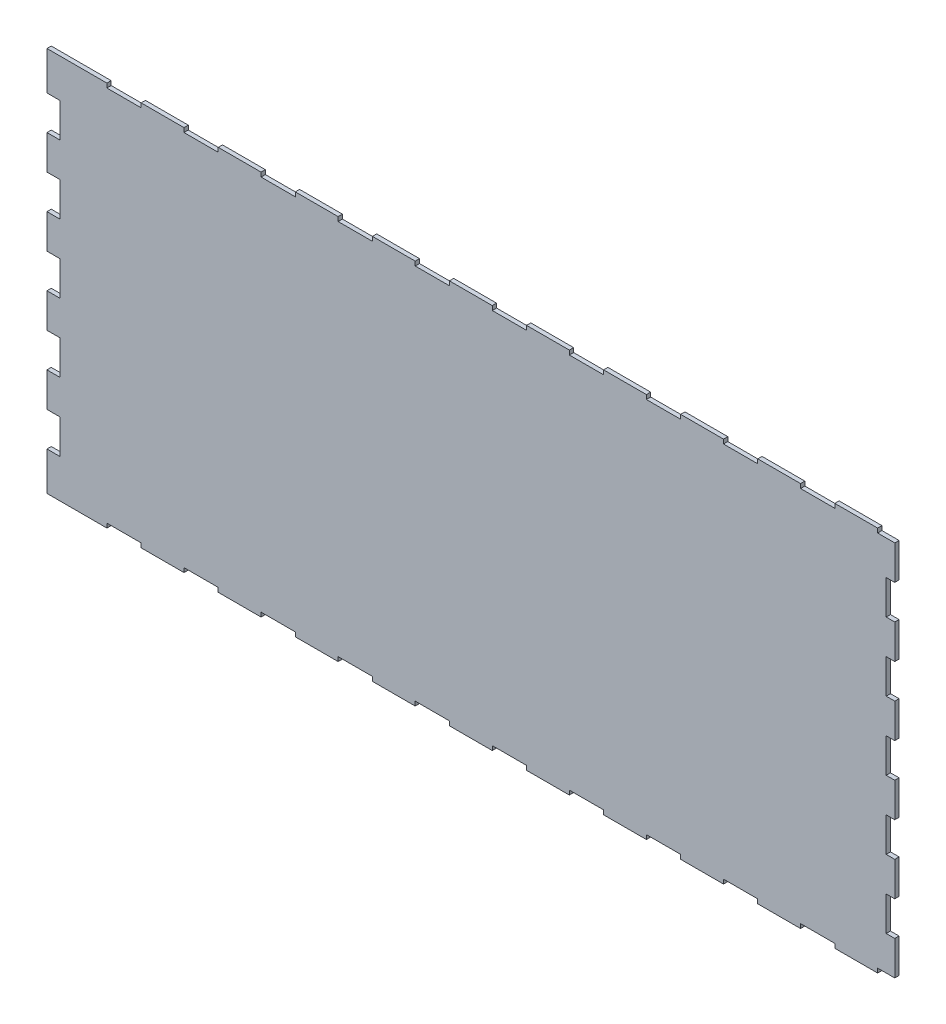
ISO-10303-21;
HEADER;
FILE_DESCRIPTION(('STEP AP214'),'2;1');
FILE_NAME('part.step','',(''),(''),'','','');
FILE_SCHEMA(('AUTOMOTIVE_DESIGN { 1 0 10303 214 1 1 1 1 }'));
ENDSEC;
DATA;
#1=APPLICATION_CONTEXT('core data for automotive mechanical design processes');
#2=APPLICATION_PROTOCOL_DEFINITION('international standard','automotive_design',2000,#1);
#3=PRODUCT_CONTEXT('',#1,'mechanical');
#4=PRODUCT('Part','Part','',(#3));
#5=PRODUCT_RELATED_PRODUCT_CATEGORY('part','',(#4));
#6=PRODUCT_DEFINITION_FORMATION('','',#4);
#7=PRODUCT_DEFINITION_CONTEXT('part definition',#1,'design');
#8=PRODUCT_DEFINITION('design','',#6,#7);
#9=PRODUCT_DEFINITION_SHAPE('','',#8);
#10=(LENGTH_UNIT() NAMED_UNIT(*) SI_UNIT(.MILLI.,.METRE.));
#11=(NAMED_UNIT(*) PLANE_ANGLE_UNIT() SI_UNIT($,.RADIAN.));
#12=(NAMED_UNIT(*) SI_UNIT($,.STERADIAN.) SOLID_ANGLE_UNIT());
#13=UNCERTAINTY_MEASURE_WITH_UNIT(LENGTH_MEASURE(1.E-05),#10,'distance_accuracy_value','');
#14=(GEOMETRIC_REPRESENTATION_CONTEXT(3) GLOBAL_UNCERTAINTY_ASSIGNED_CONTEXT((#13)) GLOBAL_UNIT_ASSIGNED_CONTEXT((#10,
#11,#12)) REPRESENTATION_CONTEXT('',''));
#15=CARTESIAN_POINT('',(0.,0.,0.));
#16=DIRECTION('',(0.,0.,1.));
#17=DIRECTION('',(1.,0.,0.));
#18=AXIS2_PLACEMENT_3D('',#15,#16,#17);
#19=CARTESIAN_POINT('',(110.,220.,5.));
#20=DIRECTION('',(0.,-1.,0.));
#21=DIRECTION('',(0.,0.,-1.));
#22=AXIS2_PLACEMENT_3D('',#19,#20,#21);
#23=PLANE('',#22);
#24=DIRECTION('',(-1.,0.,0.));
#25=VECTOR('',#24,1.);
#26=CARTESIAN_POINT('',(110.,220.,5.));
#27=LINE('',#26,#25);
#28=CARTESIAN_POINT('',(90.,220.,5.));
#29=VERTEX_POINT('',#28);
#30=CARTESIAN_POINT('',(70.,220.,5.));
#31=VERTEX_POINT('',#30);
#32=EDGE_CURVE('E399',#29,#31,#27,.T.);
#33=ORIENTED_EDGE('',*,*,#32,.F.);
#34=DIRECTION('',(0.,0.,1.));
#35=VECTOR('',#34,1.);
#36=CARTESIAN_POINT('',(90.,220.,0.));
#37=LINE('',#36,#35);
#38=CARTESIAN_POINT('',(90.,220.,0.));
#39=VERTEX_POINT('',#38);
#40=EDGE_CURVE('E1703',#39,#29,#37,.T.);
#41=ORIENTED_EDGE('',*,*,#40,.F.);
#42=DIRECTION('',(-1.,0.,0.));
#43=VECTOR('',#42,1.);
#44=CARTESIAN_POINT('',(110.,220.,0.));
#45=LINE('',#44,#43);
#46=CARTESIAN_POINT('',(70.,220.,0.));
#47=VERTEX_POINT('',#46);
#48=EDGE_CURVE('E741',#39,#47,#45,.T.);
#49=ORIENTED_EDGE('',*,*,#48,.T.);
#50=DIRECTION('',(0.,0.,-1.));
#51=VECTOR('',#50,1.);
#52=CARTESIAN_POINT('',(70.,220.,5.));
#53=LINE('',#52,#51);
#54=EDGE_CURVE('E11',#31,#47,#53,.T.);
#55=ORIENTED_EDGE('',*,*,#54,.F.);
#56=EDGE_LOOP('',(#33,#41,#49,#55));
#57=FACE_BOUND('',#56,.T.);
#58=ADVANCED_FACE('F41',(#57),#23,.F.);
#59=CARTESIAN_POINT('',(70.,225.,5.));
#60=DIRECTION('',(-1.,0.,0.));
#61=DIRECTION('',(0.,0.,1.));
#62=AXIS2_PLACEMENT_3D('',#59,#60,#61);
#63=PLANE('',#62);
#64=DIRECTION('',(0.,1.,0.));
#65=VECTOR('',#64,1.);
#66=CARTESIAN_POINT('',(70.,225.,0.));
#67=LINE('',#66,#65);
#68=CARTESIAN_POINT('',(70.,225.,0.));
#69=VERTEX_POINT('',#68);
#70=EDGE_CURVE('E743',#47,#69,#67,.T.);
#71=ORIENTED_EDGE('',*,*,#70,.T.);
#72=DIRECTION('',(0.,0.,-1.));
#73=VECTOR('',#72,1.);
#74=CARTESIAN_POINT('',(70.,225.,5.));
#75=LINE('',#74,#73);
#76=CARTESIAN_POINT('',(70.,225.,5.));
#77=VERTEX_POINT('',#76);
#78=EDGE_CURVE('E48',#77,#69,#75,.T.);
#79=ORIENTED_EDGE('',*,*,#78,.F.);
#80=DIRECTION('',(0.,1.,0.));
#81=VECTOR('',#80,1.);
#82=CARTESIAN_POINT('',(70.,225.,5.));
#83=LINE('',#82,#81);
#84=EDGE_CURVE('E1799',#31,#77,#83,.T.);
#85=ORIENTED_EDGE('',*,*,#84,.F.);
#86=ORIENTED_EDGE('',*,*,#54,.T.);
#87=EDGE_LOOP('',(#71,#79,#85,#86));
#88=FACE_BOUND('',#87,.T.);
#89=ADVANCED_FACE('F1800',(#88),#63,.F.);
#90=CARTESIAN_POINT('',(70.,225.,5.));
#91=DIRECTION('',(0.,-1.,0.));
#92=DIRECTION('',(0.,0.,-1.));
#93=AXIS2_PLACEMENT_3D('',#90,#91,#92);
#94=PLANE('',#93);
#95=DIRECTION('',(-1.,0.,0.));
#96=VECTOR('',#95,1.);
#97=CARTESIAN_POINT('',(70.,225.,0.));
#98=LINE('',#97,#96);
#99=CARTESIAN_POINT('',(20.,225.,0.));
#100=VERTEX_POINT('',#99);
#101=EDGE_CURVE('E746',#69,#100,#98,.T.);
#102=ORIENTED_EDGE('',*,*,#101,.T.);
#103=DIRECTION('',(0.,0.,-1.));
#104=VECTOR('',#103,1.);
#105=CARTESIAN_POINT('',(20.,225.,5.));
#106=LINE('',#105,#104);
#107=CARTESIAN_POINT('',(20.,225.,5.));
#108=VERTEX_POINT('',#107);
#109=EDGE_CURVE('E1255',#108,#100,#106,.T.);
#110=ORIENTED_EDGE('',*,*,#109,.F.);
#111=DIRECTION('',(-1.,0.,0.));
#112=VECTOR('',#111,1.);
#113=CARTESIAN_POINT('',(70.,225.,5.));
#114=LINE('',#113,#112);
#115=EDGE_CURVE('E1264',#77,#108,#114,.T.);
#116=ORIENTED_EDGE('',*,*,#115,.F.);
#117=ORIENTED_EDGE('',*,*,#78,.T.);
#118=EDGE_LOOP('',(#102,#110,#116,#117));
#119=FACE_BOUND('',#118,.T.);
#120=ADVANCED_FACE('F1262',(#119),#94,.F.);
#121=CARTESIAN_POINT('',(20.,225.,5.));
#122=DIRECTION('',(1.,0.,0.));
#123=DIRECTION('',(0.,0.,-1.));
#124=AXIS2_PLACEMENT_3D('',#121,#122,#123);
#125=PLANE('',#124);
#126=DIRECTION('',(0.,-1.,0.));
#127=VECTOR('',#126,1.);
#128=CARTESIAN_POINT('',(20.,225.,0.));
#129=LINE('',#128,#127);
#130=CARTESIAN_POINT('',(20.,220.,0.));
#131=VERTEX_POINT('',#130);
#132=EDGE_CURVE('E748',#100,#131,#129,.T.);
#133=ORIENTED_EDGE('',*,*,#132,.T.);
#134=DIRECTION('',(0.,0.,-1.));
#135=VECTOR('',#134,1.);
#136=CARTESIAN_POINT('',(20.,220.,5.));
#137=LINE('',#136,#135);
#138=CARTESIAN_POINT('',(20.,220.,5.));
#139=VERTEX_POINT('',#138);
#140=EDGE_CURVE('E1252',#139,#131,#137,.T.);
#141=ORIENTED_EDGE('',*,*,#140,.F.);
#142=DIRECTION('',(0.,-1.,0.));
#143=VECTOR('',#142,1.);
#144=CARTESIAN_POINT('',(20.,225.,5.));
#145=LINE('',#144,#143);
#146=EDGE_CURVE('E1286',#108,#139,#145,.T.);
#147=ORIENTED_EDGE('',*,*,#146,.F.);
#148=ORIENTED_EDGE('',*,*,#109,.T.);
#149=EDGE_LOOP('',(#133,#141,#147,#148));
#150=FACE_BOUND('',#149,.T.);
#151=ADVANCED_FACE('F1277',(#150),#125,.F.);
#152=CARTESIAN_POINT('',(20.,220.,5.));
#153=DIRECTION('',(0.,-1.,0.));
#154=DIRECTION('',(0.,0.,-1.));
#155=AXIS2_PLACEMENT_3D('',#152,#153,#154);
#156=PLANE('',#155);
#157=DIRECTION('',(-1.,0.,0.));
#158=VECTOR('',#157,1.);
#159=CARTESIAN_POINT('',(20.,220.,0.));
#160=LINE('',#159,#158);
#161=CARTESIAN_POINT('',(-20.,220.,0.));
#162=VERTEX_POINT('',#161);
#163=EDGE_CURVE('E750',#131,#162,#160,.T.);
#164=ORIENTED_EDGE('',*,*,#163,.T.);
#165=DIRECTION('',(0.,0.,-1.));
#166=VECTOR('',#165,1.);
#167=CARTESIAN_POINT('',(-20.,220.,5.));
#168=LINE('',#167,#166);
#169=CARTESIAN_POINT('',(-20.,220.,5.));
#170=VERTEX_POINT('',#169);
#171=EDGE_CURVE('E1249',#170,#162,#168,.T.);
#172=ORIENTED_EDGE('',*,*,#171,.F.);
#173=DIRECTION('',(-1.,0.,0.));
#174=VECTOR('',#173,1.);
#175=CARTESIAN_POINT('',(20.,220.,5.));
#176=LINE('',#175,#174);
#177=EDGE_CURVE('E1283',#139,#170,#176,.T.);
#178=ORIENTED_EDGE('',*,*,#177,.F.);
#179=ORIENTED_EDGE('',*,*,#140,.T.);
#180=EDGE_LOOP('',(#164,#172,#178,#179));
#181=FACE_BOUND('',#180,.T.);
#182=ADVANCED_FACE('F1281',(#181),#156,.F.);
#183=CARTESIAN_POINT('',(-20.,225.,5.));
#184=DIRECTION('',(-1.,0.,0.));
#185=DIRECTION('',(0.,0.,1.));
#186=AXIS2_PLACEMENT_3D('',#183,#184,#185);
#187=PLANE('',#186);
#188=DIRECTION('',(0.,1.,0.));
#189=VECTOR('',#188,1.);
#190=CARTESIAN_POINT('',(-20.,225.,0.));
#191=LINE('',#190,#189);
#192=CARTESIAN_POINT('',(-20.,225.,0.));
#193=VERTEX_POINT('',#192);
#194=EDGE_CURVE('E752',#162,#193,#191,.T.);
#195=ORIENTED_EDGE('',*,*,#194,.T.);
#196=DIRECTION('',(0.,0.,-1.));
#197=VECTOR('',#196,1.);
#198=CARTESIAN_POINT('',(-20.,225.,5.));
#199=LINE('',#198,#197);
#200=CARTESIAN_POINT('',(-20.,225.,5.));
#201=VERTEX_POINT('',#200);
#202=EDGE_CURVE('E1246',#201,#193,#199,.T.);
#203=ORIENTED_EDGE('',*,*,#202,.F.);
#204=DIRECTION('',(0.,1.,0.));
#205=VECTOR('',#204,1.);
#206=CARTESIAN_POINT('',(-20.,225.,5.));
#207=LINE('',#206,#205);
#208=EDGE_CURVE('E1285',#170,#201,#207,.T.);
#209=ORIENTED_EDGE('',*,*,#208,.F.);
#210=ORIENTED_EDGE('',*,*,#171,.T.);
#211=EDGE_LOOP('',(#195,#203,#209,#210));
#212=FACE_BOUND('',#211,.T.);
#213=ADVANCED_FACE('F1896',(#212),#187,.F.);
#214=CARTESIAN_POINT('',(-20.,225.,5.));
#215=DIRECTION('',(0.,-1.,0.));
#216=DIRECTION('',(0.,0.,-1.));
#217=AXIS2_PLACEMENT_3D('',#214,#215,#216);
#218=PLANE('',#217);
#219=DIRECTION('',(-1.,0.,0.));
#220=VECTOR('',#219,1.);
#221=CARTESIAN_POINT('',(-20.,225.,0.));
#222=LINE('',#221,#220);
#223=CARTESIAN_POINT('',(-70.,225.,0.));
#224=VERTEX_POINT('',#223);
#225=EDGE_CURVE('E754',#193,#224,#222,.T.);
#226=ORIENTED_EDGE('',*,*,#225,.T.);
#227=DIRECTION('',(0.,0.,-1.));
#228=VECTOR('',#227,1.);
#229=CARTESIAN_POINT('',(-70.,225.,5.));
#230=LINE('',#229,#228);
#231=CARTESIAN_POINT('',(-70.,225.,5.));
#232=VERTEX_POINT('',#231);
#233=EDGE_CURVE('E1243',#232,#224,#230,.T.);
#234=ORIENTED_EDGE('',*,*,#233,.F.);
#235=DIRECTION('',(-1.,0.,0.));
#236=VECTOR('',#235,1.);
#237=CARTESIAN_POINT('',(-20.,225.,5.));
#238=LINE('',#237,#236);
#239=EDGE_CURVE('E1288',#201,#232,#238,.T.);
#240=ORIENTED_EDGE('',*,*,#239,.F.);
#241=ORIENTED_EDGE('',*,*,#202,.T.);
#242=EDGE_LOOP('',(#226,#234,#240,#241));
#243=FACE_BOUND('',#242,.T.);
#244=ADVANCED_FACE('F1899',(#243),#218,.F.);
#245=CARTESIAN_POINT('',(-70.,225.,5.));
#246=DIRECTION('',(1.,0.,0.));
#247=DIRECTION('',(0.,0.,-1.));
#248=AXIS2_PLACEMENT_3D('',#245,#246,#247);
#249=PLANE('',#248);
#250=DIRECTION('',(0.,-1.,0.));
#251=VECTOR('',#250,1.);
#252=CARTESIAN_POINT('',(-70.,225.,0.));
#253=LINE('',#252,#251);
#254=CARTESIAN_POINT('',(-70.,220.,0.));
#255=VERTEX_POINT('',#254);
#256=EDGE_CURVE('E756',#224,#255,#253,.T.);
#257=ORIENTED_EDGE('',*,*,#256,.T.);
#258=DIRECTION('',(0.,0.,-1.));
#259=VECTOR('',#258,1.);
#260=CARTESIAN_POINT('',(-70.,220.,5.));
#261=LINE('',#260,#259);
#262=CARTESIAN_POINT('',(-70.,220.,5.));
#263=VERTEX_POINT('',#262);
#264=EDGE_CURVE('E1240',#263,#255,#261,.T.);
#265=ORIENTED_EDGE('',*,*,#264,.F.);
#266=DIRECTION('',(0.,-1.,0.));
#267=VECTOR('',#266,1.);
#268=CARTESIAN_POINT('',(-70.,225.,5.));
#269=LINE('',#268,#267);
#270=EDGE_CURVE('E1294',#232,#263,#269,.T.);
#271=ORIENTED_EDGE('',*,*,#270,.F.);
#272=ORIENTED_EDGE('',*,*,#233,.T.);
#273=EDGE_LOOP('',(#257,#265,#271,#272));
#274=FACE_BOUND('',#273,.T.);
#275=ADVANCED_FACE('F1903',(#274),#249,.F.);
#276=CARTESIAN_POINT('',(-70.,220.,5.));
#277=DIRECTION('',(0.,-1.,0.));
#278=DIRECTION('',(0.,0.,-1.));
#279=AXIS2_PLACEMENT_3D('',#276,#277,#278);
#280=PLANE('',#279);
#281=DIRECTION('',(-1.,0.,0.));
#282=VECTOR('',#281,1.);
#283=CARTESIAN_POINT('',(-70.,220.,0.));
#284=LINE('',#283,#282);
#285=CARTESIAN_POINT('',(-110.,220.,0.));
#286=VERTEX_POINT('',#285);
#287=EDGE_CURVE('E758',#255,#286,#284,.T.);
#288=ORIENTED_EDGE('',*,*,#287,.T.);
#289=DIRECTION('',(0.,0.,-1.));
#290=VECTOR('',#289,1.);
#291=CARTESIAN_POINT('',(-110.,220.,5.));
#292=LINE('',#291,#290);
#293=CARTESIAN_POINT('',(-110.,220.,5.));
#294=VERTEX_POINT('',#293);
#295=EDGE_CURVE('E1237',#294,#286,#292,.T.);
#296=ORIENTED_EDGE('',*,*,#295,.F.);
#297=DIRECTION('',(-1.,0.,0.));
#298=VECTOR('',#297,1.);
#299=CARTESIAN_POINT('',(-70.,220.,5.));
#300=LINE('',#299,#298);
#301=EDGE_CURVE('E1296',#263,#294,#300,.T.);
#302=ORIENTED_EDGE('',*,*,#301,.F.);
#303=ORIENTED_EDGE('',*,*,#264,.T.);
#304=EDGE_LOOP('',(#288,#296,#302,#303));
#305=FACE_BOUND('',#304,.T.);
#306=ADVANCED_FACE('F1907',(#305),#280,.F.);
#307=CARTESIAN_POINT('',(-110.,225.,5.));
#308=DIRECTION('',(-1.,0.,0.));
#309=DIRECTION('',(0.,0.,1.));
#310=AXIS2_PLACEMENT_3D('',#307,#308,#309);
#311=PLANE('',#310);
#312=DIRECTION('',(0.,1.,0.));
#313=VECTOR('',#312,1.);
#314=CARTESIAN_POINT('',(-110.,225.,0.));
#315=LINE('',#314,#313);
#316=CARTESIAN_POINT('',(-110.,225.,0.));
#317=VERTEX_POINT('',#316);
#318=EDGE_CURVE('E760',#286,#317,#315,.T.);
#319=ORIENTED_EDGE('',*,*,#318,.T.);
#320=DIRECTION('',(0.,0.,-1.));
#321=VECTOR('',#320,1.);
#322=CARTESIAN_POINT('',(-110.,225.,5.));
#323=LINE('',#322,#321);
#324=CARTESIAN_POINT('',(-110.,225.,5.));
#325=VERTEX_POINT('',#324);
#326=EDGE_CURVE('E1234',#325,#317,#323,.T.);
#327=ORIENTED_EDGE('',*,*,#326,.F.);
#328=DIRECTION('',(0.,1.,0.));
#329=VECTOR('',#328,1.);
#330=CARTESIAN_POINT('',(-110.,225.,5.));
#331=LINE('',#330,#329);
#332=EDGE_CURVE('E1298',#294,#325,#331,.T.);
#333=ORIENTED_EDGE('',*,*,#332,.F.);
#334=ORIENTED_EDGE('',*,*,#295,.T.);
#335=EDGE_LOOP('',(#319,#327,#333,#334));
#336=FACE_BOUND('',#335,.T.);
#337=ADVANCED_FACE('F1911',(#336),#311,.F.);
#338=CARTESIAN_POINT('',(-110.,225.,5.));
#339=DIRECTION('',(0.,-1.,0.));
#340=DIRECTION('',(0.,0.,-1.));
#341=AXIS2_PLACEMENT_3D('',#338,#339,#340);
#342=PLANE('',#341);
#343=DIRECTION('',(-1.,0.,0.));
#344=VECTOR('',#343,1.);
#345=CARTESIAN_POINT('',(-110.,225.,0.));
#346=LINE('',#345,#344);
#347=CARTESIAN_POINT('',(-160.,225.,0.));
#348=VERTEX_POINT('',#347);
#349=EDGE_CURVE('E762',#317,#348,#346,.T.);
#350=ORIENTED_EDGE('',*,*,#349,.T.);
#351=DIRECTION('',(0.,0.,-1.));
#352=VECTOR('',#351,1.);
#353=CARTESIAN_POINT('',(-160.,225.,5.));
#354=LINE('',#353,#352);
#355=CARTESIAN_POINT('',(-160.,225.,5.));
#356=VERTEX_POINT('',#355);
#357=EDGE_CURVE('E1231',#356,#348,#354,.T.);
#358=ORIENTED_EDGE('',*,*,#357,.F.);
#359=DIRECTION('',(-1.,0.,0.));
#360=VECTOR('',#359,1.);
#361=CARTESIAN_POINT('',(-110.,225.,5.));
#362=LINE('',#361,#360);
#363=EDGE_CURVE('E1300',#325,#356,#362,.T.);
#364=ORIENTED_EDGE('',*,*,#363,.F.);
#365=ORIENTED_EDGE('',*,*,#326,.T.);
#366=EDGE_LOOP('',(#350,#358,#364,#365));
#367=FACE_BOUND('',#366,.T.);
#368=ADVANCED_FACE('F1915',(#367),#342,.F.);
#369=CARTESIAN_POINT('',(-160.,225.,5.));
#370=DIRECTION('',(1.,0.,0.));
#371=DIRECTION('',(0.,0.,-1.));
#372=AXIS2_PLACEMENT_3D('',#369,#370,#371);
#373=PLANE('',#372);
#374=DIRECTION('',(0.,-1.,0.));
#375=VECTOR('',#374,1.);
#376=CARTESIAN_POINT('',(-160.,225.,0.));
#377=LINE('',#376,#375);
#378=CARTESIAN_POINT('',(-160.,220.,0.));
#379=VERTEX_POINT('',#378);
#380=EDGE_CURVE('E764',#348,#379,#377,.T.);
#381=ORIENTED_EDGE('',*,*,#380,.T.);
#382=DIRECTION('',(0.,0.,-1.));
#383=VECTOR('',#382,1.);
#384=CARTESIAN_POINT('',(-160.,220.,5.));
#385=LINE('',#384,#383);
#386=CARTESIAN_POINT('',(-160.,220.,5.));
#387=VERTEX_POINT('',#386);
#388=EDGE_CURVE('E1228',#387,#379,#385,.T.);
#389=ORIENTED_EDGE('',*,*,#388,.F.);
#390=DIRECTION('',(0.,-1.,0.));
#391=VECTOR('',#390,1.);
#392=CARTESIAN_POINT('',(-160.,225.,5.));
#393=LINE('',#392,#391);
#394=EDGE_CURVE('E1302',#356,#387,#393,.T.);
#395=ORIENTED_EDGE('',*,*,#394,.F.);
#396=ORIENTED_EDGE('',*,*,#357,.T.);
#397=EDGE_LOOP('',(#381,#389,#395,#396));
#398=FACE_BOUND('',#397,.T.);
#399=ADVANCED_FACE('F1919',(#398),#373,.F.);
#400=CARTESIAN_POINT('',(-160.,220.,5.));
#401=DIRECTION('',(0.,-1.,0.));
#402=DIRECTION('',(0.,0.,-1.));
#403=AXIS2_PLACEMENT_3D('',#400,#401,#402);
#404=PLANE('',#403);
#405=DIRECTION('',(-1.,0.,0.));
#406=VECTOR('',#405,1.);
#407=CARTESIAN_POINT('',(-160.,220.,0.));
#408=LINE('',#407,#406);
#409=CARTESIAN_POINT('',(-200.,220.,0.));
#410=VERTEX_POINT('',#409);
#411=EDGE_CURVE('E766',#379,#410,#408,.T.);
#412=ORIENTED_EDGE('',*,*,#411,.T.);
#413=DIRECTION('',(0.,0.,-1.));
#414=VECTOR('',#413,1.);
#415=CARTESIAN_POINT('',(-200.,220.,5.));
#416=LINE('',#415,#414);
#417=CARTESIAN_POINT('',(-200.,220.,5.));
#418=VERTEX_POINT('',#417);
#419=EDGE_CURVE('E1225',#418,#410,#416,.T.);
#420=ORIENTED_EDGE('',*,*,#419,.F.);
#421=DIRECTION('',(-1.,0.,0.));
#422=VECTOR('',#421,1.);
#423=CARTESIAN_POINT('',(-160.,220.,5.));
#424=LINE('',#423,#422);
#425=EDGE_CURVE('E1304',#387,#418,#424,.T.);
#426=ORIENTED_EDGE('',*,*,#425,.F.);
#427=ORIENTED_EDGE('',*,*,#388,.T.);
#428=EDGE_LOOP('',(#412,#420,#426,#427));
#429=FACE_BOUND('',#428,.T.);
#430=ADVANCED_FACE('F1923',(#429),#404,.F.);
#431=CARTESIAN_POINT('',(-200.,225.,5.));
#432=DIRECTION('',(-1.,0.,0.));
#433=DIRECTION('',(0.,0.,1.));
#434=AXIS2_PLACEMENT_3D('',#431,#432,#433);
#435=PLANE('',#434);
#436=DIRECTION('',(0.,1.,0.));
#437=VECTOR('',#436,1.);
#438=CARTESIAN_POINT('',(-200.,225.,0.));
#439=LINE('',#438,#437);
#440=CARTESIAN_POINT('',(-200.,225.,0.));
#441=VERTEX_POINT('',#440);
#442=EDGE_CURVE('E768',#410,#441,#439,.T.);
#443=ORIENTED_EDGE('',*,*,#442,.T.);
#444=DIRECTION('',(0.,0.,-1.));
#445=VECTOR('',#444,1.);
#446=CARTESIAN_POINT('',(-200.,225.,5.));
#447=LINE('',#446,#445);
#448=CARTESIAN_POINT('',(-200.,225.,5.));
#449=VERTEX_POINT('',#448);
#450=EDGE_CURVE('E1222',#449,#441,#447,.T.);
#451=ORIENTED_EDGE('',*,*,#450,.F.);
#452=DIRECTION('',(0.,1.,0.));
#453=VECTOR('',#452,1.);
#454=CARTESIAN_POINT('',(-200.,225.,5.));
#455=LINE('',#454,#453);
#456=EDGE_CURVE('E1306',#418,#449,#455,.T.);
#457=ORIENTED_EDGE('',*,*,#456,.F.);
#458=ORIENTED_EDGE('',*,*,#419,.T.);
#459=EDGE_LOOP('',(#443,#451,#457,#458));
#460=FACE_BOUND('',#459,.T.);
#461=ADVANCED_FACE('F1927',(#460),#435,.F.);
#462=CARTESIAN_POINT('',(-200.,225.,5.));
#463=DIRECTION('',(0.,-1.,0.));
#464=DIRECTION('',(0.,0.,-1.));
#465=AXIS2_PLACEMENT_3D('',#462,#463,#464);
#466=PLANE('',#465);
#467=DIRECTION('',(-1.,0.,0.));
#468=VECTOR('',#467,1.);
#469=CARTESIAN_POINT('',(-200.,225.,0.));
#470=LINE('',#469,#468);
#471=CARTESIAN_POINT('',(-250.,225.,0.));
#472=VERTEX_POINT('',#471);
#473=EDGE_CURVE('E770',#441,#472,#470,.T.);
#474=ORIENTED_EDGE('',*,*,#473,.T.);
#475=DIRECTION('',(0.,0.,-1.));
#476=VECTOR('',#475,1.);
#477=CARTESIAN_POINT('',(-250.,225.,5.));
#478=LINE('',#477,#476);
#479=CARTESIAN_POINT('',(-250.,225.,5.));
#480=VERTEX_POINT('',#479);
#481=EDGE_CURVE('E1219',#480,#472,#478,.T.);
#482=ORIENTED_EDGE('',*,*,#481,.F.);
#483=DIRECTION('',(-1.,0.,0.));
#484=VECTOR('',#483,1.);
#485=CARTESIAN_POINT('',(-200.,225.,5.));
#486=LINE('',#485,#484);
#487=EDGE_CURVE('E1308',#449,#480,#486,.T.);
#488=ORIENTED_EDGE('',*,*,#487,.F.);
#489=ORIENTED_EDGE('',*,*,#450,.T.);
#490=EDGE_LOOP('',(#474,#482,#488,#489));
#491=FACE_BOUND('',#490,.T.);
#492=ADVANCED_FACE('F1931',(#491),#466,.F.);
#493=CARTESIAN_POINT('',(-250.,225.,5.));
#494=DIRECTION('',(1.,0.,0.));
#495=DIRECTION('',(0.,0.,-1.));
#496=AXIS2_PLACEMENT_3D('',#493,#494,#495);
#497=PLANE('',#496);
#498=DIRECTION('',(0.,-1.,0.));
#499=VECTOR('',#498,1.);
#500=CARTESIAN_POINT('',(-250.,225.,0.));
#501=LINE('',#500,#499);
#502=CARTESIAN_POINT('',(-250.,220.,0.));
#503=VERTEX_POINT('',#502);
#504=EDGE_CURVE('E772',#472,#503,#501,.T.);
#505=ORIENTED_EDGE('',*,*,#504,.T.);
#506=DIRECTION('',(0.,0.,-1.));
#507=VECTOR('',#506,1.);
#508=CARTESIAN_POINT('',(-250.,220.,5.));
#509=LINE('',#508,#507);
#510=CARTESIAN_POINT('',(-250.,220.,5.));
#511=VERTEX_POINT('',#510);
#512=EDGE_CURVE('E1216',#511,#503,#509,.T.);
#513=ORIENTED_EDGE('',*,*,#512,.F.);
#514=DIRECTION('',(0.,-1.,0.));
#515=VECTOR('',#514,1.);
#516=CARTESIAN_POINT('',(-250.,225.,5.));
#517=LINE('',#516,#515);
#518=EDGE_CURVE('E1310',#480,#511,#517,.T.);
#519=ORIENTED_EDGE('',*,*,#518,.F.);
#520=ORIENTED_EDGE('',*,*,#481,.T.);
#521=EDGE_LOOP('',(#505,#513,#519,#520));
#522=FACE_BOUND('',#521,.T.);
#523=ADVANCED_FACE('F1935',(#522),#497,.F.);
#524=CARTESIAN_POINT('',(-250.,220.,5.));
#525=DIRECTION('',(0.,-1.,0.));
#526=DIRECTION('',(0.,0.,-1.));
#527=AXIS2_PLACEMENT_3D('',#524,#525,#526);
#528=PLANE('',#527);
#529=DIRECTION('',(-1.,0.,0.));
#530=VECTOR('',#529,1.);
#531=CARTESIAN_POINT('',(-250.,220.,0.));
#532=LINE('',#531,#530);
#533=CARTESIAN_POINT('',(-290.,220.,0.));
#534=VERTEX_POINT('',#533);
#535=EDGE_CURVE('E774',#503,#534,#532,.T.);
#536=ORIENTED_EDGE('',*,*,#535,.T.);
#537=DIRECTION('',(0.,0.,-1.));
#538=VECTOR('',#537,1.);
#539=CARTESIAN_POINT('',(-290.,220.,5.));
#540=LINE('',#539,#538);
#541=CARTESIAN_POINT('',(-290.,220.,5.));
#542=VERTEX_POINT('',#541);
#543=EDGE_CURVE('E1213',#542,#534,#540,.T.);
#544=ORIENTED_EDGE('',*,*,#543,.F.);
#545=DIRECTION('',(-1.,0.,0.));
#546=VECTOR('',#545,1.);
#547=CARTESIAN_POINT('',(-250.,220.,5.));
#548=LINE('',#547,#546);
#549=EDGE_CURVE('E1312',#511,#542,#548,.T.);
#550=ORIENTED_EDGE('',*,*,#549,.F.);
#551=ORIENTED_EDGE('',*,*,#512,.T.);
#552=EDGE_LOOP('',(#536,#544,#550,#551));
#553=FACE_BOUND('',#552,.T.);
#554=ADVANCED_FACE('F1939',(#553),#528,.F.);
#555=CARTESIAN_POINT('',(-290.,225.,5.));
#556=DIRECTION('',(-1.,0.,0.));
#557=DIRECTION('',(0.,0.,1.));
#558=AXIS2_PLACEMENT_3D('',#555,#556,#557);
#559=PLANE('',#558);
#560=DIRECTION('',(0.,1.,0.));
#561=VECTOR('',#560,1.);
#562=CARTESIAN_POINT('',(-290.,225.,0.));
#563=LINE('',#562,#561);
#564=CARTESIAN_POINT('',(-290.,225.,0.));
#565=VERTEX_POINT('',#564);
#566=EDGE_CURVE('E776',#534,#565,#563,.T.);
#567=ORIENTED_EDGE('',*,*,#566,.T.);
#568=DIRECTION('',(0.,0.,-1.));
#569=VECTOR('',#568,1.);
#570=CARTESIAN_POINT('',(-290.,225.,5.));
#571=LINE('',#570,#569);
#572=CARTESIAN_POINT('',(-290.,225.,5.));
#573=VERTEX_POINT('',#572);
#574=EDGE_CURVE('E1210',#573,#565,#571,.T.);
#575=ORIENTED_EDGE('',*,*,#574,.F.);
#576=DIRECTION('',(0.,1.,0.));
#577=VECTOR('',#576,1.);
#578=CARTESIAN_POINT('',(-290.,225.,5.));
#579=LINE('',#578,#577);
#580=EDGE_CURVE('E1314',#542,#573,#579,.T.);
#581=ORIENTED_EDGE('',*,*,#580,.F.);
#582=ORIENTED_EDGE('',*,*,#543,.T.);
#583=EDGE_LOOP('',(#567,#575,#581,#582));
#584=FACE_BOUND('',#583,.T.);
#585=ADVANCED_FACE('F1943',(#584),#559,.F.);
#586=CARTESIAN_POINT('',(-290.,225.,5.));
#587=DIRECTION('',(0.,-1.,0.));
#588=DIRECTION('',(0.,0.,-1.));
#589=AXIS2_PLACEMENT_3D('',#586,#587,#588);
#590=PLANE('',#589);
#591=DIRECTION('',(-1.,0.,0.));
#592=VECTOR('',#591,1.);
#593=CARTESIAN_POINT('',(-290.,225.,0.));
#594=LINE('',#593,#592);
#595=CARTESIAN_POINT('',(-340.,225.,0.));
#596=VERTEX_POINT('',#595);
#597=EDGE_CURVE('E778',#565,#596,#594,.T.);
#598=ORIENTED_EDGE('',*,*,#597,.T.);
#599=DIRECTION('',(0.,0.,-1.));
#600=VECTOR('',#599,1.);
#601=CARTESIAN_POINT('',(-340.,225.,5.));
#602=LINE('',#601,#600);
#603=CARTESIAN_POINT('',(-340.,225.,5.));
#604=VERTEX_POINT('',#603);
#605=EDGE_CURVE('E1207',#604,#596,#602,.T.);
#606=ORIENTED_EDGE('',*,*,#605,.F.);
#607=DIRECTION('',(-1.,0.,0.));
#608=VECTOR('',#607,1.);
#609=CARTESIAN_POINT('',(-290.,225.,5.));
#610=LINE('',#609,#608);
#611=EDGE_CURVE('E1316',#573,#604,#610,.T.);
#612=ORIENTED_EDGE('',*,*,#611,.F.);
#613=ORIENTED_EDGE('',*,*,#574,.T.);
#614=EDGE_LOOP('',(#598,#606,#612,#613));
#615=FACE_BOUND('',#614,.T.);
#616=ADVANCED_FACE('F1947',(#615),#590,.F.);
#617=CARTESIAN_POINT('',(-340.,225.,5.));
#618=DIRECTION('',(1.,0.,0.));
#619=DIRECTION('',(0.,0.,-1.));
#620=AXIS2_PLACEMENT_3D('',#617,#618,#619);
#621=PLANE('',#620);
#622=DIRECTION('',(0.,-1.,0.));
#623=VECTOR('',#622,1.);
#624=CARTESIAN_POINT('',(-340.,225.,0.));
#625=LINE('',#624,#623);
#626=CARTESIAN_POINT('',(-340.,220.,0.));
#627=VERTEX_POINT('',#626);
#628=EDGE_CURVE('E780',#596,#627,#625,.T.);
#629=ORIENTED_EDGE('',*,*,#628,.T.);
#630=DIRECTION('',(0.,0.,-1.));
#631=VECTOR('',#630,1.);
#632=CARTESIAN_POINT('',(-340.,220.,5.));
#633=LINE('',#632,#631);
#634=CARTESIAN_POINT('',(-340.,220.,5.));
#635=VERTEX_POINT('',#634);
#636=EDGE_CURVE('E1204',#635,#627,#633,.T.);
#637=ORIENTED_EDGE('',*,*,#636,.F.);
#638=DIRECTION('',(0.,-1.,0.));
#639=VECTOR('',#638,1.);
#640=CARTESIAN_POINT('',(-340.,225.,5.));
#641=LINE('',#640,#639);
#642=EDGE_CURVE('E1318',#604,#635,#641,.T.);
#643=ORIENTED_EDGE('',*,*,#642,.F.);
#644=ORIENTED_EDGE('',*,*,#605,.T.);
#645=EDGE_LOOP('',(#629,#637,#643,#644));
#646=FACE_BOUND('',#645,.T.);
#647=ADVANCED_FACE('F1951',(#646),#621,.F.);
#648=CARTESIAN_POINT('',(-340.,220.,5.));
#649=DIRECTION('',(0.,-1.,0.));
#650=DIRECTION('',(0.,0.,-1.));
#651=AXIS2_PLACEMENT_3D('',#648,#649,#650);
#652=PLANE('',#651);
#653=DIRECTION('',(-1.,0.,0.));
#654=VECTOR('',#653,1.);
#655=CARTESIAN_POINT('',(-340.,220.,0.));
#656=LINE('',#655,#654);
#657=CARTESIAN_POINT('',(-380.,220.,0.));
#658=VERTEX_POINT('',#657);
#659=EDGE_CURVE('E782',#627,#658,#656,.T.);
#660=ORIENTED_EDGE('',*,*,#659,.T.);
#661=DIRECTION('',(0.,0.,-1.));
#662=VECTOR('',#661,1.);
#663=CARTESIAN_POINT('',(-380.,220.,5.));
#664=LINE('',#663,#662);
#665=CARTESIAN_POINT('',(-380.,220.,5.));
#666=VERTEX_POINT('',#665);
#667=EDGE_CURVE('E1201',#666,#658,#664,.T.);
#668=ORIENTED_EDGE('',*,*,#667,.F.);
#669=DIRECTION('',(-1.,0.,0.));
#670=VECTOR('',#669,1.);
#671=CARTESIAN_POINT('',(-340.,220.,5.));
#672=LINE('',#671,#670);
#673=EDGE_CURVE('E1320',#635,#666,#672,.T.);
#674=ORIENTED_EDGE('',*,*,#673,.F.);
#675=ORIENTED_EDGE('',*,*,#636,.T.);
#676=EDGE_LOOP('',(#660,#668,#674,#675));
#677=FACE_BOUND('',#676,.T.);
#678=ADVANCED_FACE('F1955',(#677),#652,.F.);
#679=CARTESIAN_POINT('',(-380.,225.,5.));
#680=DIRECTION('',(-1.,0.,0.));
#681=DIRECTION('',(0.,0.,1.));
#682=AXIS2_PLACEMENT_3D('',#679,#680,#681);
#683=PLANE('',#682);
#684=DIRECTION('',(0.,1.,0.));
#685=VECTOR('',#684,1.);
#686=CARTESIAN_POINT('',(-380.,225.,0.));
#687=LINE('',#686,#685);
#688=CARTESIAN_POINT('',(-380.,225.,0.));
#689=VERTEX_POINT('',#688);
#690=EDGE_CURVE('E784',#658,#689,#687,.T.);
#691=ORIENTED_EDGE('',*,*,#690,.T.);
#692=DIRECTION('',(0.,0.,-1.));
#693=VECTOR('',#692,1.);
#694=CARTESIAN_POINT('',(-380.,225.,5.));
#695=LINE('',#694,#693);
#696=CARTESIAN_POINT('',(-380.,225.,5.));
#697=VERTEX_POINT('',#696);
#698=EDGE_CURVE('E1198',#697,#689,#695,.T.);
#699=ORIENTED_EDGE('',*,*,#698,.F.);
#700=DIRECTION('',(0.,1.,0.));
#701=VECTOR('',#700,1.);
#702=CARTESIAN_POINT('',(-380.,225.,5.));
#703=LINE('',#702,#701);
#704=EDGE_CURVE('E1322',#666,#697,#703,.T.);
#705=ORIENTED_EDGE('',*,*,#704,.F.);
#706=ORIENTED_EDGE('',*,*,#667,.T.);
#707=EDGE_LOOP('',(#691,#699,#705,#706));
#708=FACE_BOUND('',#707,.T.);
#709=ADVANCED_FACE('F1959',(#708),#683,.F.);
#710=CARTESIAN_POINT('',(-380.,225.,5.));
#711=DIRECTION('',(0.,-1.,0.));
#712=DIRECTION('',(0.,0.,-1.));
#713=AXIS2_PLACEMENT_3D('',#710,#711,#712);
#714=PLANE('',#713);
#715=DIRECTION('',(-1.,0.,0.));
#716=VECTOR('',#715,1.);
#717=CARTESIAN_POINT('',(-380.,225.,0.));
#718=LINE('',#717,#716);
#719=CARTESIAN_POINT('',(-430.,225.,0.));
#720=VERTEX_POINT('',#719);
#721=EDGE_CURVE('E786',#689,#720,#718,.T.);
#722=ORIENTED_EDGE('',*,*,#721,.T.);
#723=DIRECTION('',(0.,0.,-1.));
#724=VECTOR('',#723,1.);
#725=CARTESIAN_POINT('',(-430.,225.,5.));
#726=LINE('',#725,#724);
#727=CARTESIAN_POINT('',(-430.,225.,5.));
#728=VERTEX_POINT('',#727);
#729=EDGE_CURVE('E1195',#728,#720,#726,.T.);
#730=ORIENTED_EDGE('',*,*,#729,.F.);
#731=DIRECTION('',(-1.,0.,0.));
#732=VECTOR('',#731,1.);
#733=CARTESIAN_POINT('',(-380.,225.,5.));
#734=LINE('',#733,#732);
#735=EDGE_CURVE('E1324',#697,#728,#734,.T.);
#736=ORIENTED_EDGE('',*,*,#735,.F.);
#737=ORIENTED_EDGE('',*,*,#698,.T.);
#738=EDGE_LOOP('',(#722,#730,#736,#737));
#739=FACE_BOUND('',#738,.T.);
#740=ADVANCED_FACE('F1963',(#739),#714,.F.);
#741=CARTESIAN_POINT('',(-430.,225.,5.));
#742=DIRECTION('',(1.,0.,0.));
#743=DIRECTION('',(0.,0.,-1.));
#744=AXIS2_PLACEMENT_3D('',#741,#742,#743);
#745=PLANE('',#744);
#746=DIRECTION('',(0.,-1.,0.));
#747=VECTOR('',#746,1.);
#748=CARTESIAN_POINT('',(-430.,225.,0.));
#749=LINE('',#748,#747);
#750=CARTESIAN_POINT('',(-430.,220.,0.));
#751=VERTEX_POINT('',#750);
#752=EDGE_CURVE('E788',#720,#751,#749,.T.);
#753=ORIENTED_EDGE('',*,*,#752,.T.);
#754=DIRECTION('',(0.,0.,-1.));
#755=VECTOR('',#754,1.);
#756=CARTESIAN_POINT('',(-430.,220.,5.));
#757=LINE('',#756,#755);
#758=CARTESIAN_POINT('',(-430.,220.,5.));
#759=VERTEX_POINT('',#758);
#760=EDGE_CURVE('E1192',#759,#751,#757,.T.);
#761=ORIENTED_EDGE('',*,*,#760,.F.);
#762=DIRECTION('',(0.,-1.,0.));
#763=VECTOR('',#762,1.);
#764=CARTESIAN_POINT('',(-430.,225.,5.));
#765=LINE('',#764,#763);
#766=EDGE_CURVE('E1326',#728,#759,#765,.T.);
#767=ORIENTED_EDGE('',*,*,#766,.F.);
#768=ORIENTED_EDGE('',*,*,#729,.T.);
#769=EDGE_LOOP('',(#753,#761,#767,#768));
#770=FACE_BOUND('',#769,.T.);
#771=ADVANCED_FACE('F1967',(#770),#745,.F.);
#772=CARTESIAN_POINT('',(-430.,220.,5.));
#773=DIRECTION('',(0.,-1.,0.));
#774=DIRECTION('',(0.,0.,-1.));
#775=AXIS2_PLACEMENT_3D('',#772,#773,#774);
#776=PLANE('',#775);
#777=DIRECTION('',(-1.,0.,0.));
#778=VECTOR('',#777,1.);
#779=CARTESIAN_POINT('',(-430.,220.,0.));
#780=LINE('',#779,#778);
#781=CARTESIAN_POINT('',(-470.,220.,0.));
#782=VERTEX_POINT('',#781);
#783=EDGE_CURVE('E790',#751,#782,#780,.T.);
#784=ORIENTED_EDGE('',*,*,#783,.T.);
#785=DIRECTION('',(0.,0.,-1.));
#786=VECTOR('',#785,1.);
#787=CARTESIAN_POINT('',(-470.,220.,5.));
#788=LINE('',#787,#786);
#789=CARTESIAN_POINT('',(-470.,220.,5.));
#790=VERTEX_POINT('',#789);
#791=EDGE_CURVE('E1189',#790,#782,#788,.T.);
#792=ORIENTED_EDGE('',*,*,#791,.F.);
#793=DIRECTION('',(-1.,0.,0.));
#794=VECTOR('',#793,1.);
#795=CARTESIAN_POINT('',(-430.,220.,5.));
#796=LINE('',#795,#794);
#797=EDGE_CURVE('E1328',#759,#790,#796,.T.);
#798=ORIENTED_EDGE('',*,*,#797,.F.);
#799=ORIENTED_EDGE('',*,*,#760,.T.);
#800=EDGE_LOOP('',(#784,#792,#798,#799));
#801=FACE_BOUND('',#800,.T.);
#802=ADVANCED_FACE('F1971',(#801),#776,.F.);
#803=CARTESIAN_POINT('',(-470.,225.,5.));
#804=DIRECTION('',(-1.,0.,0.));
#805=DIRECTION('',(0.,0.,1.));
#806=AXIS2_PLACEMENT_3D('',#803,#804,#805);
#807=PLANE('',#806);
#808=DIRECTION('',(0.,1.,0.));
#809=VECTOR('',#808,1.);
#810=CARTESIAN_POINT('',(-470.,225.,0.));
#811=LINE('',#810,#809);
#812=CARTESIAN_POINT('',(-470.,225.,0.));
#813=VERTEX_POINT('',#812);
#814=EDGE_CURVE('E792',#782,#813,#811,.T.);
#815=ORIENTED_EDGE('',*,*,#814,.T.);
#816=DIRECTION('',(0.,0.,-1.));
#817=VECTOR('',#816,1.);
#818=CARTESIAN_POINT('',(-470.,225.,5.));
#819=LINE('',#818,#817);
#820=CARTESIAN_POINT('',(-470.,225.,5.));
#821=VERTEX_POINT('',#820);
#822=EDGE_CURVE('E1186',#821,#813,#819,.T.);
#823=ORIENTED_EDGE('',*,*,#822,.F.);
#824=DIRECTION('',(0.,1.,0.));
#825=VECTOR('',#824,1.);
#826=CARTESIAN_POINT('',(-470.,225.,5.));
#827=LINE('',#826,#825);
#828=EDGE_CURVE('E1330',#790,#821,#827,.T.);
#829=ORIENTED_EDGE('',*,*,#828,.F.);
#830=ORIENTED_EDGE('',*,*,#791,.T.);
#831=EDGE_LOOP('',(#815,#823,#829,#830));
#832=FACE_BOUND('',#831,.T.);
#833=ADVANCED_FACE('F1975',(#832),#807,.F.);
#834=CARTESIAN_POINT('',(-470.,225.,5.));
#835=DIRECTION('',(0.,-1.,0.));
#836=DIRECTION('',(0.,0.,-1.));
#837=AXIS2_PLACEMENT_3D('',#834,#835,#836);
#838=PLANE('',#837);
#839=DIRECTION('',(-1.,0.,0.));
#840=VECTOR('',#839,1.);
#841=CARTESIAN_POINT('',(-470.,225.,0.));
#842=LINE('',#841,#840);
#843=CARTESIAN_POINT('',(-520.,225.,0.));
#844=VERTEX_POINT('',#843);
#845=EDGE_CURVE('E794',#813,#844,#842,.T.);
#846=ORIENTED_EDGE('',*,*,#845,.T.);
#847=DIRECTION('',(0.,0.,-1.));
#848=VECTOR('',#847,1.);
#849=CARTESIAN_POINT('',(-520.,225.,5.));
#850=LINE('',#849,#848);
#851=CARTESIAN_POINT('',(-520.,225.,5.));
#852=VERTEX_POINT('',#851);
#853=EDGE_CURVE('E1183',#852,#844,#850,.T.);
#854=ORIENTED_EDGE('',*,*,#853,.F.);
#855=DIRECTION('',(-1.,0.,0.));
#856=VECTOR('',#855,1.);
#857=CARTESIAN_POINT('',(-470.,225.,5.));
#858=LINE('',#857,#856);
#859=EDGE_CURVE('E1332',#821,#852,#858,.T.);
#860=ORIENTED_EDGE('',*,*,#859,.F.);
#861=ORIENTED_EDGE('',*,*,#822,.T.);
#862=EDGE_LOOP('',(#846,#854,#860,#861));
#863=FACE_BOUND('',#862,.T.);
#864=ADVANCED_FACE('F1979',(#863),#838,.F.);
#865=CARTESIAN_POINT('',(-520.,225.,5.));
#866=DIRECTION('',(1.,0.,0.));
#867=DIRECTION('',(0.,0.,-1.));
#868=AXIS2_PLACEMENT_3D('',#865,#866,#867);
#869=PLANE('',#868);
#870=DIRECTION('',(0.,-1.,0.));
#871=VECTOR('',#870,1.);
#872=CARTESIAN_POINT('',(-520.,225.,0.));
#873=LINE('',#872,#871);
#874=CARTESIAN_POINT('',(-520.,220.,0.));
#875=VERTEX_POINT('',#874);
#876=EDGE_CURVE('E796',#844,#875,#873,.T.);
#877=ORIENTED_EDGE('',*,*,#876,.T.);
#878=DIRECTION('',(0.,0.,-1.));
#879=VECTOR('',#878,1.);
#880=CARTESIAN_POINT('',(-520.,220.,5.));
#881=LINE('',#880,#879);
#882=CARTESIAN_POINT('',(-520.,220.,5.));
#883=VERTEX_POINT('',#882);
#884=EDGE_CURVE('E1180',#883,#875,#881,.T.);
#885=ORIENTED_EDGE('',*,*,#884,.F.);
#886=DIRECTION('',(0.,-1.,0.));
#887=VECTOR('',#886,1.);
#888=CARTESIAN_POINT('',(-520.,225.,5.));
#889=LINE('',#888,#887);
#890=EDGE_CURVE('E1334',#852,#883,#889,.T.);
#891=ORIENTED_EDGE('',*,*,#890,.F.);
#892=ORIENTED_EDGE('',*,*,#853,.T.);
#893=EDGE_LOOP('',(#877,#885,#891,#892));
#894=FACE_BOUND('',#893,.T.);
#895=ADVANCED_FACE('F1983',(#894),#869,.F.);
#896=CARTESIAN_POINT('',(-520.,220.,5.));
#897=DIRECTION('',(0.,-1.,0.));
#898=DIRECTION('',(0.,0.,-1.));
#899=AXIS2_PLACEMENT_3D('',#896,#897,#898);
#900=PLANE('',#899);
#901=DIRECTION('',(-1.,0.,0.));
#902=VECTOR('',#901,1.);
#903=CARTESIAN_POINT('',(-520.,220.,0.));
#904=LINE('',#903,#902);
#905=CARTESIAN_POINT('',(-560.,220.,0.));
#906=VERTEX_POINT('',#905);
#907=EDGE_CURVE('E798',#875,#906,#904,.T.);
#908=ORIENTED_EDGE('',*,*,#907,.T.);
#909=DIRECTION('',(0.,0.,-1.));
#910=VECTOR('',#909,1.);
#911=CARTESIAN_POINT('',(-560.,220.,5.));
#912=LINE('',#911,#910);
#913=CARTESIAN_POINT('',(-560.,220.,5.));
#914=VERTEX_POINT('',#913);
#915=EDGE_CURVE('E1177',#914,#906,#912,.T.);
#916=ORIENTED_EDGE('',*,*,#915,.F.);
#917=DIRECTION('',(-1.,0.,0.));
#918=VECTOR('',#917,1.);
#919=CARTESIAN_POINT('',(-520.,220.,5.));
#920=LINE('',#919,#918);
#921=EDGE_CURVE('E1336',#883,#914,#920,.T.);
#922=ORIENTED_EDGE('',*,*,#921,.F.);
#923=ORIENTED_EDGE('',*,*,#884,.T.);
#924=EDGE_LOOP('',(#908,#916,#922,#923));
#925=FACE_BOUND('',#924,.T.);
#926=ADVANCED_FACE('F1987',(#925),#900,.F.);
#927=CARTESIAN_POINT('',(-560.,225.,5.));
#928=DIRECTION('',(-1.,0.,0.));
#929=DIRECTION('',(0.,0.,1.));
#930=AXIS2_PLACEMENT_3D('',#927,#928,#929);
#931=PLANE('',#930);
#932=DIRECTION('',(0.,1.,0.));
#933=VECTOR('',#932,1.);
#934=CARTESIAN_POINT('',(-560.,225.,0.));
#935=LINE('',#934,#933);
#936=CARTESIAN_POINT('',(-560.,225.,0.));
#937=VERTEX_POINT('',#936);
#938=EDGE_CURVE('E800',#906,#937,#935,.T.);
#939=ORIENTED_EDGE('',*,*,#938,.T.);
#940=DIRECTION('',(0.,0.,-1.));
#941=VECTOR('',#940,1.);
#942=CARTESIAN_POINT('',(-560.,225.,5.));
#943=LINE('',#942,#941);
#944=CARTESIAN_POINT('',(-560.,225.,5.));
#945=VERTEX_POINT('',#944);
#946=EDGE_CURVE('E1174',#945,#937,#943,.T.);
#947=ORIENTED_EDGE('',*,*,#946,.F.);
#948=DIRECTION('',(0.,1.,0.));
#949=VECTOR('',#948,1.);
#950=CARTESIAN_POINT('',(-560.,225.,5.));
#951=LINE('',#950,#949);
#952=EDGE_CURVE('E1338',#914,#945,#951,.T.);
#953=ORIENTED_EDGE('',*,*,#952,.F.);
#954=ORIENTED_EDGE('',*,*,#915,.T.);
#955=EDGE_LOOP('',(#939,#947,#953,#954));
#956=FACE_BOUND('',#955,.T.);
#957=ADVANCED_FACE('F1991',(#956),#931,.F.);
#958=CARTESIAN_POINT('',(-560.,225.,5.));
#959=DIRECTION('',(0.,-1.,0.));
#960=DIRECTION('',(0.,0.,-1.));
#961=AXIS2_PLACEMENT_3D('',#958,#959,#960);
#962=PLANE('',#961);
#963=DIRECTION('',(-1.,0.,0.));
#964=VECTOR('',#963,1.);
#965=CARTESIAN_POINT('',(-560.,225.,0.));
#966=LINE('',#965,#964);
#967=CARTESIAN_POINT('',(-610.,225.,0.));
#968=VERTEX_POINT('',#967);
#969=EDGE_CURVE('E802',#937,#968,#966,.T.);
#970=ORIENTED_EDGE('',*,*,#969,.T.);
#971=DIRECTION('',(0.,0.,-1.));
#972=VECTOR('',#971,1.);
#973=CARTESIAN_POINT('',(-610.,225.,5.));
#974=LINE('',#973,#972);
#975=CARTESIAN_POINT('',(-610.,225.,5.));
#976=VERTEX_POINT('',#975);
#977=EDGE_CURVE('E1171',#976,#968,#974,.T.);
#978=ORIENTED_EDGE('',*,*,#977,.F.);
#979=DIRECTION('',(-1.,0.,0.));
#980=VECTOR('',#979,1.);
#981=CARTESIAN_POINT('',(-560.,225.,5.));
#982=LINE('',#981,#980);
#983=EDGE_CURVE('E1340',#945,#976,#982,.T.);
#984=ORIENTED_EDGE('',*,*,#983,.F.);
#985=ORIENTED_EDGE('',*,*,#946,.T.);
#986=EDGE_LOOP('',(#970,#978,#984,#985));
#987=FACE_BOUND('',#986,.T.);
#988=ADVANCED_FACE('F1995',(#987),#962,.F.);
#989=CARTESIAN_POINT('',(-610.,225.,5.));
#990=DIRECTION('',(1.,0.,0.));
#991=DIRECTION('',(0.,0.,-1.));
#992=AXIS2_PLACEMENT_3D('',#989,#990,#991);
#993=PLANE('',#992);
#994=DIRECTION('',(0.,-1.,0.));
#995=VECTOR('',#994,1.);
#996=CARTESIAN_POINT('',(-610.,225.,0.));
#997=LINE('',#996,#995);
#998=CARTESIAN_POINT('',(-610.,220.,0.));
#999=VERTEX_POINT('',#998);
#1000=EDGE_CURVE('E804',#968,#999,#997,.T.);
#1001=ORIENTED_EDGE('',*,*,#1000,.T.);
#1002=DIRECTION('',(0.,0.,-1.));
#1003=VECTOR('',#1002,1.);
#1004=CARTESIAN_POINT('',(-610.,220.,5.));
#1005=LINE('',#1004,#1003);
#1006=CARTESIAN_POINT('',(-610.,220.,5.));
#1007=VERTEX_POINT('',#1006);
#1008=EDGE_CURVE('E1168',#1007,#999,#1005,.T.);
#1009=ORIENTED_EDGE('',*,*,#1008,.F.);
#1010=DIRECTION('',(0.,-1.,0.));
#1011=VECTOR('',#1010,1.);
#1012=CARTESIAN_POINT('',(-610.,225.,5.));
#1013=LINE('',#1012,#1011);
#1014=EDGE_CURVE('E1342',#976,#1007,#1013,.T.);
#1015=ORIENTED_EDGE('',*,*,#1014,.F.);
#1016=ORIENTED_EDGE('',*,*,#977,.T.);
#1017=EDGE_LOOP('',(#1001,#1009,#1015,#1016));
#1018=FACE_BOUND('',#1017,.T.);
#1019=ADVANCED_FACE('F1999',(#1018),#993,.F.);
#1020=CARTESIAN_POINT('',(-610.,220.,5.));
#1021=DIRECTION('',(0.,-1.,0.));
#1022=DIRECTION('',(0.,0.,-1.));
#1023=AXIS2_PLACEMENT_3D('',#1020,#1021,#1022);
#1024=PLANE('',#1023);
#1025=DIRECTION('',(-1.,0.,0.));
#1026=VECTOR('',#1025,1.);
#1027=CARTESIAN_POINT('',(-610.,220.,0.));
#1028=LINE('',#1027,#1026);
#1029=CARTESIAN_POINT('',(-650.,220.,0.));
#1030=VERTEX_POINT('',#1029);
#1031=EDGE_CURVE('E806',#999,#1030,#1028,.T.);
#1032=ORIENTED_EDGE('',*,*,#1031,.T.);
#1033=DIRECTION('',(0.,0.,-1.));
#1034=VECTOR('',#1033,1.);
#1035=CARTESIAN_POINT('',(-650.,220.,5.));
#1036=LINE('',#1035,#1034);
#1037=CARTESIAN_POINT('',(-650.,220.,5.));
#1038=VERTEX_POINT('',#1037);
#1039=EDGE_CURVE('E1165',#1038,#1030,#1036,.T.);
#1040=ORIENTED_EDGE('',*,*,#1039,.F.);
#1041=DIRECTION('',(-1.,0.,0.));
#1042=VECTOR('',#1041,1.);
#1043=CARTESIAN_POINT('',(-610.,220.,5.));
#1044=LINE('',#1043,#1042);
#1045=EDGE_CURVE('E1344',#1007,#1038,#1044,.T.);
#1046=ORIENTED_EDGE('',*,*,#1045,.F.);
#1047=ORIENTED_EDGE('',*,*,#1008,.T.);
#1048=EDGE_LOOP('',(#1032,#1040,#1046,#1047));
#1049=FACE_BOUND('',#1048,.T.);
#1050=ADVANCED_FACE('F2003',(#1049),#1024,.F.);
#1051=CARTESIAN_POINT('',(-650.,225.,5.));
#1052=DIRECTION('',(-1.,0.,0.));
#1053=DIRECTION('',(0.,0.,1.));
#1054=AXIS2_PLACEMENT_3D('',#1051,#1052,#1053);
#1055=PLANE('',#1054);
#1056=DIRECTION('',(0.,1.,0.));
#1057=VECTOR('',#1056,1.);
#1058=CARTESIAN_POINT('',(-650.,225.,0.));
#1059=LINE('',#1058,#1057);
#1060=CARTESIAN_POINT('',(-650.,225.,0.));
#1061=VERTEX_POINT('',#1060);
#1062=EDGE_CURVE('E808',#1030,#1061,#1059,.T.);
#1063=ORIENTED_EDGE('',*,*,#1062,.T.);
#1064=DIRECTION('',(0.,0.,-1.));
#1065=VECTOR('',#1064,1.);
#1066=CARTESIAN_POINT('',(-650.,225.,5.));
#1067=LINE('',#1066,#1065);
#1068=CARTESIAN_POINT('',(-650.,225.,5.));
#1069=VERTEX_POINT('',#1068);
#1070=EDGE_CURVE('E1162',#1069,#1061,#1067,.T.);
#1071=ORIENTED_EDGE('',*,*,#1070,.F.);
#1072=DIRECTION('',(0.,1.,0.));
#1073=VECTOR('',#1072,1.);
#1074=CARTESIAN_POINT('',(-650.,225.,5.));
#1075=LINE('',#1074,#1073);
#1076=EDGE_CURVE('E1346',#1038,#1069,#1075,.T.);
#1077=ORIENTED_EDGE('',*,*,#1076,.F.);
#1078=ORIENTED_EDGE('',*,*,#1039,.T.);
#1079=EDGE_LOOP('',(#1063,#1071,#1077,#1078));
#1080=FACE_BOUND('',#1079,.T.);
#1081=ADVANCED_FACE('F2007',(#1080),#1055,.F.);
#1082=CARTESIAN_POINT('',(-650.,225.,5.));
#1083=DIRECTION('',(0.,-1.,0.));
#1084=DIRECTION('',(0.,0.,-1.));
#1085=AXIS2_PLACEMENT_3D('',#1082,#1083,#1084);
#1086=PLANE('',#1085);
#1087=DIRECTION('',(-1.,0.,0.));
#1088=VECTOR('',#1087,1.);
#1089=CARTESIAN_POINT('',(-650.,225.,0.));
#1090=LINE('',#1089,#1088);
#1091=CARTESIAN_POINT('',(-700.,225.,0.));
#1092=VERTEX_POINT('',#1091);
#1093=EDGE_CURVE('E810',#1061,#1092,#1090,.T.);
#1094=ORIENTED_EDGE('',*,*,#1093,.T.);
#1095=DIRECTION('',(0.,0.,-1.));
#1096=VECTOR('',#1095,1.);
#1097=CARTESIAN_POINT('',(-700.,225.,5.));
#1098=LINE('',#1097,#1096);
#1099=CARTESIAN_POINT('',(-700.,225.,5.));
#1100=VERTEX_POINT('',#1099);
#1101=EDGE_CURVE('E1159',#1100,#1092,#1098,.T.);
#1102=ORIENTED_EDGE('',*,*,#1101,.F.);
#1103=DIRECTION('',(-1.,0.,0.));
#1104=VECTOR('',#1103,1.);
#1105=CARTESIAN_POINT('',(-650.,225.,5.));
#1106=LINE('',#1105,#1104);
#1107=EDGE_CURVE('E1348',#1069,#1100,#1106,.T.);
#1108=ORIENTED_EDGE('',*,*,#1107,.F.);
#1109=ORIENTED_EDGE('',*,*,#1070,.T.);
#1110=EDGE_LOOP('',(#1094,#1102,#1108,#1109));
#1111=FACE_BOUND('',#1110,.T.);
#1112=ADVANCED_FACE('F2011',(#1111),#1086,.F.);
#1113=CARTESIAN_POINT('',(-700.,225.,5.));
#1114=DIRECTION('',(1.,0.,0.));
#1115=DIRECTION('',(0.,0.,-1.));
#1116=AXIS2_PLACEMENT_3D('',#1113,#1114,#1115);
#1117=PLANE('',#1116);
#1118=DIRECTION('',(0.,-1.,0.));
#1119=VECTOR('',#1118,1.);
#1120=CARTESIAN_POINT('',(-700.,225.,0.));
#1121=LINE('',#1120,#1119);
#1122=CARTESIAN_POINT('',(-700.,220.,0.));
#1123=VERTEX_POINT('',#1122);
#1124=EDGE_CURVE('E812',#1092,#1123,#1121,.T.);
#1125=ORIENTED_EDGE('',*,*,#1124,.T.);
#1126=DIRECTION('',(0.,0.,-1.));
#1127=VECTOR('',#1126,1.);
#1128=CARTESIAN_POINT('',(-700.,220.,5.));
#1129=LINE('',#1128,#1127);
#1130=CARTESIAN_POINT('',(-700.,220.,5.));
#1131=VERTEX_POINT('',#1130);
#1132=EDGE_CURVE('E1156',#1131,#1123,#1129,.T.);
#1133=ORIENTED_EDGE('',*,*,#1132,.F.);
#1134=DIRECTION('',(0.,-1.,0.));
#1135=VECTOR('',#1134,1.);
#1136=CARTESIAN_POINT('',(-700.,225.,5.));
#1137=LINE('',#1136,#1135);
#1138=EDGE_CURVE('E1350',#1100,#1131,#1137,.T.);
#1139=ORIENTED_EDGE('',*,*,#1138,.F.);
#1140=ORIENTED_EDGE('',*,*,#1101,.T.);
#1141=EDGE_LOOP('',(#1125,#1133,#1139,#1140));
#1142=FACE_BOUND('',#1141,.T.);
#1143=ADVANCED_FACE('F2015',(#1142),#1117,.F.);
#1144=CARTESIAN_POINT('',(-700.,220.,5.));
#1145=DIRECTION('',(0.,-1.,0.));
#1146=DIRECTION('',(0.,0.,-1.));
#1147=AXIS2_PLACEMENT_3D('',#1144,#1145,#1146);
#1148=PLANE('',#1147);
#1149=DIRECTION('',(-1.,0.,0.));
#1150=VECTOR('',#1149,1.);
#1151=CARTESIAN_POINT('',(-700.,220.,0.));
#1152=LINE('',#1151,#1150);
#1153=CARTESIAN_POINT('',(-740.,220.,0.));
#1154=VERTEX_POINT('',#1153);
#1155=EDGE_CURVE('E814',#1123,#1154,#1152,.T.);
#1156=ORIENTED_EDGE('',*,*,#1155,.T.);
#1157=DIRECTION('',(0.,0.,-1.));
#1158=VECTOR('',#1157,1.);
#1159=CARTESIAN_POINT('',(-740.,220.,5.));
#1160=LINE('',#1159,#1158);
#1161=CARTESIAN_POINT('',(-740.,220.,5.));
#1162=VERTEX_POINT('',#1161);
#1163=EDGE_CURVE('E1153',#1162,#1154,#1160,.T.);
#1164=ORIENTED_EDGE('',*,*,#1163,.F.);
#1165=DIRECTION('',(-1.,0.,0.));
#1166=VECTOR('',#1165,1.);
#1167=CARTESIAN_POINT('',(-700.,220.,5.));
#1168=LINE('',#1167,#1166);
#1169=EDGE_CURVE('E1352',#1131,#1162,#1168,.T.);
#1170=ORIENTED_EDGE('',*,*,#1169,.F.);
#1171=ORIENTED_EDGE('',*,*,#1132,.T.);
#1172=EDGE_LOOP('',(#1156,#1164,#1170,#1171));
#1173=FACE_BOUND('',#1172,.T.);
#1174=ADVANCED_FACE('F2019',(#1173),#1148,.F.);
#1175=CARTESIAN_POINT('',(-740.,225.,5.));
#1176=DIRECTION('',(-1.,0.,0.));
#1177=DIRECTION('',(0.,0.,1.));
#1178=AXIS2_PLACEMENT_3D('',#1175,#1176,#1177);
#1179=PLANE('',#1178);
#1180=DIRECTION('',(0.,1.,0.));
#1181=VECTOR('',#1180,1.);
#1182=CARTESIAN_POINT('',(-740.,225.,0.));
#1183=LINE('',#1182,#1181);
#1184=CARTESIAN_POINT('',(-740.,225.,0.));
#1185=VERTEX_POINT('',#1184);
#1186=EDGE_CURVE('E816',#1154,#1185,#1183,.T.);
#1187=ORIENTED_EDGE('',*,*,#1186,.T.);
#1188=DIRECTION('',(0.,0.,-1.));
#1189=VECTOR('',#1188,1.);
#1190=CARTESIAN_POINT('',(-740.,225.,5.));
#1191=LINE('',#1190,#1189);
#1192=CARTESIAN_POINT('',(-740.,225.,5.));
#1193=VERTEX_POINT('',#1192);
#1194=EDGE_CURVE('E1150',#1193,#1185,#1191,.T.);
#1195=ORIENTED_EDGE('',*,*,#1194,.F.);
#1196=DIRECTION('',(0.,1.,0.));
#1197=VECTOR('',#1196,1.);
#1198=CARTESIAN_POINT('',(-740.,225.,5.));
#1199=LINE('',#1198,#1197);
#1200=EDGE_CURVE('E1354',#1162,#1193,#1199,.T.);
#1201=ORIENTED_EDGE('',*,*,#1200,.F.);
#1202=ORIENTED_EDGE('',*,*,#1163,.T.);
#1203=EDGE_LOOP('',(#1187,#1195,#1201,#1202));
#1204=FACE_BOUND('',#1203,.T.);
#1205=ADVANCED_FACE('F2023',(#1204),#1179,.F.);
#1206=CARTESIAN_POINT('',(-740.,225.,5.));
#1207=DIRECTION('',(0.,-1.,0.));
#1208=DIRECTION('',(0.,0.,-1.));
#1209=AXIS2_PLACEMENT_3D('',#1206,#1207,#1208);
#1210=PLANE('',#1209);
#1211=DIRECTION('',(-1.,0.,0.));
#1212=VECTOR('',#1211,1.);
#1213=CARTESIAN_POINT('',(-740.,225.,0.));
#1214=LINE('',#1213,#1212);
#1215=CARTESIAN_POINT('',(-790.,225.,0.));
#1216=VERTEX_POINT('',#1215);
#1217=EDGE_CURVE('E818',#1185,#1216,#1214,.T.);
#1218=ORIENTED_EDGE('',*,*,#1217,.T.);
#1219=DIRECTION('',(0.,0.,-1.));
#1220=VECTOR('',#1219,1.);
#1221=CARTESIAN_POINT('',(-790.,225.,5.));
#1222=LINE('',#1221,#1220);
#1223=CARTESIAN_POINT('',(-790.,225.,5.));
#1224=VERTEX_POINT('',#1223);
#1225=EDGE_CURVE('E1147',#1224,#1216,#1222,.T.);
#1226=ORIENTED_EDGE('',*,*,#1225,.F.);
#1227=DIRECTION('',(-1.,0.,0.));
#1228=VECTOR('',#1227,1.);
#1229=CARTESIAN_POINT('',(-740.,225.,5.));
#1230=LINE('',#1229,#1228);
#1231=EDGE_CURVE('E1356',#1193,#1224,#1230,.T.);
#1232=ORIENTED_EDGE('',*,*,#1231,.F.);
#1233=ORIENTED_EDGE('',*,*,#1194,.T.);
#1234=EDGE_LOOP('',(#1218,#1226,#1232,#1233));
#1235=FACE_BOUND('',#1234,.T.);
#1236=ADVANCED_FACE('F2027',(#1235),#1210,.F.);
#1237=CARTESIAN_POINT('',(-790.,225.,5.));
#1238=DIRECTION('',(1.,0.,0.));
#1239=DIRECTION('',(0.,0.,-1.));
#1240=AXIS2_PLACEMENT_3D('',#1237,#1238,#1239);
#1241=PLANE('',#1240);
#1242=DIRECTION('',(0.,-1.,0.));
#1243=VECTOR('',#1242,1.);
#1244=CARTESIAN_POINT('',(-790.,225.,0.));
#1245=LINE('',#1244,#1243);
#1246=CARTESIAN_POINT('',(-790.,220.,0.));
#1247=VERTEX_POINT('',#1246);
#1248=EDGE_CURVE('E820',#1216,#1247,#1245,.T.);
#1249=ORIENTED_EDGE('',*,*,#1248,.T.);
#1250=DIRECTION('',(0.,0.,-1.));
#1251=VECTOR('',#1250,1.);
#1252=CARTESIAN_POINT('',(-790.,220.,5.));
#1253=LINE('',#1252,#1251);
#1254=CARTESIAN_POINT('',(-790.,220.,5.));
#1255=VERTEX_POINT('',#1254);
#1256=EDGE_CURVE('E1144',#1255,#1247,#1253,.T.);
#1257=ORIENTED_EDGE('',*,*,#1256,.F.);
#1258=DIRECTION('',(0.,-1.,0.));
#1259=VECTOR('',#1258,1.);
#1260=CARTESIAN_POINT('',(-790.,225.,5.));
#1261=LINE('',#1260,#1259);
#1262=EDGE_CURVE('E1358',#1224,#1255,#1261,.T.);
#1263=ORIENTED_EDGE('',*,*,#1262,.F.);
#1264=ORIENTED_EDGE('',*,*,#1225,.T.);
#1265=EDGE_LOOP('',(#1249,#1257,#1263,#1264));
#1266=FACE_BOUND('',#1265,.T.);
#1267=ADVANCED_FACE('F2031',(#1266),#1241,.F.);
#1268=CARTESIAN_POINT('',(-790.,220.,5.));
#1269=DIRECTION('',(0.,-1.,0.));
#1270=DIRECTION('',(0.,0.,-1.));
#1271=AXIS2_PLACEMENT_3D('',#1268,#1269,#1270);
#1272=PLANE('',#1271);
#1273=DIRECTION('',(-1.,0.,0.));
#1274=VECTOR('',#1273,1.);
#1275=CARTESIAN_POINT('',(-790.,220.,0.));
#1276=LINE('',#1275,#1274);
#1277=CARTESIAN_POINT('',(-830.,220.,0.));
#1278=VERTEX_POINT('',#1277);
#1279=EDGE_CURVE('E822',#1247,#1278,#1276,.T.);
#1280=ORIENTED_EDGE('',*,*,#1279,.T.);
#1281=DIRECTION('',(0.,0.,-1.));
#1282=VECTOR('',#1281,1.);
#1283=CARTESIAN_POINT('',(-830.,220.,5.));
#1284=LINE('',#1283,#1282);
#1285=CARTESIAN_POINT('',(-830.,220.,5.));
#1286=VERTEX_POINT('',#1285);
#1287=EDGE_CURVE('E1141',#1286,#1278,#1284,.T.);
#1288=ORIENTED_EDGE('',*,*,#1287,.F.);
#1289=DIRECTION('',(-1.,0.,0.));
#1290=VECTOR('',#1289,1.);
#1291=CARTESIAN_POINT('',(-790.,220.,5.));
#1292=LINE('',#1291,#1290);
#1293=EDGE_CURVE('E1360',#1255,#1286,#1292,.T.);
#1294=ORIENTED_EDGE('',*,*,#1293,.F.);
#1295=ORIENTED_EDGE('',*,*,#1256,.T.);
#1296=EDGE_LOOP('',(#1280,#1288,#1294,#1295));
#1297=FACE_BOUND('',#1296,.T.);
#1298=ADVANCED_FACE('F2035',(#1297),#1272,.F.);
#1299=CARTESIAN_POINT('',(-830.,225.,5.));
#1300=DIRECTION('',(-1.,0.,0.));
#1301=DIRECTION('',(0.,0.,1.));
#1302=AXIS2_PLACEMENT_3D('',#1299,#1300,#1301);
#1303=PLANE('',#1302);
#1304=DIRECTION('',(0.,1.,0.));
#1305=VECTOR('',#1304,1.);
#1306=CARTESIAN_POINT('',(-830.,225.,0.));
#1307=LINE('',#1306,#1305);
#1308=CARTESIAN_POINT('',(-830.,225.,0.));
#1309=VERTEX_POINT('',#1308);
#1310=EDGE_CURVE('E824',#1278,#1309,#1307,.T.);
#1311=ORIENTED_EDGE('',*,*,#1310,.T.);
#1312=DIRECTION('',(0.,0.,-1.));
#1313=VECTOR('',#1312,1.);
#1314=CARTESIAN_POINT('',(-830.,225.,5.));
#1315=LINE('',#1314,#1313);
#1316=CARTESIAN_POINT('',(-830.,225.,5.));
#1317=VERTEX_POINT('',#1316);
#1318=EDGE_CURVE('E1138',#1317,#1309,#1315,.T.);
#1319=ORIENTED_EDGE('',*,*,#1318,.F.);
#1320=DIRECTION('',(0.,1.,0.));
#1321=VECTOR('',#1320,1.);
#1322=CARTESIAN_POINT('',(-830.,225.,5.));
#1323=LINE('',#1322,#1321);
#1324=EDGE_CURVE('E1362',#1286,#1317,#1323,.T.);
#1325=ORIENTED_EDGE('',*,*,#1324,.F.);
#1326=ORIENTED_EDGE('',*,*,#1287,.T.);
#1327=EDGE_LOOP('',(#1311,#1319,#1325,#1326));
#1328=FACE_BOUND('',#1327,.T.);
#1329=ADVANCED_FACE('F2039',(#1328),#1303,.F.);
#1330=CARTESIAN_POINT('',(-830.,225.,5.));
#1331=DIRECTION('',(0.,-1.,0.));
#1332=DIRECTION('',(0.,0.,-1.));
#1333=AXIS2_PLACEMENT_3D('',#1330,#1331,#1332);
#1334=PLANE('',#1333);
#1335=DIRECTION('',(-1.,0.,0.));
#1336=VECTOR('',#1335,1.);
#1337=CARTESIAN_POINT('',(-830.,225.,0.));
#1338=LINE('',#1337,#1336);
#1339=CARTESIAN_POINT('',(-900.,225.,0.));
#1340=VERTEX_POINT('',#1339);
#1341=EDGE_CURVE('E826',#1309,#1340,#1338,.T.);
#1342=ORIENTED_EDGE('',*,*,#1341,.T.);
#1343=DIRECTION('',(0.,0.,-1.));
#1344=VECTOR('',#1343,1.);
#1345=CARTESIAN_POINT('',(-900.,225.,5.));
#1346=LINE('',#1345,#1344);
#1347=CARTESIAN_POINT('',(-900.,225.,5.));
#1348=VERTEX_POINT('',#1347);
#1349=EDGE_CURVE('E1135',#1348,#1340,#1346,.T.);
#1350=ORIENTED_EDGE('',*,*,#1349,.F.);
#1351=DIRECTION('',(-1.,0.,0.));
#1352=VECTOR('',#1351,1.);
#1353=CARTESIAN_POINT('',(-830.,225.,5.));
#1354=LINE('',#1353,#1352);
#1355=EDGE_CURVE('E1364',#1317,#1348,#1354,.T.);
#1356=ORIENTED_EDGE('',*,*,#1355,.F.);
#1357=ORIENTED_EDGE('',*,*,#1318,.T.);
#1358=EDGE_LOOP('',(#1342,#1350,#1356,#1357));
#1359=FACE_BOUND('',#1358,.T.);
#1360=ADVANCED_FACE('F2043',(#1359),#1334,.F.);
#1361=CARTESIAN_POINT('',(-900.,180.,5.));
#1362=DIRECTION('',(1.,0.,0.));
#1363=DIRECTION('',(0.,0.,-1.));
#1364=AXIS2_PLACEMENT_3D('',#1361,#1362,#1363);
#1365=PLANE('',#1364);
#1366=DIRECTION('',(0.,-1.,0.));
#1367=VECTOR('',#1366,1.);
#1368=CARTESIAN_POINT('',(-900.,180.,0.));
#1369=LINE('',#1368,#1367);
#1370=CARTESIAN_POINT('',(-900.,180.,0.));
#1371=VERTEX_POINT('',#1370);
#1372=EDGE_CURVE('E828',#1340,#1371,#1369,.T.);
#1373=ORIENTED_EDGE('',*,*,#1372,.T.);
#1374=DIRECTION('',(0.,0.,-1.));
#1375=VECTOR('',#1374,1.);
#1376=CARTESIAN_POINT('',(-900.,180.,5.));
#1377=LINE('',#1376,#1375);
#1378=CARTESIAN_POINT('',(-900.,180.,5.));
#1379=VERTEX_POINT('',#1378);
#1380=EDGE_CURVE('E1132',#1379,#1371,#1377,.T.);
#1381=ORIENTED_EDGE('',*,*,#1380,.F.);
#1382=DIRECTION('',(0.,-1.,0.));
#1383=VECTOR('',#1382,1.);
#1384=CARTESIAN_POINT('',(-900.,180.,5.));
#1385=LINE('',#1384,#1383);
#1386=EDGE_CURVE('E1366',#1348,#1379,#1385,.T.);
#1387=ORIENTED_EDGE('',*,*,#1386,.F.);
#1388=ORIENTED_EDGE('',*,*,#1349,.T.);
#1389=EDGE_LOOP('',(#1373,#1381,#1387,#1388));
#1390=FACE_BOUND('',#1389,.T.);
#1391=ADVANCED_FACE('F2047',(#1390),#1365,.F.);
#1392=CARTESIAN_POINT('',(-900.,180.,5.));
#1393=DIRECTION('',(0.,1.,0.));
#1394=DIRECTION('',(0.,0.,1.));
#1395=AXIS2_PLACEMENT_3D('',#1392,#1393,#1394);
#1396=PLANE('',#1395);
#1397=DIRECTION('',(1.,0.,0.));
#1398=VECTOR('',#1397,1.);
#1399=CARTESIAN_POINT('',(-900.,180.,0.));
#1400=LINE('',#1399,#1398);
#1401=CARTESIAN_POINT('',(-885.,180.,0.));
#1402=VERTEX_POINT('',#1401);
#1403=EDGE_CURVE('E830',#1371,#1402,#1400,.T.);
#1404=ORIENTED_EDGE('',*,*,#1403,.T.);
#1405=DIRECTION('',(0.,0.,-1.));
#1406=VECTOR('',#1405,1.);
#1407=CARTESIAN_POINT('',(-885.,180.,5.));
#1408=LINE('',#1407,#1406);
#1409=CARTESIAN_POINT('',(-885.,180.,5.));
#1410=VERTEX_POINT('',#1409);
#1411=EDGE_CURVE('E1129',#1410,#1402,#1408,.T.);
#1412=ORIENTED_EDGE('',*,*,#1411,.F.);
#1413=DIRECTION('',(1.,0.,0.));
#1414=VECTOR('',#1413,1.);
#1415=CARTESIAN_POINT('',(-900.,180.,5.));
#1416=LINE('',#1415,#1414);
#1417=EDGE_CURVE('E1368',#1379,#1410,#1416,.T.);
#1418=ORIENTED_EDGE('',*,*,#1417,.F.);
#1419=ORIENTED_EDGE('',*,*,#1380,.T.);
#1420=EDGE_LOOP('',(#1404,#1412,#1418,#1419));
#1421=FACE_BOUND('',#1420,.T.);
#1422=ADVANCED_FACE('F2051',(#1421),#1396,.F.);
#1423=CARTESIAN_POINT('',(-885.,140.,5.));
#1424=DIRECTION('',(1.,0.,0.));
#1425=DIRECTION('',(0.,0.,-1.));
#1426=AXIS2_PLACEMENT_3D('',#1423,#1424,#1425);
#1427=PLANE('',#1426);
#1428=DIRECTION('',(0.,-1.,0.));
#1429=VECTOR('',#1428,1.);
#1430=CARTESIAN_POINT('',(-885.,140.,0.));
#1431=LINE('',#1430,#1429);
#1432=CARTESIAN_POINT('',(-885.,140.,0.));
#1433=VERTEX_POINT('',#1432);
#1434=EDGE_CURVE('E832',#1402,#1433,#1431,.T.);
#1435=ORIENTED_EDGE('',*,*,#1434,.T.);
#1436=DIRECTION('',(0.,0.,-1.));
#1437=VECTOR('',#1436,1.);
#1438=CARTESIAN_POINT('',(-885.,140.,5.));
#1439=LINE('',#1438,#1437);
#1440=CARTESIAN_POINT('',(-885.,140.,5.));
#1441=VERTEX_POINT('',#1440);
#1442=EDGE_CURVE('E1126',#1441,#1433,#1439,.T.);
#1443=ORIENTED_EDGE('',*,*,#1442,.F.);
#1444=DIRECTION('',(0.,-1.,0.));
#1445=VECTOR('',#1444,1.);
#1446=CARTESIAN_POINT('',(-885.,140.,5.));
#1447=LINE('',#1446,#1445);
#1448=EDGE_CURVE('E1370',#1410,#1441,#1447,.T.);
#1449=ORIENTED_EDGE('',*,*,#1448,.F.);
#1450=ORIENTED_EDGE('',*,*,#1411,.T.);
#1451=EDGE_LOOP('',(#1435,#1443,#1449,#1450));
#1452=FACE_BOUND('',#1451,.T.);
#1453=ADVANCED_FACE('F2055',(#1452),#1427,.F.);
#1454=CARTESIAN_POINT('',(-900.,140.,5.));
#1455=DIRECTION('',(0.,-1.,0.));
#1456=DIRECTION('',(0.,0.,-1.));
#1457=AXIS2_PLACEMENT_3D('',#1454,#1455,#1456);
#1458=PLANE('',#1457);
#1459=DIRECTION('',(-1.,0.,0.));
#1460=VECTOR('',#1459,1.);
#1461=CARTESIAN_POINT('',(-900.,140.,0.));
#1462=LINE('',#1461,#1460);
#1463=CARTESIAN_POINT('',(-900.,140.,0.));
#1464=VERTEX_POINT('',#1463);
#1465=EDGE_CURVE('E834',#1433,#1464,#1462,.T.);
#1466=ORIENTED_EDGE('',*,*,#1465,.T.);
#1467=DIRECTION('',(0.,0.,-1.));
#1468=VECTOR('',#1467,1.);
#1469=CARTESIAN_POINT('',(-900.,140.,5.));
#1470=LINE('',#1469,#1468);
#1471=CARTESIAN_POINT('',(-900.,140.,5.));
#1472=VERTEX_POINT('',#1471);
#1473=EDGE_CURVE('E1123',#1472,#1464,#1470,.T.);
#1474=ORIENTED_EDGE('',*,*,#1473,.F.);
#1475=DIRECTION('',(-1.,0.,0.));
#1476=VECTOR('',#1475,1.);
#1477=CARTESIAN_POINT('',(-900.,140.,5.));
#1478=LINE('',#1477,#1476);
#1479=EDGE_CURVE('E1372',#1441,#1472,#1478,.T.);
#1480=ORIENTED_EDGE('',*,*,#1479,.F.);
#1481=ORIENTED_EDGE('',*,*,#1442,.T.);
#1482=EDGE_LOOP('',(#1466,#1474,#1480,#1481));
#1483=FACE_BOUND('',#1482,.T.);
#1484=ADVANCED_FACE('F2059',(#1483),#1458,.F.);
#1485=CARTESIAN_POINT('',(-900.,100.,5.));
#1486=DIRECTION('',(1.,0.,0.));
#1487=DIRECTION('',(0.,0.,-1.));
#1488=AXIS2_PLACEMENT_3D('',#1485,#1486,#1487);
#1489=PLANE('',#1488);
#1490=DIRECTION('',(0.,-1.,0.));
#1491=VECTOR('',#1490,1.);
#1492=CARTESIAN_POINT('',(-900.,100.,0.));
#1493=LINE('',#1492,#1491);
#1494=CARTESIAN_POINT('',(-900.,100.,0.));
#1495=VERTEX_POINT('',#1494);
#1496=EDGE_CURVE('E836',#1464,#1495,#1493,.T.);
#1497=ORIENTED_EDGE('',*,*,#1496,.T.);
#1498=DIRECTION('',(0.,0.,-1.));
#1499=VECTOR('',#1498,1.);
#1500=CARTESIAN_POINT('',(-900.,100.,5.));
#1501=LINE('',#1500,#1499);
#1502=CARTESIAN_POINT('',(-900.,100.,5.));
#1503=VERTEX_POINT('',#1502);
#1504=EDGE_CURVE('E1120',#1503,#1495,#1501,.T.);
#1505=ORIENTED_EDGE('',*,*,#1504,.F.);
#1506=DIRECTION('',(0.,-1.,0.));
#1507=VECTOR('',#1506,1.);
#1508=CARTESIAN_POINT('',(-900.,100.,5.));
#1509=LINE('',#1508,#1507);
#1510=EDGE_CURVE('E1374',#1472,#1503,#1509,.T.);
#1511=ORIENTED_EDGE('',*,*,#1510,.F.);
#1512=ORIENTED_EDGE('',*,*,#1473,.T.);
#1513=EDGE_LOOP('',(#1497,#1505,#1511,#1512));
#1514=FACE_BOUND('',#1513,.T.);
#1515=ADVANCED_FACE('F2063',(#1514),#1489,.F.);
#1516=CARTESIAN_POINT('',(-900.,100.,5.));
#1517=DIRECTION('',(0.,1.,0.));
#1518=DIRECTION('',(0.,0.,1.));
#1519=AXIS2_PLACEMENT_3D('',#1516,#1517,#1518);
#1520=PLANE('',#1519);
#1521=DIRECTION('',(1.,0.,0.));
#1522=VECTOR('',#1521,1.);
#1523=CARTESIAN_POINT('',(-900.,100.,0.));
#1524=LINE('',#1523,#1522);
#1525=CARTESIAN_POINT('',(-885.,100.,0.));
#1526=VERTEX_POINT('',#1525);
#1527=EDGE_CURVE('E838',#1495,#1526,#1524,.T.);
#1528=ORIENTED_EDGE('',*,*,#1527,.T.);
#1529=DIRECTION('',(0.,0.,-1.));
#1530=VECTOR('',#1529,1.);
#1531=CARTESIAN_POINT('',(-885.,100.,5.));
#1532=LINE('',#1531,#1530);
#1533=CARTESIAN_POINT('',(-885.,100.,5.));
#1534=VERTEX_POINT('',#1533);
#1535=EDGE_CURVE('E1117',#1534,#1526,#1532,.T.);
#1536=ORIENTED_EDGE('',*,*,#1535,.F.);
#1537=DIRECTION('',(1.,0.,0.));
#1538=VECTOR('',#1537,1.);
#1539=CARTESIAN_POINT('',(-900.,100.,5.));
#1540=LINE('',#1539,#1538);
#1541=EDGE_CURVE('E1376',#1503,#1534,#1540,.T.);
#1542=ORIENTED_EDGE('',*,*,#1541,.F.);
#1543=ORIENTED_EDGE('',*,*,#1504,.T.);
#1544=EDGE_LOOP('',(#1528,#1536,#1542,#1543));
#1545=FACE_BOUND('',#1544,.T.);
#1546=ADVANCED_FACE('F2067',(#1545),#1520,.F.);
#1547=CARTESIAN_POINT('',(-885.,60.,5.));
#1548=DIRECTION('',(1.,0.,0.));
#1549=DIRECTION('',(0.,0.,-1.));
#1550=AXIS2_PLACEMENT_3D('',#1547,#1548,#1549);
#1551=PLANE('',#1550);
#1552=DIRECTION('',(0.,-1.,0.));
#1553=VECTOR('',#1552,1.);
#1554=CARTESIAN_POINT('',(-885.,60.,0.));
#1555=LINE('',#1554,#1553);
#1556=CARTESIAN_POINT('',(-885.,60.,0.));
#1557=VERTEX_POINT('',#1556);
#1558=EDGE_CURVE('E840',#1526,#1557,#1555,.T.);
#1559=ORIENTED_EDGE('',*,*,#1558,.T.);
#1560=DIRECTION('',(0.,0.,-1.));
#1561=VECTOR('',#1560,1.);
#1562=CARTESIAN_POINT('',(-885.,60.,5.));
#1563=LINE('',#1562,#1561);
#1564=CARTESIAN_POINT('',(-885.,60.,5.));
#1565=VERTEX_POINT('',#1564);
#1566=EDGE_CURVE('E1114',#1565,#1557,#1563,.T.);
#1567=ORIENTED_EDGE('',*,*,#1566,.F.);
#1568=DIRECTION('',(0.,-1.,0.));
#1569=VECTOR('',#1568,1.);
#1570=CARTESIAN_POINT('',(-885.,60.,5.));
#1571=LINE('',#1570,#1569);
#1572=EDGE_CURVE('E1378',#1534,#1565,#1571,.T.);
#1573=ORIENTED_EDGE('',*,*,#1572,.F.);
#1574=ORIENTED_EDGE('',*,*,#1535,.T.);
#1575=EDGE_LOOP('',(#1559,#1567,#1573,#1574));
#1576=FACE_BOUND('',#1575,.T.);
#1577=ADVANCED_FACE('F2071',(#1576),#1551,.F.);
#1578=CARTESIAN_POINT('',(-900.,60.,5.));
#1579=DIRECTION('',(0.,-1.,0.));
#1580=DIRECTION('',(0.,0.,-1.));
#1581=AXIS2_PLACEMENT_3D('',#1578,#1579,#1580);
#1582=PLANE('',#1581);
#1583=DIRECTION('',(-1.,0.,0.));
#1584=VECTOR('',#1583,1.);
#1585=CARTESIAN_POINT('',(-900.,60.,0.));
#1586=LINE('',#1585,#1584);
#1587=CARTESIAN_POINT('',(-900.,60.,0.));
#1588=VERTEX_POINT('',#1587);
#1589=EDGE_CURVE('E842',#1557,#1588,#1586,.T.);
#1590=ORIENTED_EDGE('',*,*,#1589,.T.);
#1591=DIRECTION('',(0.,0.,-1.));
#1592=VECTOR('',#1591,1.);
#1593=CARTESIAN_POINT('',(-900.,60.,5.));
#1594=LINE('',#1593,#1592);
#1595=CARTESIAN_POINT('',(-900.,60.,5.));
#1596=VERTEX_POINT('',#1595);
#1597=EDGE_CURVE('E1111',#1596,#1588,#1594,.T.);
#1598=ORIENTED_EDGE('',*,*,#1597,.F.);
#1599=DIRECTION('',(-1.,0.,0.));
#1600=VECTOR('',#1599,1.);
#1601=CARTESIAN_POINT('',(-900.,60.,5.));
#1602=LINE('',#1601,#1600);
#1603=EDGE_CURVE('E1380',#1565,#1596,#1602,.T.);
#1604=ORIENTED_EDGE('',*,*,#1603,.F.);
#1605=ORIENTED_EDGE('',*,*,#1566,.T.);
#1606=EDGE_LOOP('',(#1590,#1598,#1604,#1605));
#1607=FACE_BOUND('',#1606,.T.);
#1608=ADVANCED_FACE('F2075',(#1607),#1582,.F.);
#1609=CARTESIAN_POINT('',(-900.,20.,5.));
#1610=DIRECTION('',(1.,0.,0.));
#1611=DIRECTION('',(0.,0.,-1.));
#1612=AXIS2_PLACEMENT_3D('',#1609,#1610,#1611);
#1613=PLANE('',#1612);
#1614=DIRECTION('',(0.,-1.,0.));
#1615=VECTOR('',#1614,1.);
#1616=CARTESIAN_POINT('',(-900.,20.,0.));
#1617=LINE('',#1616,#1615);
#1618=CARTESIAN_POINT('',(-900.,20.,0.));
#1619=VERTEX_POINT('',#1618);
#1620=EDGE_CURVE('E844',#1588,#1619,#1617,.T.);
#1621=ORIENTED_EDGE('',*,*,#1620,.T.);
#1622=DIRECTION('',(0.,0.,-1.));
#1623=VECTOR('',#1622,1.);
#1624=CARTESIAN_POINT('',(-900.,20.,5.));
#1625=LINE('',#1624,#1623);
#1626=CARTESIAN_POINT('',(-900.,20.,5.));
#1627=VERTEX_POINT('',#1626);
#1628=EDGE_CURVE('E1108',#1627,#1619,#1625,.T.);
#1629=ORIENTED_EDGE('',*,*,#1628,.F.);
#1630=DIRECTION('',(0.,-1.,0.));
#1631=VECTOR('',#1630,1.);
#1632=CARTESIAN_POINT('',(-900.,20.,5.));
#1633=LINE('',#1632,#1631);
#1634=EDGE_CURVE('E1382',#1596,#1627,#1633,.T.);
#1635=ORIENTED_EDGE('',*,*,#1634,.F.);
#1636=ORIENTED_EDGE('',*,*,#1597,.T.);
#1637=EDGE_LOOP('',(#1621,#1629,#1635,#1636));
#1638=FACE_BOUND('',#1637,.T.);
#1639=ADVANCED_FACE('F2079',(#1638),#1613,.F.);
#1640=CARTESIAN_POINT('',(-900.,20.,5.));
#1641=DIRECTION('',(0.,1.,0.));
#1642=DIRECTION('',(0.,0.,1.));
#1643=AXIS2_PLACEMENT_3D('',#1640,#1641,#1642);
#1644=PLANE('',#1643);
#1645=DIRECTION('',(1.,0.,0.));
#1646=VECTOR('',#1645,1.);
#1647=CARTESIAN_POINT('',(-900.,20.,0.));
#1648=LINE('',#1647,#1646);
#1649=CARTESIAN_POINT('',(-885.,20.,0.));
#1650=VERTEX_POINT('',#1649);
#1651=EDGE_CURVE('E846',#1619,#1650,#1648,.T.);
#1652=ORIENTED_EDGE('',*,*,#1651,.T.);
#1653=DIRECTION('',(0.,0.,-1.));
#1654=VECTOR('',#1653,1.);
#1655=CARTESIAN_POINT('',(-885.,20.,5.));
#1656=LINE('',#1655,#1654);
#1657=CARTESIAN_POINT('',(-885.,20.,5.));
#1658=VERTEX_POINT('',#1657);
#1659=EDGE_CURVE('E1105',#1658,#1650,#1656,.T.);
#1660=ORIENTED_EDGE('',*,*,#1659,.F.);
#1661=DIRECTION('',(1.,0.,0.));
#1662=VECTOR('',#1661,1.);
#1663=CARTESIAN_POINT('',(-900.,20.,5.));
#1664=LINE('',#1663,#1662);
#1665=EDGE_CURVE('E1384',#1627,#1658,#1664,.T.);
#1666=ORIENTED_EDGE('',*,*,#1665,.F.);
#1667=ORIENTED_EDGE('',*,*,#1628,.T.);
#1668=EDGE_LOOP('',(#1652,#1660,#1666,#1667));
#1669=FACE_BOUND('',#1668,.T.);
#1670=ADVANCED_FACE('F2083',(#1669),#1644,.F.);
#1671=CARTESIAN_POINT('',(-885.,-20.,5.));
#1672=DIRECTION('',(1.,0.,0.));
#1673=DIRECTION('',(0.,0.,-1.));
#1674=AXIS2_PLACEMENT_3D('',#1671,#1672,#1673);
#1675=PLANE('',#1674);
#1676=DIRECTION('',(0.,-1.,0.));
#1677=VECTOR('',#1676,1.);
#1678=CARTESIAN_POINT('',(-885.,-20.,0.));
#1679=LINE('',#1678,#1677);
#1680=CARTESIAN_POINT('',(-885.,-20.,0.));
#1681=VERTEX_POINT('',#1680);
#1682=EDGE_CURVE('E848',#1650,#1681,#1679,.T.);
#1683=ORIENTED_EDGE('',*,*,#1682,.T.);
#1684=DIRECTION('',(0.,0.,-1.));
#1685=VECTOR('',#1684,1.);
#1686=CARTESIAN_POINT('',(-885.,-20.,5.));
#1687=LINE('',#1686,#1685);
#1688=CARTESIAN_POINT('',(-885.,-20.,5.));
#1689=VERTEX_POINT('',#1688);
#1690=EDGE_CURVE('E1102',#1689,#1681,#1687,.T.);
#1691=ORIENTED_EDGE('',*,*,#1690,.F.);
#1692=DIRECTION('',(0.,-1.,0.));
#1693=VECTOR('',#1692,1.);
#1694=CARTESIAN_POINT('',(-885.,-20.,5.));
#1695=LINE('',#1694,#1693);
#1696=EDGE_CURVE('E1386',#1658,#1689,#1695,.T.);
#1697=ORIENTED_EDGE('',*,*,#1696,.F.);
#1698=ORIENTED_EDGE('',*,*,#1659,.T.);
#1699=EDGE_LOOP('',(#1683,#1691,#1697,#1698));
#1700=FACE_BOUND('',#1699,.T.);
#1701=ADVANCED_FACE('F2087',(#1700),#1675,.F.);
#1702=CARTESIAN_POINT('',(-900.,-20.,5.));
#1703=DIRECTION('',(0.,-1.,0.));
#1704=DIRECTION('',(0.,0.,-1.));
#1705=AXIS2_PLACEMENT_3D('',#1702,#1703,#1704);
#1706=PLANE('',#1705);
#1707=DIRECTION('',(-1.,0.,0.));
#1708=VECTOR('',#1707,1.);
#1709=CARTESIAN_POINT('',(-900.,-20.,0.));
#1710=LINE('',#1709,#1708);
#1711=CARTESIAN_POINT('',(-900.,-20.,0.));
#1712=VERTEX_POINT('',#1711);
#1713=EDGE_CURVE('E850',#1681,#1712,#1710,.T.);
#1714=ORIENTED_EDGE('',*,*,#1713,.T.);
#1715=DIRECTION('',(0.,0.,-1.));
#1716=VECTOR('',#1715,1.);
#1717=CARTESIAN_POINT('',(-900.,-20.,5.));
#1718=LINE('',#1717,#1716);
#1719=CARTESIAN_POINT('',(-900.,-20.,5.));
#1720=VERTEX_POINT('',#1719);
#1721=EDGE_CURVE('E1099',#1720,#1712,#1718,.T.);
#1722=ORIENTED_EDGE('',*,*,#1721,.F.);
#1723=DIRECTION('',(-1.,0.,0.));
#1724=VECTOR('',#1723,1.);
#1725=CARTESIAN_POINT('',(-900.,-20.,5.));
#1726=LINE('',#1725,#1724);
#1727=EDGE_CURVE('E1388',#1689,#1720,#1726,.T.);
#1728=ORIENTED_EDGE('',*,*,#1727,.F.);
#1729=ORIENTED_EDGE('',*,*,#1690,.T.);
#1730=EDGE_LOOP('',(#1714,#1722,#1728,#1729));
#1731=FACE_BOUND('',#1730,.T.);
#1732=ADVANCED_FACE('F2091',(#1731),#1706,.F.);
#1733=CARTESIAN_POINT('',(-900.,-60.,5.));
#1734=DIRECTION('',(1.,0.,0.));
#1735=DIRECTION('',(0.,0.,-1.));
#1736=AXIS2_PLACEMENT_3D('',#1733,#1734,#1735);
#1737=PLANE('',#1736);
#1738=DIRECTION('',(0.,-1.,0.));
#1739=VECTOR('',#1738,1.);
#1740=CARTESIAN_POINT('',(-900.,-60.,0.));
#1741=LINE('',#1740,#1739);
#1742=CARTESIAN_POINT('',(-900.,-60.,0.));
#1743=VERTEX_POINT('',#1742);
#1744=EDGE_CURVE('E852',#1712,#1743,#1741,.T.);
#1745=ORIENTED_EDGE('',*,*,#1744,.T.);
#1746=DIRECTION('',(0.,0.,-1.));
#1747=VECTOR('',#1746,1.);
#1748=CARTESIAN_POINT('',(-900.,-60.,5.));
#1749=LINE('',#1748,#1747);
#1750=CARTESIAN_POINT('',(-900.,-60.,5.));
#1751=VERTEX_POINT('',#1750);
#1752=EDGE_CURVE('E1096',#1751,#1743,#1749,.T.);
#1753=ORIENTED_EDGE('',*,*,#1752,.F.);
#1754=DIRECTION('',(0.,-1.,0.));
#1755=VECTOR('',#1754,1.);
#1756=CARTESIAN_POINT('',(-900.,-60.,5.));
#1757=LINE('',#1756,#1755);
#1758=EDGE_CURVE('E1390',#1720,#1751,#1757,.T.);
#1759=ORIENTED_EDGE('',*,*,#1758,.F.);
#1760=ORIENTED_EDGE('',*,*,#1721,.T.);
#1761=EDGE_LOOP('',(#1745,#1753,#1759,#1760));
#1762=FACE_BOUND('',#1761,.T.);
#1763=ADVANCED_FACE('F2095',(#1762),#1737,.F.);
#1764=CARTESIAN_POINT('',(-900.,-60.,5.));
#1765=DIRECTION('',(0.,1.,0.));
#1766=DIRECTION('',(0.,0.,1.));
#1767=AXIS2_PLACEMENT_3D('',#1764,#1765,#1766);
#1768=PLANE('',#1767);
#1769=DIRECTION('',(1.,0.,0.));
#1770=VECTOR('',#1769,1.);
#1771=CARTESIAN_POINT('',(-900.,-60.,0.));
#1772=LINE('',#1771,#1770);
#1773=CARTESIAN_POINT('',(-885.,-60.,0.));
#1774=VERTEX_POINT('',#1773);
#1775=EDGE_CURVE('E854',#1743,#1774,#1772,.T.);
#1776=ORIENTED_EDGE('',*,*,#1775,.T.);
#1777=DIRECTION('',(0.,0.,-1.));
#1778=VECTOR('',#1777,1.);
#1779=CARTESIAN_POINT('',(-885.,-60.,5.));
#1780=LINE('',#1779,#1778);
#1781=CARTESIAN_POINT('',(-885.,-60.,5.));
#1782=VERTEX_POINT('',#1781);
#1783=EDGE_CURVE('E1093',#1782,#1774,#1780,.T.);
#1784=ORIENTED_EDGE('',*,*,#1783,.F.);
#1785=DIRECTION('',(1.,0.,0.));
#1786=VECTOR('',#1785,1.);
#1787=CARTESIAN_POINT('',(-900.,-60.,5.));
#1788=LINE('',#1787,#1786);
#1789=EDGE_CURVE('E1392',#1751,#1782,#1788,.T.);
#1790=ORIENTED_EDGE('',*,*,#1789,.F.);
#1791=ORIENTED_EDGE('',*,*,#1752,.T.);
#1792=EDGE_LOOP('',(#1776,#1784,#1790,#1791));
#1793=FACE_BOUND('',#1792,.T.);
#1794=ADVANCED_FACE('F2099',(#1793),#1768,.F.);
#1795=CARTESIAN_POINT('',(-885.,-100.,5.));
#1796=DIRECTION('',(1.,0.,0.));
#1797=DIRECTION('',(0.,0.,-1.));
#1798=AXIS2_PLACEMENT_3D('',#1795,#1796,#1797);
#1799=PLANE('',#1798);
#1800=DIRECTION('',(0.,-1.,0.));
#1801=VECTOR('',#1800,1.);
#1802=CARTESIAN_POINT('',(-885.,-100.,0.));
#1803=LINE('',#1802,#1801);
#1804=CARTESIAN_POINT('',(-885.,-100.,0.));
#1805=VERTEX_POINT('',#1804);
#1806=EDGE_CURVE('E856',#1774,#1805,#1803,.T.);
#1807=ORIENTED_EDGE('',*,*,#1806,.T.);
#1808=DIRECTION('',(0.,0.,-1.));
#1809=VECTOR('',#1808,1.);
#1810=CARTESIAN_POINT('',(-885.,-100.,5.));
#1811=LINE('',#1810,#1809);
#1812=CARTESIAN_POINT('',(-885.,-100.,5.));
#1813=VERTEX_POINT('',#1812);
#1814=EDGE_CURVE('E1090',#1813,#1805,#1811,.T.);
#1815=ORIENTED_EDGE('',*,*,#1814,.F.);
#1816=DIRECTION('',(0.,-1.,0.));
#1817=VECTOR('',#1816,1.);
#1818=CARTESIAN_POINT('',(-885.,-100.,5.));
#1819=LINE('',#1818,#1817);
#1820=EDGE_CURVE('E1394',#1782,#1813,#1819,.T.);
#1821=ORIENTED_EDGE('',*,*,#1820,.F.);
#1822=ORIENTED_EDGE('',*,*,#1783,.T.);
#1823=EDGE_LOOP('',(#1807,#1815,#1821,#1822));
#1824=FACE_BOUND('',#1823,.T.);
#1825=ADVANCED_FACE('F2103',(#1824),#1799,.F.);
#1826=CARTESIAN_POINT('',(-900.,-100.,5.));
#1827=DIRECTION('',(0.,-1.,0.));
#1828=DIRECTION('',(0.,0.,-1.));
#1829=AXIS2_PLACEMENT_3D('',#1826,#1827,#1828);
#1830=PLANE('',#1829);
#1831=DIRECTION('',(-1.,0.,0.));
#1832=VECTOR('',#1831,1.);
#1833=CARTESIAN_POINT('',(-900.,-100.,0.));
#1834=LINE('',#1833,#1832);
#1835=CARTESIAN_POINT('',(-900.,-100.,0.));
#1836=VERTEX_POINT('',#1835);
#1837=EDGE_CURVE('E858',#1805,#1836,#1834,.T.);
#1838=ORIENTED_EDGE('',*,*,#1837,.T.);
#1839=DIRECTION('',(0.,0.,-1.));
#1840=VECTOR('',#1839,1.);
#1841=CARTESIAN_POINT('',(-900.,-100.,5.));
#1842=LINE('',#1841,#1840);
#1843=CARTESIAN_POINT('',(-900.,-100.,5.));
#1844=VERTEX_POINT('',#1843);
#1845=EDGE_CURVE('E1087',#1844,#1836,#1842,.T.);
#1846=ORIENTED_EDGE('',*,*,#1845,.F.);
#1847=DIRECTION('',(-1.,0.,0.));
#1848=VECTOR('',#1847,1.);
#1849=CARTESIAN_POINT('',(-900.,-100.,5.));
#1850=LINE('',#1849,#1848);
#1851=EDGE_CURVE('E1396',#1813,#1844,#1850,.T.);
#1852=ORIENTED_EDGE('',*,*,#1851,.F.);
#1853=ORIENTED_EDGE('',*,*,#1814,.T.);
#1854=EDGE_LOOP('',(#1838,#1846,#1852,#1853));
#1855=FACE_BOUND('',#1854,.T.);
#1856=ADVANCED_FACE('F2107',(#1855),#1830,.F.);
#1857=CARTESIAN_POINT('',(-900.,-140.,5.));
#1858=DIRECTION('',(1.,0.,0.));
#1859=DIRECTION('',(0.,0.,-1.));
#1860=AXIS2_PLACEMENT_3D('',#1857,#1858,#1859);
#1861=PLANE('',#1860);
#1862=DIRECTION('',(0.,-1.,0.));
#1863=VECTOR('',#1862,1.);
#1864=CARTESIAN_POINT('',(-900.,-140.,0.));
#1865=LINE('',#1864,#1863);
#1866=CARTESIAN_POINT('',(-900.,-140.,0.));
#1867=VERTEX_POINT('',#1866);
#1868=EDGE_CURVE('E860',#1836,#1867,#1865,.T.);
#1869=ORIENTED_EDGE('',*,*,#1868,.T.);
#1870=DIRECTION('',(0.,0.,-1.));
#1871=VECTOR('',#1870,1.);
#1872=CARTESIAN_POINT('',(-900.,-140.,5.));
#1873=LINE('',#1872,#1871);
#1874=CARTESIAN_POINT('',(-900.,-140.,5.));
#1875=VERTEX_POINT('',#1874);
#1876=EDGE_CURVE('E1084',#1875,#1867,#1873,.T.);
#1877=ORIENTED_EDGE('',*,*,#1876,.F.);
#1878=DIRECTION('',(0.,-1.,0.));
#1879=VECTOR('',#1878,1.);
#1880=CARTESIAN_POINT('',(-900.,-140.,5.));
#1881=LINE('',#1880,#1879);
#1882=EDGE_CURVE('E1398',#1844,#1875,#1881,.T.);
#1883=ORIENTED_EDGE('',*,*,#1882,.F.);
#1884=ORIENTED_EDGE('',*,*,#1845,.T.);
#1885=EDGE_LOOP('',(#1869,#1877,#1883,#1884));
#1886=FACE_BOUND('',#1885,.T.);
#1887=ADVANCED_FACE('F2111',(#1886),#1861,.F.);
#1888=CARTESIAN_POINT('',(-900.,-140.,5.));
#1889=DIRECTION('',(0.,1.,0.));
#1890=DIRECTION('',(0.,0.,1.));
#1891=AXIS2_PLACEMENT_3D('',#1888,#1889,#1890);
#1892=PLANE('',#1891);
#1893=DIRECTION('',(1.,0.,0.));
#1894=VECTOR('',#1893,1.);
#1895=CARTESIAN_POINT('',(-900.,-140.,0.));
#1896=LINE('',#1895,#1894);
#1897=CARTESIAN_POINT('',(-885.,-140.,0.));
#1898=VERTEX_POINT('',#1897);
#1899=EDGE_CURVE('E862',#1867,#1898,#1896,.T.);
#1900=ORIENTED_EDGE('',*,*,#1899,.T.);
#1901=DIRECTION('',(0.,0.,-1.));
#1902=VECTOR('',#1901,1.);
#1903=CARTESIAN_POINT('',(-885.,-140.,5.));
#1904=LINE('',#1903,#1902);
#1905=CARTESIAN_POINT('',(-885.,-140.,5.));
#1906=VERTEX_POINT('',#1905);
#1907=EDGE_CURVE('E1081',#1906,#1898,#1904,.T.);
#1908=ORIENTED_EDGE('',*,*,#1907,.F.);
#1909=DIRECTION('',(1.,0.,0.));
#1910=VECTOR('',#1909,1.);
#1911=CARTESIAN_POINT('',(-900.,-140.,5.));
#1912=LINE('',#1911,#1910);
#1913=EDGE_CURVE('E1400',#1875,#1906,#1912,.T.);
#1914=ORIENTED_EDGE('',*,*,#1913,.F.);
#1915=ORIENTED_EDGE('',*,*,#1876,.T.);
#1916=EDGE_LOOP('',(#1900,#1908,#1914,#1915));
#1917=FACE_BOUND('',#1916,.T.);
#1918=ADVANCED_FACE('F2115',(#1917),#1892,.F.);
#1919=CARTESIAN_POINT('',(-885.,-180.,5.));
#1920=DIRECTION('',(1.,0.,0.));
#1921=DIRECTION('',(0.,0.,-1.));
#1922=AXIS2_PLACEMENT_3D('',#1919,#1920,#1921);
#1923=PLANE('',#1922);
#1924=DIRECTION('',(0.,-1.,0.));
#1925=VECTOR('',#1924,1.);
#1926=CARTESIAN_POINT('',(-885.,-180.,0.));
#1927=LINE('',#1926,#1925);
#1928=CARTESIAN_POINT('',(-885.,-180.,0.));
#1929=VERTEX_POINT('',#1928);
#1930=EDGE_CURVE('E864',#1898,#1929,#1927,.T.);
#1931=ORIENTED_EDGE('',*,*,#1930,.T.);
#1932=DIRECTION('',(0.,0.,-1.));
#1933=VECTOR('',#1932,1.);
#1934=CARTESIAN_POINT('',(-885.,-180.,5.));
#1935=LINE('',#1934,#1933);
#1936=CARTESIAN_POINT('',(-885.,-180.,5.));
#1937=VERTEX_POINT('',#1936);
#1938=EDGE_CURVE('E1078',#1937,#1929,#1935,.T.);
#1939=ORIENTED_EDGE('',*,*,#1938,.F.);
#1940=DIRECTION('',(0.,-1.,0.));
#1941=VECTOR('',#1940,1.);
#1942=CARTESIAN_POINT('',(-885.,-180.,5.));
#1943=LINE('',#1942,#1941);
#1944=EDGE_CURVE('E1402',#1906,#1937,#1943,.T.);
#1945=ORIENTED_EDGE('',*,*,#1944,.F.);
#1946=ORIENTED_EDGE('',*,*,#1907,.T.);
#1947=EDGE_LOOP('',(#1931,#1939,#1945,#1946));
#1948=FACE_BOUND('',#1947,.T.);
#1949=ADVANCED_FACE('F2119',(#1948),#1923,.F.);
#1950=CARTESIAN_POINT('',(-900.,-180.,5.));
#1951=DIRECTION('',(0.,-1.,0.));
#1952=DIRECTION('',(0.,0.,-1.));
#1953=AXIS2_PLACEMENT_3D('',#1950,#1951,#1952);
#1954=PLANE('',#1953);
#1955=DIRECTION('',(-1.,0.,0.));
#1956=VECTOR('',#1955,1.);
#1957=CARTESIAN_POINT('',(-900.,-180.,0.));
#1958=LINE('',#1957,#1956);
#1959=CARTESIAN_POINT('',(-900.,-180.,0.));
#1960=VERTEX_POINT('',#1959);
#1961=EDGE_CURVE('E866',#1929,#1960,#1958,.T.);
#1962=ORIENTED_EDGE('',*,*,#1961,.T.);
#1963=DIRECTION('',(0.,0.,-1.));
#1964=VECTOR('',#1963,1.);
#1965=CARTESIAN_POINT('',(-900.,-180.,5.));
#1966=LINE('',#1965,#1964);
#1967=CARTESIAN_POINT('',(-900.,-180.,5.));
#1968=VERTEX_POINT('',#1967);
#1969=EDGE_CURVE('E1075',#1968,#1960,#1966,.T.);
#1970=ORIENTED_EDGE('',*,*,#1969,.F.);
#1971=DIRECTION('',(-1.,0.,0.));
#1972=VECTOR('',#1971,1.);
#1973=CARTESIAN_POINT('',(-900.,-180.,5.));
#1974=LINE('',#1973,#1972);
#1975=EDGE_CURVE('E1404',#1937,#1968,#1974,.T.);
#1976=ORIENTED_EDGE('',*,*,#1975,.F.);
#1977=ORIENTED_EDGE('',*,*,#1938,.T.);
#1978=EDGE_LOOP('',(#1962,#1970,#1976,#1977));
#1979=FACE_BOUND('',#1978,.T.);
#1980=ADVANCED_FACE('F2123',(#1979),#1954,.F.);
#1981=CARTESIAN_POINT('',(-900.,-225.,5.));
#1982=DIRECTION('',(1.,0.,0.));
#1983=DIRECTION('',(0.,0.,-1.));
#1984=AXIS2_PLACEMENT_3D('',#1981,#1982,#1983);
#1985=PLANE('',#1984);
#1986=DIRECTION('',(0.,-1.,0.));
#1987=VECTOR('',#1986,1.);
#1988=CARTESIAN_POINT('',(-900.,-225.,0.));
#1989=LINE('',#1988,#1987);
#1990=CARTESIAN_POINT('',(-900.,-225.,0.));
#1991=VERTEX_POINT('',#1990);
#1992=EDGE_CURVE('E868',#1960,#1991,#1989,.T.);
#1993=ORIENTED_EDGE('',*,*,#1992,.T.);
#1994=DIRECTION('',(0.,0.,-1.));
#1995=VECTOR('',#1994,1.);
#1996=CARTESIAN_POINT('',(-900.,-225.,5.));
#1997=LINE('',#1996,#1995);
#1998=CARTESIAN_POINT('',(-900.,-225.,5.));
#1999=VERTEX_POINT('',#1998);
#2000=EDGE_CURVE('E1072',#1999,#1991,#1997,.T.);
#2001=ORIENTED_EDGE('',*,*,#2000,.F.);
#2002=DIRECTION('',(0.,-1.,0.));
#2003=VECTOR('',#2002,1.);
#2004=CARTESIAN_POINT('',(-900.,-225.,5.));
#2005=LINE('',#2004,#2003);
#2006=EDGE_CURVE('E1406',#1968,#1999,#2005,.T.);
#2007=ORIENTED_EDGE('',*,*,#2006,.F.);
#2008=ORIENTED_EDGE('',*,*,#1969,.T.);
#2009=EDGE_LOOP('',(#1993,#2001,#2007,#2008));
#2010=FACE_BOUND('',#2009,.T.);
#2011=ADVANCED_FACE('F2127',(#2010),#1985,.F.);
#2012=CARTESIAN_POINT('',(-830.,-225.,5.));
#2013=DIRECTION('',(0.,1.,0.));
#2014=DIRECTION('',(0.,0.,1.));
#2015=AXIS2_PLACEMENT_3D('',#2012,#2013,#2014);
#2016=PLANE('',#2015);
#2017=DIRECTION('',(1.,0.,0.));
#2018=VECTOR('',#2017,1.);
#2019=CARTESIAN_POINT('',(-830.,-225.,0.));
#2020=LINE('',#2019,#2018);
#2021=CARTESIAN_POINT('',(-830.,-225.,0.));
#2022=VERTEX_POINT('',#2021);
#2023=EDGE_CURVE('E870',#1991,#2022,#2020,.T.);
#2024=ORIENTED_EDGE('',*,*,#2023,.T.);
#2025=DIRECTION('',(0.,0.,-1.));
#2026=VECTOR('',#2025,1.);
#2027=CARTESIAN_POINT('',(-830.,-225.,5.));
#2028=LINE('',#2027,#2026);
#2029=CARTESIAN_POINT('',(-830.,-225.,5.));
#2030=VERTEX_POINT('',#2029);
#2031=EDGE_CURVE('E1069',#2030,#2022,#2028,.T.);
#2032=ORIENTED_EDGE('',*,*,#2031,.F.);
#2033=DIRECTION('',(1.,0.,0.));
#2034=VECTOR('',#2033,1.);
#2035=CARTESIAN_POINT('',(-830.,-225.,5.));
#2036=LINE('',#2035,#2034);
#2037=EDGE_CURVE('E1408',#1999,#2030,#2036,.T.);
#2038=ORIENTED_EDGE('',*,*,#2037,.F.);
#2039=ORIENTED_EDGE('',*,*,#2000,.T.);
#2040=EDGE_LOOP('',(#2024,#2032,#2038,#2039));
#2041=FACE_BOUND('',#2040,.T.);
#2042=ADVANCED_FACE('F2131',(#2041),#2016,.F.);
#2043=CARTESIAN_POINT('',(-830.,-220.,5.));
#2044=DIRECTION('',(-1.,0.,0.));
#2045=DIRECTION('',(0.,0.,1.));
#2046=AXIS2_PLACEMENT_3D('',#2043,#2044,#2045);
#2047=PLANE('',#2046);
#2048=DIRECTION('',(0.,1.,0.));
#2049=VECTOR('',#2048,1.);
#2050=CARTESIAN_POINT('',(-830.,-220.,0.));
#2051=LINE('',#2050,#2049);
#2052=CARTESIAN_POINT('',(-830.,-220.,0.));
#2053=VERTEX_POINT('',#2052);
#2054=EDGE_CURVE('E872',#2022,#2053,#2051,.T.);
#2055=ORIENTED_EDGE('',*,*,#2054,.T.);
#2056=DIRECTION('',(0.,0.,-1.));
#2057=VECTOR('',#2056,1.);
#2058=CARTESIAN_POINT('',(-830.,-220.,5.));
#2059=LINE('',#2058,#2057);
#2060=CARTESIAN_POINT('',(-830.,-220.,5.));
#2061=VERTEX_POINT('',#2060);
#2062=EDGE_CURVE('E1066',#2061,#2053,#2059,.T.);
#2063=ORIENTED_EDGE('',*,*,#2062,.F.);
#2064=DIRECTION('',(0.,1.,0.));
#2065=VECTOR('',#2064,1.);
#2066=CARTESIAN_POINT('',(-830.,-220.,5.));
#2067=LINE('',#2066,#2065);
#2068=EDGE_CURVE('E1410',#2030,#2061,#2067,.T.);
#2069=ORIENTED_EDGE('',*,*,#2068,.F.);
#2070=ORIENTED_EDGE('',*,*,#2031,.T.);
#2071=EDGE_LOOP('',(#2055,#2063,#2069,#2070));
#2072=FACE_BOUND('',#2071,.T.);
#2073=ADVANCED_FACE('F2135',(#2072),#2047,.F.);
#2074=CARTESIAN_POINT('',(-790.,-220.,5.));
#2075=DIRECTION('',(0.,1.,0.));
#2076=DIRECTION('',(0.,0.,1.));
#2077=AXIS2_PLACEMENT_3D('',#2074,#2075,#2076);
#2078=PLANE('',#2077);
#2079=DIRECTION('',(1.,0.,0.));
#2080=VECTOR('',#2079,1.);
#2081=CARTESIAN_POINT('',(-790.,-220.,0.));
#2082=LINE('',#2081,#2080);
#2083=CARTESIAN_POINT('',(-790.,-220.,0.));
#2084=VERTEX_POINT('',#2083);
#2085=EDGE_CURVE('E874',#2053,#2084,#2082,.T.);
#2086=ORIENTED_EDGE('',*,*,#2085,.T.);
#2087=DIRECTION('',(0.,0.,-1.));
#2088=VECTOR('',#2087,1.);
#2089=CARTESIAN_POINT('',(-790.,-220.,5.));
#2090=LINE('',#2089,#2088);
#2091=CARTESIAN_POINT('',(-790.,-220.,5.));
#2092=VERTEX_POINT('',#2091);
#2093=EDGE_CURVE('E1063',#2092,#2084,#2090,.T.);
#2094=ORIENTED_EDGE('',*,*,#2093,.F.);
#2095=DIRECTION('',(1.,0.,0.));
#2096=VECTOR('',#2095,1.);
#2097=CARTESIAN_POINT('',(-790.,-220.,5.));
#2098=LINE('',#2097,#2096);
#2099=EDGE_CURVE('E1412',#2061,#2092,#2098,.T.);
#2100=ORIENTED_EDGE('',*,*,#2099,.F.);
#2101=ORIENTED_EDGE('',*,*,#2062,.T.);
#2102=EDGE_LOOP('',(#2086,#2094,#2100,#2101));
#2103=FACE_BOUND('',#2102,.T.);
#2104=ADVANCED_FACE('F2139',(#2103),#2078,.F.);
#2105=CARTESIAN_POINT('',(-790.,-225.,5.));
#2106=DIRECTION('',(1.,0.,0.));
#2107=DIRECTION('',(0.,0.,-1.));
#2108=AXIS2_PLACEMENT_3D('',#2105,#2106,#2107);
#2109=PLANE('',#2108);
#2110=DIRECTION('',(0.,-1.,0.));
#2111=VECTOR('',#2110,1.);
#2112=CARTESIAN_POINT('',(-790.,-225.,0.));
#2113=LINE('',#2112,#2111);
#2114=CARTESIAN_POINT('',(-790.,-225.,0.));
#2115=VERTEX_POINT('',#2114);
#2116=EDGE_CURVE('E876',#2084,#2115,#2113,.T.);
#2117=ORIENTED_EDGE('',*,*,#2116,.T.);
#2118=DIRECTION('',(0.,0.,-1.));
#2119=VECTOR('',#2118,1.);
#2120=CARTESIAN_POINT('',(-790.,-225.,5.));
#2121=LINE('',#2120,#2119);
#2122=CARTESIAN_POINT('',(-790.,-225.,5.));
#2123=VERTEX_POINT('',#2122);
#2124=EDGE_CURVE('E1060',#2123,#2115,#2121,.T.);
#2125=ORIENTED_EDGE('',*,*,#2124,.F.);
#2126=DIRECTION('',(0.,-1.,0.));
#2127=VECTOR('',#2126,1.);
#2128=CARTESIAN_POINT('',(-790.,-225.,5.));
#2129=LINE('',#2128,#2127);
#2130=EDGE_CURVE('E1414',#2092,#2123,#2129,.T.);
#2131=ORIENTED_EDGE('',*,*,#2130,.F.);
#2132=ORIENTED_EDGE('',*,*,#2093,.T.);
#2133=EDGE_LOOP('',(#2117,#2125,#2131,#2132));
#2134=FACE_BOUND('',#2133,.T.);
#2135=ADVANCED_FACE('F2143',(#2134),#2109,.F.);
#2136=CARTESIAN_POINT('',(-740.,-225.,5.));
#2137=DIRECTION('',(0.,1.,0.));
#2138=DIRECTION('',(0.,0.,1.));
#2139=AXIS2_PLACEMENT_3D('',#2136,#2137,#2138);
#2140=PLANE('',#2139);
#2141=DIRECTION('',(1.,0.,0.));
#2142=VECTOR('',#2141,1.);
#2143=CARTESIAN_POINT('',(-740.,-225.,0.));
#2144=LINE('',#2143,#2142);
#2145=CARTESIAN_POINT('',(-740.,-225.,0.));
#2146=VERTEX_POINT('',#2145);
#2147=EDGE_CURVE('E878',#2115,#2146,#2144,.T.);
#2148=ORIENTED_EDGE('',*,*,#2147,.T.);
#2149=DIRECTION('',(0.,0.,-1.));
#2150=VECTOR('',#2149,1.);
#2151=CARTESIAN_POINT('',(-740.,-225.,5.));
#2152=LINE('',#2151,#2150);
#2153=CARTESIAN_POINT('',(-740.,-225.,5.));
#2154=VERTEX_POINT('',#2153);
#2155=EDGE_CURVE('E1057',#2154,#2146,#2152,.T.);
#2156=ORIENTED_EDGE('',*,*,#2155,.F.);
#2157=DIRECTION('',(1.,0.,0.));
#2158=VECTOR('',#2157,1.);
#2159=CARTESIAN_POINT('',(-740.,-225.,5.));
#2160=LINE('',#2159,#2158);
#2161=EDGE_CURVE('E1416',#2123,#2154,#2160,.T.);
#2162=ORIENTED_EDGE('',*,*,#2161,.F.);
#2163=ORIENTED_EDGE('',*,*,#2124,.T.);
#2164=EDGE_LOOP('',(#2148,#2156,#2162,#2163));
#2165=FACE_BOUND('',#2164,.T.);
#2166=ADVANCED_FACE('F2147',(#2165),#2140,.F.);
#2167=CARTESIAN_POINT('',(-740.,-220.,5.));
#2168=DIRECTION('',(-1.,0.,0.));
#2169=DIRECTION('',(0.,0.,1.));
#2170=AXIS2_PLACEMENT_3D('',#2167,#2168,#2169);
#2171=PLANE('',#2170);
#2172=DIRECTION('',(0.,1.,0.));
#2173=VECTOR('',#2172,1.);
#2174=CARTESIAN_POINT('',(-740.,-220.,0.));
#2175=LINE('',#2174,#2173);
#2176=CARTESIAN_POINT('',(-740.,-220.,0.));
#2177=VERTEX_POINT('',#2176);
#2178=EDGE_CURVE('E880',#2146,#2177,#2175,.T.);
#2179=ORIENTED_EDGE('',*,*,#2178,.T.);
#2180=DIRECTION('',(0.,0.,-1.));
#2181=VECTOR('',#2180,1.);
#2182=CARTESIAN_POINT('',(-740.,-220.,5.));
#2183=LINE('',#2182,#2181);
#2184=CARTESIAN_POINT('',(-740.,-220.,5.));
#2185=VERTEX_POINT('',#2184);
#2186=EDGE_CURVE('E1054',#2185,#2177,#2183,.T.);
#2187=ORIENTED_EDGE('',*,*,#2186,.F.);
#2188=DIRECTION('',(0.,1.,0.));
#2189=VECTOR('',#2188,1.);
#2190=CARTESIAN_POINT('',(-740.,-220.,5.));
#2191=LINE('',#2190,#2189);
#2192=EDGE_CURVE('E1418',#2154,#2185,#2191,.T.);
#2193=ORIENTED_EDGE('',*,*,#2192,.F.);
#2194=ORIENTED_EDGE('',*,*,#2155,.T.);
#2195=EDGE_LOOP('',(#2179,#2187,#2193,#2194));
#2196=FACE_BOUND('',#2195,.T.);
#2197=ADVANCED_FACE('F2151',(#2196),#2171,.F.);
#2198=CARTESIAN_POINT('',(-700.,-220.,5.));
#2199=DIRECTION('',(0.,1.,0.));
#2200=DIRECTION('',(0.,0.,1.));
#2201=AXIS2_PLACEMENT_3D('',#2198,#2199,#2200);
#2202=PLANE('',#2201);
#2203=DIRECTION('',(1.,0.,0.));
#2204=VECTOR('',#2203,1.);
#2205=CARTESIAN_POINT('',(-700.,-220.,0.));
#2206=LINE('',#2205,#2204);
#2207=CARTESIAN_POINT('',(-700.,-220.,0.));
#2208=VERTEX_POINT('',#2207);
#2209=EDGE_CURVE('E882',#2177,#2208,#2206,.T.);
#2210=ORIENTED_EDGE('',*,*,#2209,.T.);
#2211=DIRECTION('',(0.,0.,-1.));
#2212=VECTOR('',#2211,1.);
#2213=CARTESIAN_POINT('',(-700.,-220.,5.));
#2214=LINE('',#2213,#2212);
#2215=CARTESIAN_POINT('',(-700.,-220.,5.));
#2216=VERTEX_POINT('',#2215);
#2217=EDGE_CURVE('E1051',#2216,#2208,#2214,.T.);
#2218=ORIENTED_EDGE('',*,*,#2217,.F.);
#2219=DIRECTION('',(1.,0.,0.));
#2220=VECTOR('',#2219,1.);
#2221=CARTESIAN_POINT('',(-700.,-220.,5.));
#2222=LINE('',#2221,#2220);
#2223=EDGE_CURVE('E1420',#2185,#2216,#2222,.T.);
#2224=ORIENTED_EDGE('',*,*,#2223,.F.);
#2225=ORIENTED_EDGE('',*,*,#2186,.T.);
#2226=EDGE_LOOP('',(#2210,#2218,#2224,#2225));
#2227=FACE_BOUND('',#2226,.T.);
#2228=ADVANCED_FACE('F2155',(#2227),#2202,.F.);
#2229=CARTESIAN_POINT('',(-700.,-225.,5.));
#2230=DIRECTION('',(1.,0.,0.));
#2231=DIRECTION('',(0.,0.,-1.));
#2232=AXIS2_PLACEMENT_3D('',#2229,#2230,#2231);
#2233=PLANE('',#2232);
#2234=DIRECTION('',(0.,-1.,0.));
#2235=VECTOR('',#2234,1.);
#2236=CARTESIAN_POINT('',(-700.,-225.,0.));
#2237=LINE('',#2236,#2235);
#2238=CARTESIAN_POINT('',(-700.,-225.,0.));
#2239=VERTEX_POINT('',#2238);
#2240=EDGE_CURVE('E884',#2208,#2239,#2237,.T.);
#2241=ORIENTED_EDGE('',*,*,#2240,.T.);
#2242=DIRECTION('',(0.,0.,-1.));
#2243=VECTOR('',#2242,1.);
#2244=CARTESIAN_POINT('',(-700.,-225.,5.));
#2245=LINE('',#2244,#2243);
#2246=CARTESIAN_POINT('',(-700.,-225.,5.));
#2247=VERTEX_POINT('',#2246);
#2248=EDGE_CURVE('E1048',#2247,#2239,#2245,.T.);
#2249=ORIENTED_EDGE('',*,*,#2248,.F.);
#2250=DIRECTION('',(0.,-1.,0.));
#2251=VECTOR('',#2250,1.);
#2252=CARTESIAN_POINT('',(-700.,-225.,5.));
#2253=LINE('',#2252,#2251);
#2254=EDGE_CURVE('E1422',#2216,#2247,#2253,.T.);
#2255=ORIENTED_EDGE('',*,*,#2254,.F.);
#2256=ORIENTED_EDGE('',*,*,#2217,.T.);
#2257=EDGE_LOOP('',(#2241,#2249,#2255,#2256));
#2258=FACE_BOUND('',#2257,.T.);
#2259=ADVANCED_FACE('F2159',(#2258),#2233,.F.);
#2260=CARTESIAN_POINT('',(-650.,-225.,5.));
#2261=DIRECTION('',(0.,1.,0.));
#2262=DIRECTION('',(0.,0.,1.));
#2263=AXIS2_PLACEMENT_3D('',#2260,#2261,#2262);
#2264=PLANE('',#2263);
#2265=DIRECTION('',(1.,0.,0.));
#2266=VECTOR('',#2265,1.);
#2267=CARTESIAN_POINT('',(-650.,-225.,0.));
#2268=LINE('',#2267,#2266);
#2269=CARTESIAN_POINT('',(-650.,-225.,0.));
#2270=VERTEX_POINT('',#2269);
#2271=EDGE_CURVE('E886',#2239,#2270,#2268,.T.);
#2272=ORIENTED_EDGE('',*,*,#2271,.T.);
#2273=DIRECTION('',(0.,0.,-1.));
#2274=VECTOR('',#2273,1.);
#2275=CARTESIAN_POINT('',(-650.,-225.,5.));
#2276=LINE('',#2275,#2274);
#2277=CARTESIAN_POINT('',(-650.,-225.,5.));
#2278=VERTEX_POINT('',#2277);
#2279=EDGE_CURVE('E1045',#2278,#2270,#2276,.T.);
#2280=ORIENTED_EDGE('',*,*,#2279,.F.);
#2281=DIRECTION('',(1.,0.,0.));
#2282=VECTOR('',#2281,1.);
#2283=CARTESIAN_POINT('',(-650.,-225.,5.));
#2284=LINE('',#2283,#2282);
#2285=EDGE_CURVE('E1424',#2247,#2278,#2284,.T.);
#2286=ORIENTED_EDGE('',*,*,#2285,.F.);
#2287=ORIENTED_EDGE('',*,*,#2248,.T.);
#2288=EDGE_LOOP('',(#2272,#2280,#2286,#2287));
#2289=FACE_BOUND('',#2288,.T.);
#2290=ADVANCED_FACE('F2163',(#2289),#2264,.F.);
#2291=CARTESIAN_POINT('',(-650.,-220.,5.));
#2292=DIRECTION('',(-1.,0.,0.));
#2293=DIRECTION('',(0.,0.,1.));
#2294=AXIS2_PLACEMENT_3D('',#2291,#2292,#2293);
#2295=PLANE('',#2294);
#2296=DIRECTION('',(0.,1.,0.));
#2297=VECTOR('',#2296,1.);
#2298=CARTESIAN_POINT('',(-650.,-220.,0.));
#2299=LINE('',#2298,#2297);
#2300=CARTESIAN_POINT('',(-650.,-220.,0.));
#2301=VERTEX_POINT('',#2300);
#2302=EDGE_CURVE('E888',#2270,#2301,#2299,.T.);
#2303=ORIENTED_EDGE('',*,*,#2302,.T.);
#2304=DIRECTION('',(0.,0.,-1.));
#2305=VECTOR('',#2304,1.);
#2306=CARTESIAN_POINT('',(-650.,-220.,5.));
#2307=LINE('',#2306,#2305);
#2308=CARTESIAN_POINT('',(-650.,-220.,5.));
#2309=VERTEX_POINT('',#2308);
#2310=EDGE_CURVE('E1042',#2309,#2301,#2307,.T.);
#2311=ORIENTED_EDGE('',*,*,#2310,.F.);
#2312=DIRECTION('',(0.,1.,0.));
#2313=VECTOR('',#2312,1.);
#2314=CARTESIAN_POINT('',(-650.,-220.,5.));
#2315=LINE('',#2314,#2313);
#2316=EDGE_CURVE('E1426',#2278,#2309,#2315,.T.);
#2317=ORIENTED_EDGE('',*,*,#2316,.F.);
#2318=ORIENTED_EDGE('',*,*,#2279,.T.);
#2319=EDGE_LOOP('',(#2303,#2311,#2317,#2318));
#2320=FACE_BOUND('',#2319,.T.);
#2321=ADVANCED_FACE('F2167',(#2320),#2295,.F.);
#2322=CARTESIAN_POINT('',(-610.,-220.,5.));
#2323=DIRECTION('',(0.,1.,0.));
#2324=DIRECTION('',(0.,0.,1.));
#2325=AXIS2_PLACEMENT_3D('',#2322,#2323,#2324);
#2326=PLANE('',#2325);
#2327=DIRECTION('',(1.,0.,0.));
#2328=VECTOR('',#2327,1.);
#2329=CARTESIAN_POINT('',(-610.,-220.,0.));
#2330=LINE('',#2329,#2328);
#2331=CARTESIAN_POINT('',(-610.,-220.,0.));
#2332=VERTEX_POINT('',#2331);
#2333=EDGE_CURVE('E890',#2301,#2332,#2330,.T.);
#2334=ORIENTED_EDGE('',*,*,#2333,.T.);
#2335=DIRECTION('',(0.,0.,-1.));
#2336=VECTOR('',#2335,1.);
#2337=CARTESIAN_POINT('',(-610.,-220.,5.));
#2338=LINE('',#2337,#2336);
#2339=CARTESIAN_POINT('',(-610.,-220.,5.));
#2340=VERTEX_POINT('',#2339);
#2341=EDGE_CURVE('E1039',#2340,#2332,#2338,.T.);
#2342=ORIENTED_EDGE('',*,*,#2341,.F.);
#2343=DIRECTION('',(1.,0.,0.));
#2344=VECTOR('',#2343,1.);
#2345=CARTESIAN_POINT('',(-610.,-220.,5.));
#2346=LINE('',#2345,#2344);
#2347=EDGE_CURVE('E1428',#2309,#2340,#2346,.T.);
#2348=ORIENTED_EDGE('',*,*,#2347,.F.);
#2349=ORIENTED_EDGE('',*,*,#2310,.T.);
#2350=EDGE_LOOP('',(#2334,#2342,#2348,#2349));
#2351=FACE_BOUND('',#2350,.T.);
#2352=ADVANCED_FACE('F2171',(#2351),#2326,.F.);
#2353=CARTESIAN_POINT('',(-610.,-225.,5.));
#2354=DIRECTION('',(1.,0.,0.));
#2355=DIRECTION('',(0.,0.,-1.));
#2356=AXIS2_PLACEMENT_3D('',#2353,#2354,#2355);
#2357=PLANE('',#2356);
#2358=DIRECTION('',(0.,-1.,0.));
#2359=VECTOR('',#2358,1.);
#2360=CARTESIAN_POINT('',(-610.,-225.,0.));
#2361=LINE('',#2360,#2359);
#2362=CARTESIAN_POINT('',(-610.,-225.,0.));
#2363=VERTEX_POINT('',#2362);
#2364=EDGE_CURVE('E892',#2332,#2363,#2361,.T.);
#2365=ORIENTED_EDGE('',*,*,#2364,.T.);
#2366=DIRECTION('',(0.,0.,-1.));
#2367=VECTOR('',#2366,1.);
#2368=CARTESIAN_POINT('',(-610.,-225.,5.));
#2369=LINE('',#2368,#2367);
#2370=CARTESIAN_POINT('',(-610.,-225.,5.));
#2371=VERTEX_POINT('',#2370);
#2372=EDGE_CURVE('E1036',#2371,#2363,#2369,.T.);
#2373=ORIENTED_EDGE('',*,*,#2372,.F.);
#2374=DIRECTION('',(0.,-1.,0.));
#2375=VECTOR('',#2374,1.);
#2376=CARTESIAN_POINT('',(-610.,-225.,5.));
#2377=LINE('',#2376,#2375);
#2378=EDGE_CURVE('E1430',#2340,#2371,#2377,.T.);
#2379=ORIENTED_EDGE('',*,*,#2378,.F.);
#2380=ORIENTED_EDGE('',*,*,#2341,.T.);
#2381=EDGE_LOOP('',(#2365,#2373,#2379,#2380));
#2382=FACE_BOUND('',#2381,.T.);
#2383=ADVANCED_FACE('F2175',(#2382),#2357,.F.);
#2384=CARTESIAN_POINT('',(-560.,-225.,5.));
#2385=DIRECTION('',(0.,1.,0.));
#2386=DIRECTION('',(0.,0.,1.));
#2387=AXIS2_PLACEMENT_3D('',#2384,#2385,#2386);
#2388=PLANE('',#2387);
#2389=DIRECTION('',(1.,0.,0.));
#2390=VECTOR('',#2389,1.);
#2391=CARTESIAN_POINT('',(-560.,-225.,0.));
#2392=LINE('',#2391,#2390);
#2393=CARTESIAN_POINT('',(-560.,-225.,0.));
#2394=VERTEX_POINT('',#2393);
#2395=EDGE_CURVE('E894',#2363,#2394,#2392,.T.);
#2396=ORIENTED_EDGE('',*,*,#2395,.T.);
#2397=DIRECTION('',(0.,0.,-1.));
#2398=VECTOR('',#2397,1.);
#2399=CARTESIAN_POINT('',(-560.,-225.,5.));
#2400=LINE('',#2399,#2398);
#2401=CARTESIAN_POINT('',(-560.,-225.,5.));
#2402=VERTEX_POINT('',#2401);
#2403=EDGE_CURVE('E1033',#2402,#2394,#2400,.T.);
#2404=ORIENTED_EDGE('',*,*,#2403,.F.);
#2405=DIRECTION('',(1.,0.,0.));
#2406=VECTOR('',#2405,1.);
#2407=CARTESIAN_POINT('',(-560.,-225.,5.));
#2408=LINE('',#2407,#2406);
#2409=EDGE_CURVE('E1432',#2371,#2402,#2408,.T.);
#2410=ORIENTED_EDGE('',*,*,#2409,.F.);
#2411=ORIENTED_EDGE('',*,*,#2372,.T.);
#2412=EDGE_LOOP('',(#2396,#2404,#2410,#2411));
#2413=FACE_BOUND('',#2412,.T.);
#2414=ADVANCED_FACE('F2179',(#2413),#2388,.F.);
#2415=CARTESIAN_POINT('',(-560.,-220.,5.));
#2416=DIRECTION('',(-1.,0.,0.));
#2417=DIRECTION('',(0.,0.,1.));
#2418=AXIS2_PLACEMENT_3D('',#2415,#2416,#2417);
#2419=PLANE('',#2418);
#2420=DIRECTION('',(0.,1.,0.));
#2421=VECTOR('',#2420,1.);
#2422=CARTESIAN_POINT('',(-560.,-220.,0.));
#2423=LINE('',#2422,#2421);
#2424=CARTESIAN_POINT('',(-560.,-220.,0.));
#2425=VERTEX_POINT('',#2424);
#2426=EDGE_CURVE('E896',#2394,#2425,#2423,.T.);
#2427=ORIENTED_EDGE('',*,*,#2426,.T.);
#2428=DIRECTION('',(0.,0.,-1.));
#2429=VECTOR('',#2428,1.);
#2430=CARTESIAN_POINT('',(-560.,-220.,5.));
#2431=LINE('',#2430,#2429);
#2432=CARTESIAN_POINT('',(-560.,-220.,5.));
#2433=VERTEX_POINT('',#2432);
#2434=EDGE_CURVE('E1030',#2433,#2425,#2431,.T.);
#2435=ORIENTED_EDGE('',*,*,#2434,.F.);
#2436=DIRECTION('',(0.,1.,0.));
#2437=VECTOR('',#2436,1.);
#2438=CARTESIAN_POINT('',(-560.,-220.,5.));
#2439=LINE('',#2438,#2437);
#2440=EDGE_CURVE('E1434',#2402,#2433,#2439,.T.);
#2441=ORIENTED_EDGE('',*,*,#2440,.F.);
#2442=ORIENTED_EDGE('',*,*,#2403,.T.);
#2443=EDGE_LOOP('',(#2427,#2435,#2441,#2442));
#2444=FACE_BOUND('',#2443,.T.);
#2445=ADVANCED_FACE('F2183',(#2444),#2419,.F.);
#2446=CARTESIAN_POINT('',(-520.,-220.,5.));
#2447=DIRECTION('',(0.,1.,0.));
#2448=DIRECTION('',(0.,0.,1.));
#2449=AXIS2_PLACEMENT_3D('',#2446,#2447,#2448);
#2450=PLANE('',#2449);
#2451=DIRECTION('',(1.,0.,0.));
#2452=VECTOR('',#2451,1.);
#2453=CARTESIAN_POINT('',(-520.,-220.,0.));
#2454=LINE('',#2453,#2452);
#2455=CARTESIAN_POINT('',(-520.,-220.,0.));
#2456=VERTEX_POINT('',#2455);
#2457=EDGE_CURVE('E898',#2425,#2456,#2454,.T.);
#2458=ORIENTED_EDGE('',*,*,#2457,.T.);
#2459=DIRECTION('',(0.,0.,-1.));
#2460=VECTOR('',#2459,1.);
#2461=CARTESIAN_POINT('',(-520.,-220.,5.));
#2462=LINE('',#2461,#2460);
#2463=CARTESIAN_POINT('',(-520.,-220.,5.));
#2464=VERTEX_POINT('',#2463);
#2465=EDGE_CURVE('E1027',#2464,#2456,#2462,.T.);
#2466=ORIENTED_EDGE('',*,*,#2465,.F.);
#2467=DIRECTION('',(1.,0.,0.));
#2468=VECTOR('',#2467,1.);
#2469=CARTESIAN_POINT('',(-520.,-220.,5.));
#2470=LINE('',#2469,#2468);
#2471=EDGE_CURVE('E1436',#2433,#2464,#2470,.T.);
#2472=ORIENTED_EDGE('',*,*,#2471,.F.);
#2473=ORIENTED_EDGE('',*,*,#2434,.T.);
#2474=EDGE_LOOP('',(#2458,#2466,#2472,#2473));
#2475=FACE_BOUND('',#2474,.T.);
#2476=ADVANCED_FACE('F2187',(#2475),#2450,.F.);
#2477=CARTESIAN_POINT('',(-520.,-225.,5.));
#2478=DIRECTION('',(1.,0.,0.));
#2479=DIRECTION('',(0.,0.,-1.));
#2480=AXIS2_PLACEMENT_3D('',#2477,#2478,#2479);
#2481=PLANE('',#2480);
#2482=DIRECTION('',(0.,-1.,0.));
#2483=VECTOR('',#2482,1.);
#2484=CARTESIAN_POINT('',(-520.,-225.,0.));
#2485=LINE('',#2484,#2483);
#2486=CARTESIAN_POINT('',(-520.,-225.,0.));
#2487=VERTEX_POINT('',#2486);
#2488=EDGE_CURVE('E900',#2456,#2487,#2485,.T.);
#2489=ORIENTED_EDGE('',*,*,#2488,.T.);
#2490=DIRECTION('',(0.,0.,-1.));
#2491=VECTOR('',#2490,1.);
#2492=CARTESIAN_POINT('',(-520.,-225.,5.));
#2493=LINE('',#2492,#2491);
#2494=CARTESIAN_POINT('',(-520.,-225.,5.));
#2495=VERTEX_POINT('',#2494);
#2496=EDGE_CURVE('E1024',#2495,#2487,#2493,.T.);
#2497=ORIENTED_EDGE('',*,*,#2496,.F.);
#2498=DIRECTION('',(0.,-1.,0.));
#2499=VECTOR('',#2498,1.);
#2500=CARTESIAN_POINT('',(-520.,-225.,5.));
#2501=LINE('',#2500,#2499);
#2502=EDGE_CURVE('E1438',#2464,#2495,#2501,.T.);
#2503=ORIENTED_EDGE('',*,*,#2502,.F.);
#2504=ORIENTED_EDGE('',*,*,#2465,.T.);
#2505=EDGE_LOOP('',(#2489,#2497,#2503,#2504));
#2506=FACE_BOUND('',#2505,.T.);
#2507=ADVANCED_FACE('F2191',(#2506),#2481,.F.);
#2508=CARTESIAN_POINT('',(-470.,-225.,5.));
#2509=DIRECTION('',(0.,1.,0.));
#2510=DIRECTION('',(0.,0.,1.));
#2511=AXIS2_PLACEMENT_3D('',#2508,#2509,#2510);
#2512=PLANE('',#2511);
#2513=DIRECTION('',(1.,0.,0.));
#2514=VECTOR('',#2513,1.);
#2515=CARTESIAN_POINT('',(-470.,-225.,0.));
#2516=LINE('',#2515,#2514);
#2517=CARTESIAN_POINT('',(-470.,-225.,0.));
#2518=VERTEX_POINT('',#2517);
#2519=EDGE_CURVE('E902',#2487,#2518,#2516,.T.);
#2520=ORIENTED_EDGE('',*,*,#2519,.T.);
#2521=DIRECTION('',(0.,0.,-1.));
#2522=VECTOR('',#2521,1.);
#2523=CARTESIAN_POINT('',(-470.,-225.,5.));
#2524=LINE('',#2523,#2522);
#2525=CARTESIAN_POINT('',(-470.,-225.,5.));
#2526=VERTEX_POINT('',#2525);
#2527=EDGE_CURVE('E1021',#2526,#2518,#2524,.T.);
#2528=ORIENTED_EDGE('',*,*,#2527,.F.);
#2529=DIRECTION('',(1.,0.,0.));
#2530=VECTOR('',#2529,1.);
#2531=CARTESIAN_POINT('',(-470.,-225.,5.));
#2532=LINE('',#2531,#2530);
#2533=EDGE_CURVE('E1440',#2495,#2526,#2532,.T.);
#2534=ORIENTED_EDGE('',*,*,#2533,.F.);
#2535=ORIENTED_EDGE('',*,*,#2496,.T.);
#2536=EDGE_LOOP('',(#2520,#2528,#2534,#2535));
#2537=FACE_BOUND('',#2536,.T.);
#2538=ADVANCED_FACE('F2195',(#2537),#2512,.F.);
#2539=CARTESIAN_POINT('',(-470.,-220.,5.));
#2540=DIRECTION('',(-1.,0.,0.));
#2541=DIRECTION('',(0.,0.,1.));
#2542=AXIS2_PLACEMENT_3D('',#2539,#2540,#2541);
#2543=PLANE('',#2542);
#2544=DIRECTION('',(0.,1.,0.));
#2545=VECTOR('',#2544,1.);
#2546=CARTESIAN_POINT('',(-470.,-220.,0.));
#2547=LINE('',#2546,#2545);
#2548=CARTESIAN_POINT('',(-470.,-220.,0.));
#2549=VERTEX_POINT('',#2548);
#2550=EDGE_CURVE('E904',#2518,#2549,#2547,.T.);
#2551=ORIENTED_EDGE('',*,*,#2550,.T.);
#2552=DIRECTION('',(0.,0.,-1.));
#2553=VECTOR('',#2552,1.);
#2554=CARTESIAN_POINT('',(-470.,-220.,5.));
#2555=LINE('',#2554,#2553);
#2556=CARTESIAN_POINT('',(-470.,-220.,5.));
#2557=VERTEX_POINT('',#2556);
#2558=EDGE_CURVE('E1018',#2557,#2549,#2555,.T.);
#2559=ORIENTED_EDGE('',*,*,#2558,.F.);
#2560=DIRECTION('',(0.,1.,0.));
#2561=VECTOR('',#2560,1.);
#2562=CARTESIAN_POINT('',(-470.,-220.,5.));
#2563=LINE('',#2562,#2561);
#2564=EDGE_CURVE('E1442',#2526,#2557,#2563,.T.);
#2565=ORIENTED_EDGE('',*,*,#2564,.F.);
#2566=ORIENTED_EDGE('',*,*,#2527,.T.);
#2567=EDGE_LOOP('',(#2551,#2559,#2565,#2566));
#2568=FACE_BOUND('',#2567,.T.);
#2569=ADVANCED_FACE('F2199',(#2568),#2543,.F.);
#2570=CARTESIAN_POINT('',(-430.,-220.,5.));
#2571=DIRECTION('',(0.,1.,0.));
#2572=DIRECTION('',(0.,0.,1.));
#2573=AXIS2_PLACEMENT_3D('',#2570,#2571,#2572);
#2574=PLANE('',#2573);
#2575=DIRECTION('',(1.,0.,0.));
#2576=VECTOR('',#2575,1.);
#2577=CARTESIAN_POINT('',(-430.,-220.,0.));
#2578=LINE('',#2577,#2576);
#2579=CARTESIAN_POINT('',(-430.,-220.,0.));
#2580=VERTEX_POINT('',#2579);
#2581=EDGE_CURVE('E906',#2549,#2580,#2578,.T.);
#2582=ORIENTED_EDGE('',*,*,#2581,.T.);
#2583=DIRECTION('',(0.,0.,-1.));
#2584=VECTOR('',#2583,1.);
#2585=CARTESIAN_POINT('',(-430.,-220.,5.));
#2586=LINE('',#2585,#2584);
#2587=CARTESIAN_POINT('',(-430.,-220.,5.));
#2588=VERTEX_POINT('',#2587);
#2589=EDGE_CURVE('E1015',#2588,#2580,#2586,.T.);
#2590=ORIENTED_EDGE('',*,*,#2589,.F.);
#2591=DIRECTION('',(1.,0.,0.));
#2592=VECTOR('',#2591,1.);
#2593=CARTESIAN_POINT('',(-430.,-220.,5.));
#2594=LINE('',#2593,#2592);
#2595=EDGE_CURVE('E1444',#2557,#2588,#2594,.T.);
#2596=ORIENTED_EDGE('',*,*,#2595,.F.);
#2597=ORIENTED_EDGE('',*,*,#2558,.T.);
#2598=EDGE_LOOP('',(#2582,#2590,#2596,#2597));
#2599=FACE_BOUND('',#2598,.T.);
#2600=ADVANCED_FACE('F2203',(#2599),#2574,.F.);
#2601=CARTESIAN_POINT('',(-430.,-225.,5.));
#2602=DIRECTION('',(1.,0.,0.));
#2603=DIRECTION('',(0.,0.,-1.));
#2604=AXIS2_PLACEMENT_3D('',#2601,#2602,#2603);
#2605=PLANE('',#2604);
#2606=DIRECTION('',(0.,-1.,0.));
#2607=VECTOR('',#2606,1.);
#2608=CARTESIAN_POINT('',(-430.,-225.,0.));
#2609=LINE('',#2608,#2607);
#2610=CARTESIAN_POINT('',(-430.,-225.,0.));
#2611=VERTEX_POINT('',#2610);
#2612=EDGE_CURVE('E908',#2580,#2611,#2609,.T.);
#2613=ORIENTED_EDGE('',*,*,#2612,.T.);
#2614=DIRECTION('',(0.,0.,-1.));
#2615=VECTOR('',#2614,1.);
#2616=CARTESIAN_POINT('',(-430.,-225.,5.));
#2617=LINE('',#2616,#2615);
#2618=CARTESIAN_POINT('',(-430.,-225.,5.));
#2619=VERTEX_POINT('',#2618);
#2620=EDGE_CURVE('E1012',#2619,#2611,#2617,.T.);
#2621=ORIENTED_EDGE('',*,*,#2620,.F.);
#2622=DIRECTION('',(0.,-1.,0.));
#2623=VECTOR('',#2622,1.);
#2624=CARTESIAN_POINT('',(-430.,-225.,5.));
#2625=LINE('',#2624,#2623);
#2626=EDGE_CURVE('E1446',#2588,#2619,#2625,.T.);
#2627=ORIENTED_EDGE('',*,*,#2626,.F.);
#2628=ORIENTED_EDGE('',*,*,#2589,.T.);
#2629=EDGE_LOOP('',(#2613,#2621,#2627,#2628));
#2630=FACE_BOUND('',#2629,.T.);
#2631=ADVANCED_FACE('F2207',(#2630),#2605,.F.);
#2632=CARTESIAN_POINT('',(-380.,-225.,5.));
#2633=DIRECTION('',(0.,1.,0.));
#2634=DIRECTION('',(0.,0.,1.));
#2635=AXIS2_PLACEMENT_3D('',#2632,#2633,#2634);
#2636=PLANE('',#2635);
#2637=DIRECTION('',(1.,0.,0.));
#2638=VECTOR('',#2637,1.);
#2639=CARTESIAN_POINT('',(-380.,-225.,0.));
#2640=LINE('',#2639,#2638);
#2641=CARTESIAN_POINT('',(-380.,-225.,0.));
#2642=VERTEX_POINT('',#2641);
#2643=EDGE_CURVE('E910',#2611,#2642,#2640,.T.);
#2644=ORIENTED_EDGE('',*,*,#2643,.T.);
#2645=DIRECTION('',(0.,0.,-1.));
#2646=VECTOR('',#2645,1.);
#2647=CARTESIAN_POINT('',(-380.,-225.,5.));
#2648=LINE('',#2647,#2646);
#2649=CARTESIAN_POINT('',(-380.,-225.,5.));
#2650=VERTEX_POINT('',#2649);
#2651=EDGE_CURVE('E1009',#2650,#2642,#2648,.T.);
#2652=ORIENTED_EDGE('',*,*,#2651,.F.);
#2653=DIRECTION('',(1.,0.,0.));
#2654=VECTOR('',#2653,1.);
#2655=CARTESIAN_POINT('',(-380.,-225.,5.));
#2656=LINE('',#2655,#2654);
#2657=EDGE_CURVE('E1448',#2619,#2650,#2656,.T.);
#2658=ORIENTED_EDGE('',*,*,#2657,.F.);
#2659=ORIENTED_EDGE('',*,*,#2620,.T.);
#2660=EDGE_LOOP('',(#2644,#2652,#2658,#2659));
#2661=FACE_BOUND('',#2660,.T.);
#2662=ADVANCED_FACE('F2211',(#2661),#2636,.F.);
#2663=CARTESIAN_POINT('',(-380.,-220.,5.));
#2664=DIRECTION('',(-1.,0.,0.));
#2665=DIRECTION('',(0.,0.,1.));
#2666=AXIS2_PLACEMENT_3D('',#2663,#2664,#2665);
#2667=PLANE('',#2666);
#2668=DIRECTION('',(0.,1.,0.));
#2669=VECTOR('',#2668,1.);
#2670=CARTESIAN_POINT('',(-380.,-220.,0.));
#2671=LINE('',#2670,#2669);
#2672=CARTESIAN_POINT('',(-380.,-220.,0.));
#2673=VERTEX_POINT('',#2672);
#2674=EDGE_CURVE('E912',#2642,#2673,#2671,.T.);
#2675=ORIENTED_EDGE('',*,*,#2674,.T.);
#2676=DIRECTION('',(0.,0.,-1.));
#2677=VECTOR('',#2676,1.);
#2678=CARTESIAN_POINT('',(-380.,-220.,5.));
#2679=LINE('',#2678,#2677);
#2680=CARTESIAN_POINT('',(-380.,-220.,5.));
#2681=VERTEX_POINT('',#2680);
#2682=EDGE_CURVE('E1006',#2681,#2673,#2679,.T.);
#2683=ORIENTED_EDGE('',*,*,#2682,.F.);
#2684=DIRECTION('',(0.,1.,0.));
#2685=VECTOR('',#2684,1.);
#2686=CARTESIAN_POINT('',(-380.,-220.,5.));
#2687=LINE('',#2686,#2685);
#2688=EDGE_CURVE('E1450',#2650,#2681,#2687,.T.);
#2689=ORIENTED_EDGE('',*,*,#2688,.F.);
#2690=ORIENTED_EDGE('',*,*,#2651,.T.);
#2691=EDGE_LOOP('',(#2675,#2683,#2689,#2690));
#2692=FACE_BOUND('',#2691,.T.);
#2693=ADVANCED_FACE('F2215',(#2692),#2667,.F.);
#2694=CARTESIAN_POINT('',(-340.,-220.,5.));
#2695=DIRECTION('',(0.,1.,0.));
#2696=DIRECTION('',(0.,0.,1.));
#2697=AXIS2_PLACEMENT_3D('',#2694,#2695,#2696);
#2698=PLANE('',#2697);
#2699=DIRECTION('',(1.,0.,0.));
#2700=VECTOR('',#2699,1.);
#2701=CARTESIAN_POINT('',(-340.,-220.,0.));
#2702=LINE('',#2701,#2700);
#2703=CARTESIAN_POINT('',(-340.,-220.,0.));
#2704=VERTEX_POINT('',#2703);
#2705=EDGE_CURVE('E914',#2673,#2704,#2702,.T.);
#2706=ORIENTED_EDGE('',*,*,#2705,.T.);
#2707=DIRECTION('',(0.,0.,-1.));
#2708=VECTOR('',#2707,1.);
#2709=CARTESIAN_POINT('',(-340.,-220.,5.));
#2710=LINE('',#2709,#2708);
#2711=CARTESIAN_POINT('',(-340.,-220.,5.));
#2712=VERTEX_POINT('',#2711);
#2713=EDGE_CURVE('E1003',#2712,#2704,#2710,.T.);
#2714=ORIENTED_EDGE('',*,*,#2713,.F.);
#2715=DIRECTION('',(1.,0.,0.));
#2716=VECTOR('',#2715,1.);
#2717=CARTESIAN_POINT('',(-340.,-220.,5.));
#2718=LINE('',#2717,#2716);
#2719=EDGE_CURVE('E1452',#2681,#2712,#2718,.T.);
#2720=ORIENTED_EDGE('',*,*,#2719,.F.);
#2721=ORIENTED_EDGE('',*,*,#2682,.T.);
#2722=EDGE_LOOP('',(#2706,#2714,#2720,#2721));
#2723=FACE_BOUND('',#2722,.T.);
#2724=ADVANCED_FACE('F2219',(#2723),#2698,.F.);
#2725=CARTESIAN_POINT('',(-340.,-225.,5.));
#2726=DIRECTION('',(1.,0.,0.));
#2727=DIRECTION('',(0.,0.,-1.));
#2728=AXIS2_PLACEMENT_3D('',#2725,#2726,#2727);
#2729=PLANE('',#2728);
#2730=DIRECTION('',(0.,-1.,0.));
#2731=VECTOR('',#2730,1.);
#2732=CARTESIAN_POINT('',(-340.,-225.,0.));
#2733=LINE('',#2732,#2731);
#2734=CARTESIAN_POINT('',(-340.,-225.,0.));
#2735=VERTEX_POINT('',#2734);
#2736=EDGE_CURVE('E916',#2704,#2735,#2733,.T.);
#2737=ORIENTED_EDGE('',*,*,#2736,.T.);
#2738=DIRECTION('',(0.,0.,-1.));
#2739=VECTOR('',#2738,1.);
#2740=CARTESIAN_POINT('',(-340.,-225.,5.));
#2741=LINE('',#2740,#2739);
#2742=CARTESIAN_POINT('',(-340.,-225.,5.));
#2743=VERTEX_POINT('',#2742);
#2744=EDGE_CURVE('E1000',#2743,#2735,#2741,.T.);
#2745=ORIENTED_EDGE('',*,*,#2744,.F.);
#2746=DIRECTION('',(0.,-1.,0.));
#2747=VECTOR('',#2746,1.);
#2748=CARTESIAN_POINT('',(-340.,-225.,5.));
#2749=LINE('',#2748,#2747);
#2750=EDGE_CURVE('E1454',#2712,#2743,#2749,.T.);
#2751=ORIENTED_EDGE('',*,*,#2750,.F.);
#2752=ORIENTED_EDGE('',*,*,#2713,.T.);
#2753=EDGE_LOOP('',(#2737,#2745,#2751,#2752));
#2754=FACE_BOUND('',#2753,.T.);
#2755=ADVANCED_FACE('F2223',(#2754),#2729,.F.);
#2756=CARTESIAN_POINT('',(-290.,-225.,5.));
#2757=DIRECTION('',(0.,1.,0.));
#2758=DIRECTION('',(0.,0.,1.));
#2759=AXIS2_PLACEMENT_3D('',#2756,#2757,#2758);
#2760=PLANE('',#2759);
#2761=DIRECTION('',(1.,0.,0.));
#2762=VECTOR('',#2761,1.);
#2763=CARTESIAN_POINT('',(-290.,-225.,0.));
#2764=LINE('',#2763,#2762);
#2765=CARTESIAN_POINT('',(-290.,-225.,0.));
#2766=VERTEX_POINT('',#2765);
#2767=EDGE_CURVE('E918',#2735,#2766,#2764,.T.);
#2768=ORIENTED_EDGE('',*,*,#2767,.T.);
#2769=DIRECTION('',(0.,0.,-1.));
#2770=VECTOR('',#2769,1.);
#2771=CARTESIAN_POINT('',(-290.,-225.,5.));
#2772=LINE('',#2771,#2770);
#2773=CARTESIAN_POINT('',(-290.,-225.,5.));
#2774=VERTEX_POINT('',#2773);
#2775=EDGE_CURVE('E997',#2774,#2766,#2772,.T.);
#2776=ORIENTED_EDGE('',*,*,#2775,.F.);
#2777=DIRECTION('',(1.,0.,0.));
#2778=VECTOR('',#2777,1.);
#2779=CARTESIAN_POINT('',(-290.,-225.,5.));
#2780=LINE('',#2779,#2778);
#2781=EDGE_CURVE('E1456',#2743,#2774,#2780,.T.);
#2782=ORIENTED_EDGE('',*,*,#2781,.F.);
#2783=ORIENTED_EDGE('',*,*,#2744,.T.);
#2784=EDGE_LOOP('',(#2768,#2776,#2782,#2783));
#2785=FACE_BOUND('',#2784,.T.);
#2786=ADVANCED_FACE('F2227',(#2785),#2760,.F.);
#2787=CARTESIAN_POINT('',(-290.,-220.,5.));
#2788=DIRECTION('',(-1.,0.,0.));
#2789=DIRECTION('',(0.,0.,1.));
#2790=AXIS2_PLACEMENT_3D('',#2787,#2788,#2789);
#2791=PLANE('',#2790);
#2792=DIRECTION('',(0.,1.,0.));
#2793=VECTOR('',#2792,1.);
#2794=CARTESIAN_POINT('',(-290.,-220.,0.));
#2795=LINE('',#2794,#2793);
#2796=CARTESIAN_POINT('',(-290.,-220.,0.));
#2797=VERTEX_POINT('',#2796);
#2798=EDGE_CURVE('E920',#2766,#2797,#2795,.T.);
#2799=ORIENTED_EDGE('',*,*,#2798,.T.);
#2800=DIRECTION('',(0.,0.,-1.));
#2801=VECTOR('',#2800,1.);
#2802=CARTESIAN_POINT('',(-290.,-220.,5.));
#2803=LINE('',#2802,#2801);
#2804=CARTESIAN_POINT('',(-290.,-220.,5.));
#2805=VERTEX_POINT('',#2804);
#2806=EDGE_CURVE('E994',#2805,#2797,#2803,.T.);
#2807=ORIENTED_EDGE('',*,*,#2806,.F.);
#2808=DIRECTION('',(0.,1.,0.));
#2809=VECTOR('',#2808,1.);
#2810=CARTESIAN_POINT('',(-290.,-220.,5.));
#2811=LINE('',#2810,#2809);
#2812=EDGE_CURVE('E1458',#2774,#2805,#2811,.T.);
#2813=ORIENTED_EDGE('',*,*,#2812,.F.);
#2814=ORIENTED_EDGE('',*,*,#2775,.T.);
#2815=EDGE_LOOP('',(#2799,#2807,#2813,#2814));
#2816=FACE_BOUND('',#2815,.T.);
#2817=ADVANCED_FACE('F2231',(#2816),#2791,.F.);
#2818=CARTESIAN_POINT('',(-250.,-220.,5.));
#2819=DIRECTION('',(0.,1.,0.));
#2820=DIRECTION('',(0.,0.,1.));
#2821=AXIS2_PLACEMENT_3D('',#2818,#2819,#2820);
#2822=PLANE('',#2821);
#2823=DIRECTION('',(1.,0.,0.));
#2824=VECTOR('',#2823,1.);
#2825=CARTESIAN_POINT('',(-250.,-220.,0.));
#2826=LINE('',#2825,#2824);
#2827=CARTESIAN_POINT('',(-250.,-220.,0.));
#2828=VERTEX_POINT('',#2827);
#2829=EDGE_CURVE('E922',#2797,#2828,#2826,.T.);
#2830=ORIENTED_EDGE('',*,*,#2829,.T.);
#2831=DIRECTION('',(0.,0.,-1.));
#2832=VECTOR('',#2831,1.);
#2833=CARTESIAN_POINT('',(-250.,-220.,5.));
#2834=LINE('',#2833,#2832);
#2835=CARTESIAN_POINT('',(-250.,-220.,5.));
#2836=VERTEX_POINT('',#2835);
#2837=EDGE_CURVE('E991',#2836,#2828,#2834,.T.);
#2838=ORIENTED_EDGE('',*,*,#2837,.F.);
#2839=DIRECTION('',(1.,0.,0.));
#2840=VECTOR('',#2839,1.);
#2841=CARTESIAN_POINT('',(-250.,-220.,5.));
#2842=LINE('',#2841,#2840);
#2843=EDGE_CURVE('E1460',#2805,#2836,#2842,.T.);
#2844=ORIENTED_EDGE('',*,*,#2843,.F.);
#2845=ORIENTED_EDGE('',*,*,#2806,.T.);
#2846=EDGE_LOOP('',(#2830,#2838,#2844,#2845));
#2847=FACE_BOUND('',#2846,.T.);
#2848=ADVANCED_FACE('F2235',(#2847),#2822,.F.);
#2849=CARTESIAN_POINT('',(-250.,-225.,5.));
#2850=DIRECTION('',(1.,0.,0.));
#2851=DIRECTION('',(0.,0.,-1.));
#2852=AXIS2_PLACEMENT_3D('',#2849,#2850,#2851);
#2853=PLANE('',#2852);
#2854=DIRECTION('',(0.,-1.,0.));
#2855=VECTOR('',#2854,1.);
#2856=CARTESIAN_POINT('',(-250.,-225.,0.));
#2857=LINE('',#2856,#2855);
#2858=CARTESIAN_POINT('',(-250.,-225.,0.));
#2859=VERTEX_POINT('',#2858);
#2860=EDGE_CURVE('E924',#2828,#2859,#2857,.T.);
#2861=ORIENTED_EDGE('',*,*,#2860,.T.);
#2862=DIRECTION('',(0.,0.,-1.));
#2863=VECTOR('',#2862,1.);
#2864=CARTESIAN_POINT('',(-250.,-225.,5.));
#2865=LINE('',#2864,#2863);
#2866=CARTESIAN_POINT('',(-250.,-225.,5.));
#2867=VERTEX_POINT('',#2866);
#2868=EDGE_CURVE('E988',#2867,#2859,#2865,.T.);
#2869=ORIENTED_EDGE('',*,*,#2868,.F.);
#2870=DIRECTION('',(0.,-1.,0.));
#2871=VECTOR('',#2870,1.);
#2872=CARTESIAN_POINT('',(-250.,-225.,5.));
#2873=LINE('',#2872,#2871);
#2874=EDGE_CURVE('E1462',#2836,#2867,#2873,.T.);
#2875=ORIENTED_EDGE('',*,*,#2874,.F.);
#2876=ORIENTED_EDGE('',*,*,#2837,.T.);
#2877=EDGE_LOOP('',(#2861,#2869,#2875,#2876));
#2878=FACE_BOUND('',#2877,.T.);
#2879=ADVANCED_FACE('F2239',(#2878),#2853,.F.);
#2880=CARTESIAN_POINT('',(-200.,-225.,5.));
#2881=DIRECTION('',(0.,1.,0.));
#2882=DIRECTION('',(0.,0.,1.));
#2883=AXIS2_PLACEMENT_3D('',#2880,#2881,#2882);
#2884=PLANE('',#2883);
#2885=DIRECTION('',(1.,0.,0.));
#2886=VECTOR('',#2885,1.);
#2887=CARTESIAN_POINT('',(-200.,-225.,0.));
#2888=LINE('',#2887,#2886);
#2889=CARTESIAN_POINT('',(-200.,-225.,0.));
#2890=VERTEX_POINT('',#2889);
#2891=EDGE_CURVE('E926',#2859,#2890,#2888,.T.);
#2892=ORIENTED_EDGE('',*,*,#2891,.T.);
#2893=DIRECTION('',(0.,0.,-1.));
#2894=VECTOR('',#2893,1.);
#2895=CARTESIAN_POINT('',(-200.,-225.,5.));
#2896=LINE('',#2895,#2894);
#2897=CARTESIAN_POINT('',(-200.,-225.,5.));
#2898=VERTEX_POINT('',#2897);
#2899=EDGE_CURVE('E985',#2898,#2890,#2896,.T.);
#2900=ORIENTED_EDGE('',*,*,#2899,.F.);
#2901=DIRECTION('',(1.,0.,0.));
#2902=VECTOR('',#2901,1.);
#2903=CARTESIAN_POINT('',(-200.,-225.,5.));
#2904=LINE('',#2903,#2902);
#2905=EDGE_CURVE('E1464',#2867,#2898,#2904,.T.);
#2906=ORIENTED_EDGE('',*,*,#2905,.F.);
#2907=ORIENTED_EDGE('',*,*,#2868,.T.);
#2908=EDGE_LOOP('',(#2892,#2900,#2906,#2907));
#2909=FACE_BOUND('',#2908,.T.);
#2910=ADVANCED_FACE('F2243',(#2909),#2884,.F.);
#2911=CARTESIAN_POINT('',(-200.,-220.,5.));
#2912=DIRECTION('',(-1.,0.,0.));
#2913=DIRECTION('',(0.,0.,1.));
#2914=AXIS2_PLACEMENT_3D('',#2911,#2912,#2913);
#2915=PLANE('',#2914);
#2916=DIRECTION('',(0.,1.,0.));
#2917=VECTOR('',#2916,1.);
#2918=CARTESIAN_POINT('',(-200.,-220.,0.));
#2919=LINE('',#2918,#2917);
#2920=CARTESIAN_POINT('',(-200.,-220.,0.));
#2921=VERTEX_POINT('',#2920);
#2922=EDGE_CURVE('E928',#2890,#2921,#2919,.T.);
#2923=ORIENTED_EDGE('',*,*,#2922,.T.);
#2924=DIRECTION('',(0.,0.,-1.));
#2925=VECTOR('',#2924,1.);
#2926=CARTESIAN_POINT('',(-200.,-220.,5.));
#2927=LINE('',#2926,#2925);
#2928=CARTESIAN_POINT('',(-200.,-220.,5.));
#2929=VERTEX_POINT('',#2928);
#2930=EDGE_CURVE('E982',#2929,#2921,#2927,.T.);
#2931=ORIENTED_EDGE('',*,*,#2930,.F.);
#2932=DIRECTION('',(0.,1.,0.));
#2933=VECTOR('',#2932,1.);
#2934=CARTESIAN_POINT('',(-200.,-220.,5.));
#2935=LINE('',#2934,#2933);
#2936=EDGE_CURVE('E1466',#2898,#2929,#2935,.T.);
#2937=ORIENTED_EDGE('',*,*,#2936,.F.);
#2938=ORIENTED_EDGE('',*,*,#2899,.T.);
#2939=EDGE_LOOP('',(#2923,#2931,#2937,#2938));
#2940=FACE_BOUND('',#2939,.T.);
#2941=ADVANCED_FACE('F2247',(#2940),#2915,.F.);
#2942=CARTESIAN_POINT('',(-160.,-220.,5.));
#2943=DIRECTION('',(0.,1.,0.));
#2944=DIRECTION('',(0.,0.,1.));
#2945=AXIS2_PLACEMENT_3D('',#2942,#2943,#2944);
#2946=PLANE('',#2945);
#2947=DIRECTION('',(1.,0.,0.));
#2948=VECTOR('',#2947,1.);
#2949=CARTESIAN_POINT('',(-160.,-220.,0.));
#2950=LINE('',#2949,#2948);
#2951=CARTESIAN_POINT('',(-160.,-220.,0.));
#2952=VERTEX_POINT('',#2951);
#2953=EDGE_CURVE('E930',#2921,#2952,#2950,.T.);
#2954=ORIENTED_EDGE('',*,*,#2953,.T.);
#2955=DIRECTION('',(0.,0.,-1.));
#2956=VECTOR('',#2955,1.);
#2957=CARTESIAN_POINT('',(-160.,-220.,5.));
#2958=LINE('',#2957,#2956);
#2959=CARTESIAN_POINT('',(-160.,-220.,5.));
#2960=VERTEX_POINT('',#2959);
#2961=EDGE_CURVE('E979',#2960,#2952,#2958,.T.);
#2962=ORIENTED_EDGE('',*,*,#2961,.F.);
#2963=DIRECTION('',(1.,0.,0.));
#2964=VECTOR('',#2963,1.);
#2965=CARTESIAN_POINT('',(-160.,-220.,5.));
#2966=LINE('',#2965,#2964);
#2967=EDGE_CURVE('E1468',#2929,#2960,#2966,.T.);
#2968=ORIENTED_EDGE('',*,*,#2967,.F.);
#2969=ORIENTED_EDGE('',*,*,#2930,.T.);
#2970=EDGE_LOOP('',(#2954,#2962,#2968,#2969));
#2971=FACE_BOUND('',#2970,.T.);
#2972=ADVANCED_FACE('F2251',(#2971),#2946,.F.);
#2973=CARTESIAN_POINT('',(-160.,-225.,5.));
#2974=DIRECTION('',(1.,0.,0.));
#2975=DIRECTION('',(0.,0.,-1.));
#2976=AXIS2_PLACEMENT_3D('',#2973,#2974,#2975);
#2977=PLANE('',#2976);
#2978=DIRECTION('',(0.,-1.,0.));
#2979=VECTOR('',#2978,1.);
#2980=CARTESIAN_POINT('',(-160.,-225.,0.));
#2981=LINE('',#2980,#2979);
#2982=CARTESIAN_POINT('',(-160.,-225.,0.));
#2983=VERTEX_POINT('',#2982);
#2984=EDGE_CURVE('E932',#2952,#2983,#2981,.T.);
#2985=ORIENTED_EDGE('',*,*,#2984,.T.);
#2986=DIRECTION('',(0.,0.,-1.));
#2987=VECTOR('',#2986,1.);
#2988=CARTESIAN_POINT('',(-160.,-225.,5.));
#2989=LINE('',#2988,#2987);
#2990=CARTESIAN_POINT('',(-160.,-225.,5.));
#2991=VERTEX_POINT('',#2990);
#2992=EDGE_CURVE('E976',#2991,#2983,#2989,.T.);
#2993=ORIENTED_EDGE('',*,*,#2992,.F.);
#2994=DIRECTION('',(0.,-1.,0.));
#2995=VECTOR('',#2994,1.);
#2996=CARTESIAN_POINT('',(-160.,-225.,5.));
#2997=LINE('',#2996,#2995);
#2998=EDGE_CURVE('E1470',#2960,#2991,#2997,.T.);
#2999=ORIENTED_EDGE('',*,*,#2998,.F.);
#3000=ORIENTED_EDGE('',*,*,#2961,.T.);
#3001=EDGE_LOOP('',(#2985,#2993,#2999,#3000));
#3002=FACE_BOUND('',#3001,.T.);
#3003=ADVANCED_FACE('F2255',(#3002),#2977,.F.);
#3004=CARTESIAN_POINT('',(-110.,-225.,5.));
#3005=DIRECTION('',(0.,1.,0.));
#3006=DIRECTION('',(0.,0.,1.));
#3007=AXIS2_PLACEMENT_3D('',#3004,#3005,#3006);
#3008=PLANE('',#3007);
#3009=DIRECTION('',(1.,0.,0.));
#3010=VECTOR('',#3009,1.);
#3011=CARTESIAN_POINT('',(-110.,-225.,0.));
#3012=LINE('',#3011,#3010);
#3013=CARTESIAN_POINT('',(-110.,-225.,0.));
#3014=VERTEX_POINT('',#3013);
#3015=EDGE_CURVE('E934',#2983,#3014,#3012,.T.);
#3016=ORIENTED_EDGE('',*,*,#3015,.T.);
#3017=DIRECTION('',(0.,0.,-1.));
#3018=VECTOR('',#3017,1.);
#3019=CARTESIAN_POINT('',(-110.,-225.,5.));
#3020=LINE('',#3019,#3018);
#3021=CARTESIAN_POINT('',(-110.,-225.,5.));
#3022=VERTEX_POINT('',#3021);
#3023=EDGE_CURVE('E973',#3022,#3014,#3020,.T.);
#3024=ORIENTED_EDGE('',*,*,#3023,.F.);
#3025=DIRECTION('',(1.,0.,0.));
#3026=VECTOR('',#3025,1.);
#3027=CARTESIAN_POINT('',(-110.,-225.,5.));
#3028=LINE('',#3027,#3026);
#3029=EDGE_CURVE('E1472',#2991,#3022,#3028,.T.);
#3030=ORIENTED_EDGE('',*,*,#3029,.F.);
#3031=ORIENTED_EDGE('',*,*,#2992,.T.);
#3032=EDGE_LOOP('',(#3016,#3024,#3030,#3031));
#3033=FACE_BOUND('',#3032,.T.);
#3034=ADVANCED_FACE('F2259',(#3033),#3008,.F.);
#3035=CARTESIAN_POINT('',(-110.,-220.,5.));
#3036=DIRECTION('',(-1.,0.,0.));
#3037=DIRECTION('',(0.,0.,1.));
#3038=AXIS2_PLACEMENT_3D('',#3035,#3036,#3037);
#3039=PLANE('',#3038);
#3040=DIRECTION('',(0.,1.,0.));
#3041=VECTOR('',#3040,1.);
#3042=CARTESIAN_POINT('',(-110.,-220.,0.));
#3043=LINE('',#3042,#3041);
#3044=CARTESIAN_POINT('',(-110.,-220.,0.));
#3045=VERTEX_POINT('',#3044);
#3046=EDGE_CURVE('E936',#3014,#3045,#3043,.T.);
#3047=ORIENTED_EDGE('',*,*,#3046,.T.);
#3048=DIRECTION('',(0.,0.,-1.));
#3049=VECTOR('',#3048,1.);
#3050=CARTESIAN_POINT('',(-110.,-220.,5.));
#3051=LINE('',#3050,#3049);
#3052=CARTESIAN_POINT('',(-110.,-220.,5.));
#3053=VERTEX_POINT('',#3052);
#3054=EDGE_CURVE('E970',#3053,#3045,#3051,.T.);
#3055=ORIENTED_EDGE('',*,*,#3054,.F.);
#3056=DIRECTION('',(0.,1.,0.));
#3057=VECTOR('',#3056,1.);
#3058=CARTESIAN_POINT('',(-110.,-220.,5.));
#3059=LINE('',#3058,#3057);
#3060=EDGE_CURVE('E1474',#3022,#3053,#3059,.T.);
#3061=ORIENTED_EDGE('',*,*,#3060,.F.);
#3062=ORIENTED_EDGE('',*,*,#3023,.T.);
#3063=EDGE_LOOP('',(#3047,#3055,#3061,#3062));
#3064=FACE_BOUND('',#3063,.T.);
#3065=ADVANCED_FACE('F2263',(#3064),#3039,.F.);
#3066=CARTESIAN_POINT('',(-70.,-220.,5.));
#3067=DIRECTION('',(0.,1.,0.));
#3068=DIRECTION('',(0.,0.,1.));
#3069=AXIS2_PLACEMENT_3D('',#3066,#3067,#3068);
#3070=PLANE('',#3069);
#3071=DIRECTION('',(1.,0.,0.));
#3072=VECTOR('',#3071,1.);
#3073=CARTESIAN_POINT('',(-70.,-220.,0.));
#3074=LINE('',#3073,#3072);
#3075=CARTESIAN_POINT('',(-70.,-220.,0.));
#3076=VERTEX_POINT('',#3075);
#3077=EDGE_CURVE('E938',#3045,#3076,#3074,.T.);
#3078=ORIENTED_EDGE('',*,*,#3077,.T.);
#3079=DIRECTION('',(0.,0.,-1.));
#3080=VECTOR('',#3079,1.);
#3081=CARTESIAN_POINT('',(-70.,-220.,5.));
#3082=LINE('',#3081,#3080);
#3083=CARTESIAN_POINT('',(-70.,-220.,5.));
#3084=VERTEX_POINT('',#3083);
#3085=EDGE_CURVE('E967',#3084,#3076,#3082,.T.);
#3086=ORIENTED_EDGE('',*,*,#3085,.F.);
#3087=DIRECTION('',(1.,0.,0.));
#3088=VECTOR('',#3087,1.);
#3089=CARTESIAN_POINT('',(-70.,-220.,5.));
#3090=LINE('',#3089,#3088);
#3091=EDGE_CURVE('E1476',#3053,#3084,#3090,.T.);
#3092=ORIENTED_EDGE('',*,*,#3091,.F.);
#3093=ORIENTED_EDGE('',*,*,#3054,.T.);
#3094=EDGE_LOOP('',(#3078,#3086,#3092,#3093));
#3095=FACE_BOUND('',#3094,.T.);
#3096=ADVANCED_FACE('F2267',(#3095),#3070,.F.);
#3097=CARTESIAN_POINT('',(-70.,-225.,5.));
#3098=DIRECTION('',(1.,0.,0.));
#3099=DIRECTION('',(0.,0.,-1.));
#3100=AXIS2_PLACEMENT_3D('',#3097,#3098,#3099);
#3101=PLANE('',#3100);
#3102=DIRECTION('',(0.,-1.,0.));
#3103=VECTOR('',#3102,1.);
#3104=CARTESIAN_POINT('',(-70.,-225.,0.));
#3105=LINE('',#3104,#3103);
#3106=CARTESIAN_POINT('',(-70.,-225.,0.));
#3107=VERTEX_POINT('',#3106);
#3108=EDGE_CURVE('E940',#3076,#3107,#3105,.T.);
#3109=ORIENTED_EDGE('',*,*,#3108,.T.);
#3110=DIRECTION('',(0.,0.,-1.));
#3111=VECTOR('',#3110,1.);
#3112=CARTESIAN_POINT('',(-70.,-225.,5.));
#3113=LINE('',#3112,#3111);
#3114=CARTESIAN_POINT('',(-70.,-225.,5.));
#3115=VERTEX_POINT('',#3114);
#3116=EDGE_CURVE('E964',#3115,#3107,#3113,.T.);
#3117=ORIENTED_EDGE('',*,*,#3116,.F.);
#3118=DIRECTION('',(0.,-1.,0.));
#3119=VECTOR('',#3118,1.);
#3120=CARTESIAN_POINT('',(-70.,-225.,5.));
#3121=LINE('',#3120,#3119);
#3122=EDGE_CURVE('E1478',#3084,#3115,#3121,.T.);
#3123=ORIENTED_EDGE('',*,*,#3122,.F.);
#3124=ORIENTED_EDGE('',*,*,#3085,.T.);
#3125=EDGE_LOOP('',(#3109,#3117,#3123,#3124));
#3126=FACE_BOUND('',#3125,.T.);
#3127=ADVANCED_FACE('F2271',(#3126),#3101,.F.);
#3128=CARTESIAN_POINT('',(-20.,-225.,5.));
#3129=DIRECTION('',(0.,1.,0.));
#3130=DIRECTION('',(0.,0.,1.));
#3131=AXIS2_PLACEMENT_3D('',#3128,#3129,#3130);
#3132=PLANE('',#3131);
#3133=DIRECTION('',(1.,0.,0.));
#3134=VECTOR('',#3133,1.);
#3135=CARTESIAN_POINT('',(-20.,-225.,0.));
#3136=LINE('',#3135,#3134);
#3137=CARTESIAN_POINT('',(-20.,-225.,0.));
#3138=VERTEX_POINT('',#3137);
#3139=EDGE_CURVE('E942',#3107,#3138,#3136,.T.);
#3140=ORIENTED_EDGE('',*,*,#3139,.T.);
#3141=DIRECTION('',(0.,0.,-1.));
#3142=VECTOR('',#3141,1.);
#3143=CARTESIAN_POINT('',(-20.,-225.,5.));
#3144=LINE('',#3143,#3142);
#3145=CARTESIAN_POINT('',(-20.,-225.,5.));
#3146=VERTEX_POINT('',#3145);
#3147=EDGE_CURVE('E961',#3146,#3138,#3144,.T.);
#3148=ORIENTED_EDGE('',*,*,#3147,.F.);
#3149=DIRECTION('',(1.,0.,0.));
#3150=VECTOR('',#3149,1.);
#3151=CARTESIAN_POINT('',(-20.,-225.,5.));
#3152=LINE('',#3151,#3150);
#3153=EDGE_CURVE('E1480',#3115,#3146,#3152,.T.);
#3154=ORIENTED_EDGE('',*,*,#3153,.F.);
#3155=ORIENTED_EDGE('',*,*,#3116,.T.);
#3156=EDGE_LOOP('',(#3140,#3148,#3154,#3155));
#3157=FACE_BOUND('',#3156,.T.);
#3158=ADVANCED_FACE('F2275',(#3157),#3132,.F.);
#3159=CARTESIAN_POINT('',(-20.,-220.,5.));
#3160=DIRECTION('',(-1.,0.,0.));
#3161=DIRECTION('',(0.,0.,1.));
#3162=AXIS2_PLACEMENT_3D('',#3159,#3160,#3161);
#3163=PLANE('',#3162);
#3164=DIRECTION('',(0.,1.,0.));
#3165=VECTOR('',#3164,1.);
#3166=CARTESIAN_POINT('',(-20.,-220.,0.));
#3167=LINE('',#3166,#3165);
#3168=CARTESIAN_POINT('',(-20.,-220.,0.));
#3169=VERTEX_POINT('',#3168);
#3170=EDGE_CURVE('E944',#3138,#3169,#3167,.T.);
#3171=ORIENTED_EDGE('',*,*,#3170,.T.);
#3172=DIRECTION('',(0.,0.,-1.));
#3173=VECTOR('',#3172,1.);
#3174=CARTESIAN_POINT('',(-20.,-220.,5.));
#3175=LINE('',#3174,#3173);
#3176=CARTESIAN_POINT('',(-20.,-220.,5.));
#3177=VERTEX_POINT('',#3176);
#3178=EDGE_CURVE('E958',#3177,#3169,#3175,.T.);
#3179=ORIENTED_EDGE('',*,*,#3178,.F.);
#3180=DIRECTION('',(0.,1.,0.));
#3181=VECTOR('',#3180,1.);
#3182=CARTESIAN_POINT('',(-20.,-220.,5.));
#3183=LINE('',#3182,#3181);
#3184=EDGE_CURVE('E1482',#3146,#3177,#3183,.T.);
#3185=ORIENTED_EDGE('',*,*,#3184,.F.);
#3186=ORIENTED_EDGE('',*,*,#3147,.T.);
#3187=EDGE_LOOP('',(#3171,#3179,#3185,#3186));
#3188=FACE_BOUND('',#3187,.T.);
#3189=ADVANCED_FACE('F1488',(#3188),#3163,.F.);
#3190=CARTESIAN_POINT('',(20.,-220.,5.));
#3191=DIRECTION('',(0.,1.,0.));
#3192=DIRECTION('',(0.,0.,1.));
#3193=AXIS2_PLACEMENT_3D('',#3190,#3191,#3192);
#3194=PLANE('',#3193);
#3195=DIRECTION('',(1.,0.,0.));
#3196=VECTOR('',#3195,1.);
#3197=CARTESIAN_POINT('',(20.,-220.,0.));
#3198=LINE('',#3197,#3196);
#3199=CARTESIAN_POINT('',(20.,-220.,0.));
#3200=VERTEX_POINT('',#3199);
#3201=EDGE_CURVE('E946',#3169,#3200,#3198,.T.);
#3202=ORIENTED_EDGE('',*,*,#3201,.T.);
#3203=DIRECTION('',(0.,0.,-1.));
#3204=VECTOR('',#3203,1.);
#3205=CARTESIAN_POINT('',(20.,-220.,5.));
#3206=LINE('',#3205,#3204);
#3207=CARTESIAN_POINT('',(20.,-220.,5.));
#3208=VERTEX_POINT('',#3207);
#3209=EDGE_CURVE('E730',#3208,#3200,#3206,.T.);
#3210=ORIENTED_EDGE('',*,*,#3209,.F.);
#3211=DIRECTION('',(1.,0.,0.));
#3212=VECTOR('',#3211,1.);
#3213=CARTESIAN_POINT('',(20.,-220.,5.));
#3214=LINE('',#3213,#3212);
#3215=EDGE_CURVE('E718',#3177,#3208,#3214,.T.);
#3216=ORIENTED_EDGE('',*,*,#3215,.F.);
#3217=ORIENTED_EDGE('',*,*,#3178,.T.);
#3218=EDGE_LOOP('',(#3202,#3210,#3216,#3217));
#3219=FACE_BOUND('',#3218,.T.);
#3220=ADVANCED_FACE('F1492',(#3219),#3194,.F.);
#3221=CARTESIAN_POINT('',(20.,-225.,5.));
#3222=DIRECTION('',(1.,0.,0.));
#3223=DIRECTION('',(0.,0.,-1.));
#3224=AXIS2_PLACEMENT_3D('',#3221,#3222,#3223);
#3225=PLANE('',#3224);
#3226=DIRECTION('',(0.,-1.,0.));
#3227=VECTOR('',#3226,1.);
#3228=CARTESIAN_POINT('',(20.,-225.,0.));
#3229=LINE('',#3228,#3227);
#3230=CARTESIAN_POINT('',(20.,-225.,0.));
#3231=VERTEX_POINT('',#3230);
#3232=EDGE_CURVE('E727',#3200,#3231,#3229,.T.);
#3233=ORIENTED_EDGE('',*,*,#3232,.T.);
#3234=DIRECTION('',(0.,0.,-1.));
#3235=VECTOR('',#3234,1.);
#3236=CARTESIAN_POINT('',(20.,-225.,5.));
#3237=LINE('',#3236,#3235);
#3238=CARTESIAN_POINT('',(20.,-225.,5.));
#3239=VERTEX_POINT('',#3238);
#3240=EDGE_CURVE('E724',#3239,#3231,#3237,.T.);
#3241=ORIENTED_EDGE('',*,*,#3240,.F.);
#3242=DIRECTION('',(0.,-1.,0.));
#3243=VECTOR('',#3242,1.);
#3244=CARTESIAN_POINT('',(20.,-225.,5.));
#3245=LINE('',#3244,#3243);
#3246=EDGE_CURVE('E710',#3208,#3239,#3245,.T.);
#3247=ORIENTED_EDGE('',*,*,#3246,.F.);
#3248=ORIENTED_EDGE('',*,*,#3209,.T.);
#3249=EDGE_LOOP('',(#3233,#3241,#3247,#3248));
#3250=FACE_BOUND('',#3249,.T.);
#3251=ADVANCED_FACE('F725',(#3250),#3225,.F.);
#3252=CARTESIAN_POINT('',(70.,-225.,5.));
#3253=DIRECTION('',(0.,1.,0.));
#3254=DIRECTION('',(0.,0.,1.));
#3255=AXIS2_PLACEMENT_3D('',#3252,#3253,#3254);
#3256=PLANE('',#3255);
#3257=DIRECTION('',(1.,0.,0.));
#3258=VECTOR('',#3257,1.);
#3259=CARTESIAN_POINT('',(70.,-225.,0.));
#3260=LINE('',#3259,#3258);
#3261=CARTESIAN_POINT('',(70.,-225.,0.));
#3262=VERTEX_POINT('',#3261);
#3263=EDGE_CURVE('E949',#3231,#3262,#3260,.T.);
#3264=ORIENTED_EDGE('',*,*,#3263,.T.);
#3265=DIRECTION('',(0.,0.,-1.));
#3266=VECTOR('',#3265,1.);
#3267=CARTESIAN_POINT('',(70.,-225.,5.));
#3268=LINE('',#3267,#3266);
#3269=CARTESIAN_POINT('',(70.,-225.,5.));
#3270=VERTEX_POINT('',#3269);
#3271=EDGE_CURVE('E731',#3270,#3262,#3268,.T.);
#3272=ORIENTED_EDGE('',*,*,#3271,.F.);
#3273=DIRECTION('',(1.,0.,0.));
#3274=VECTOR('',#3273,1.);
#3275=CARTESIAN_POINT('',(70.,-225.,5.));
#3276=LINE('',#3275,#3274);
#3277=EDGE_CURVE('E715',#3239,#3270,#3276,.T.);
#3278=ORIENTED_EDGE('',*,*,#3277,.F.);
#3279=ORIENTED_EDGE('',*,*,#3240,.T.);
#3280=EDGE_LOOP('',(#3264,#3272,#3278,#3279));
#3281=FACE_BOUND('',#3280,.T.);
#3282=ADVANCED_FACE('F733',(#3281),#3256,.F.);
#3283=CARTESIAN_POINT('',(70.,-220.,5.));
#3284=DIRECTION('',(-1.,0.,0.));
#3285=DIRECTION('',(0.,0.,1.));
#3286=AXIS2_PLACEMENT_3D('',#3283,#3284,#3285);
#3287=PLANE('',#3286);
#3288=DIRECTION('',(0.,1.,0.));
#3289=VECTOR('',#3288,1.);
#3290=CARTESIAN_POINT('',(70.,-220.,0.));
#3291=LINE('',#3290,#3289);
#3292=CARTESIAN_POINT('',(70.,-220.,0.));
#3293=VERTEX_POINT('',#3292);
#3294=EDGE_CURVE('E391',#3262,#3293,#3291,.T.);
#3295=ORIENTED_EDGE('',*,*,#3294,.T.);
#3296=DIRECTION('',(0.,0.,-1.));
#3297=VECTOR('',#3296,1.);
#3298=CARTESIAN_POINT('',(70.,-220.,5.));
#3299=LINE('',#3298,#3297);
#3300=CARTESIAN_POINT('',(70.,-220.,5.));
#3301=VERTEX_POINT('',#3300);
#3302=EDGE_CURVE('E740',#3301,#3293,#3299,.T.);
#3303=ORIENTED_EDGE('',*,*,#3302,.F.);
#3304=DIRECTION('',(0.,1.,0.));
#3305=VECTOR('',#3304,1.);
#3306=CARTESIAN_POINT('',(70.,-220.,5.));
#3307=LINE('',#3306,#3305);
#3308=EDGE_CURVE('E64',#3270,#3301,#3307,.T.);
#3309=ORIENTED_EDGE('',*,*,#3308,.F.);
#3310=ORIENTED_EDGE('',*,*,#3271,.T.);
#3311=EDGE_LOOP('',(#3295,#3303,#3309,#3310));
#3312=FACE_BOUND('',#3311,.T.);
#3313=ADVANCED_FACE('F1494',(#3312),#3287,.F.);
#3314=CARTESIAN_POINT('',(110.,-220.,5.));
#3315=DIRECTION('',(0.,1.,0.));
#3316=DIRECTION('',(0.,0.,1.));
#3317=AXIS2_PLACEMENT_3D('',#3314,#3315,#3316);
#3318=PLANE('',#3317);
#3319=DIRECTION('',(1.,0.,0.));
#3320=VECTOR('',#3319,1.);
#3321=CARTESIAN_POINT('',(110.,-220.,0.));
#3322=LINE('',#3321,#3320);
#3323=CARTESIAN_POINT('',(90.,-220.,0.));
#3324=VERTEX_POINT('',#3323);
#3325=EDGE_CURVE('E952',#3293,#3324,#3322,.T.);
#3326=ORIENTED_EDGE('',*,*,#3325,.T.);
#3327=DIRECTION('',(0.,0.,1.));
#3328=VECTOR('',#3327,1.);
#3329=CARTESIAN_POINT('',(90.,-220.,0.));
#3330=LINE('',#3329,#3328);
#3331=CARTESIAN_POINT('',(90.,-220.,5.));
#3332=VERTEX_POINT('',#3331);
#3333=EDGE_CURVE('E744',#3324,#3332,#3330,.T.);
#3334=ORIENTED_EDGE('',*,*,#3333,.T.);
#3335=DIRECTION('',(1.,0.,0.));
#3336=VECTOR('',#3335,1.);
#3337=CARTESIAN_POINT('',(110.,-220.,5.));
#3338=LINE('',#3337,#3336);
#3339=EDGE_CURVE('E735',#3301,#3332,#3338,.T.);
#3340=ORIENTED_EDGE('',*,*,#3339,.F.);
#3341=ORIENTED_EDGE('',*,*,#3302,.T.);
#3342=EDGE_LOOP('',(#3326,#3334,#3340,#3341));
#3343=FACE_BOUND('',#3342,.T.);
#3344=ADVANCED_FACE('F1498',(#3343),#3318,.F.);
#3345=CARTESIAN_POINT('',(0.,0.,5.));
#3346=DIRECTION('',(0.,0.,1.));
#3347=DIRECTION('',(1.,0.,0.));
#3348=AXIS2_PLACEMENT_3D('',#3345,#3346,#3347);
#3349=PLANE('',#3348);
#3350=DIRECTION('',(0.,-1.,0.));
#3351=VECTOR('',#3350,1.);
#3352=CARTESIAN_POINT('',(90.,-180.,5.));
#3353=LINE('',#3352,#3351);
#3354=CARTESIAN_POINT('',(90.,-180.,5.));
#3355=VERTEX_POINT('',#3354);
#3356=EDGE_CURVE('E1503',#3355,#3332,#3353,.T.);
#3357=ORIENTED_EDGE('',*,*,#3356,.F.);
#3358=DIRECTION('',(1.,0.,0.));
#3359=VECTOR('',#3358,1.);
#3360=CARTESIAN_POINT('',(90.,-180.,5.));
#3361=LINE('',#3360,#3359);
#3362=CARTESIAN_POINT('',(80.,-180.,5.));
#3363=VERTEX_POINT('',#3362);
#3364=EDGE_CURVE('E1758',#3363,#3355,#3361,.T.);
#3365=ORIENTED_EDGE('',*,*,#3364,.F.);
#3366=DIRECTION('',(0.,-1.,0.));
#3367=VECTOR('',#3366,1.);
#3368=CARTESIAN_POINT('',(80.,-140.,5.));
#3369=LINE('',#3368,#3367);
#3370=CARTESIAN_POINT('',(80.,-140.,5.));
#3371=VERTEX_POINT('',#3370);
#3372=EDGE_CURVE('E1755',#3371,#3363,#3369,.T.);
#3373=ORIENTED_EDGE('',*,*,#3372,.F.);
#3374=DIRECTION('',(-1.,0.,0.));
#3375=VECTOR('',#3374,1.);
#3376=CARTESIAN_POINT('',(90.,-140.,5.));
#3377=LINE('',#3376,#3375);
#3378=CARTESIAN_POINT('',(90.,-140.,5.));
#3379=VERTEX_POINT('',#3378);
#3380=EDGE_CURVE('E1752',#3379,#3371,#3377,.T.);
#3381=ORIENTED_EDGE('',*,*,#3380,.F.);
#3382=DIRECTION('',(0.,-1.,0.));
#3383=VECTOR('',#3382,1.);
#3384=CARTESIAN_POINT('',(90.,-100.,5.));
#3385=LINE('',#3384,#3383);
#3386=CARTESIAN_POINT('',(90.,-100.,5.));
#3387=VERTEX_POINT('',#3386);
#3388=EDGE_CURVE('E1749',#3387,#3379,#3385,.T.);
#3389=ORIENTED_EDGE('',*,*,#3388,.F.);
#3390=DIRECTION('',(1.,0.,0.));
#3391=VECTOR('',#3390,1.);
#3392=CARTESIAN_POINT('',(90.,-100.,5.));
#3393=LINE('',#3392,#3391);
#3394=CARTESIAN_POINT('',(80.,-100.,5.));
#3395=VERTEX_POINT('',#3394);
#3396=EDGE_CURVE('E1746',#3395,#3387,#3393,.T.);
#3397=ORIENTED_EDGE('',*,*,#3396,.F.);
#3398=DIRECTION('',(0.,-1.,0.));
#3399=VECTOR('',#3398,1.);
#3400=CARTESIAN_POINT('',(80.,-60.,5.));
#3401=LINE('',#3400,#3399);
#3402=CARTESIAN_POINT('',(80.,-60.,5.));
#3403=VERTEX_POINT('',#3402);
#3404=EDGE_CURVE('E1743',#3403,#3395,#3401,.T.);
#3405=ORIENTED_EDGE('',*,*,#3404,.F.);
#3406=DIRECTION('',(-1.,0.,0.));
#3407=VECTOR('',#3406,1.);
#3408=CARTESIAN_POINT('',(90.,-60.,5.));
#3409=LINE('',#3408,#3407);
#3410=CARTESIAN_POINT('',(90.,-60.,5.));
#3411=VERTEX_POINT('',#3410);
#3412=EDGE_CURVE('E1740',#3411,#3403,#3409,.T.);
#3413=ORIENTED_EDGE('',*,*,#3412,.F.);
#3414=DIRECTION('',(0.,-1.,0.));
#3415=VECTOR('',#3414,1.);
#3416=CARTESIAN_POINT('',(90.,-20.,5.));
#3417=LINE('',#3416,#3415);
#3418=CARTESIAN_POINT('',(90.,-20.,5.));
#3419=VERTEX_POINT('',#3418);
#3420=EDGE_CURVE('E1737',#3419,#3411,#3417,.T.);
#3421=ORIENTED_EDGE('',*,*,#3420,.F.);
#3422=DIRECTION('',(1.,0.,0.));
#3423=VECTOR('',#3422,1.);
#3424=CARTESIAN_POINT('',(90.,-20.,5.));
#3425=LINE('',#3424,#3423);
#3426=CARTESIAN_POINT('',(80.,-20.,5.));
#3427=VERTEX_POINT('',#3426);
#3428=EDGE_CURVE('E1734',#3427,#3419,#3425,.T.);
#3429=ORIENTED_EDGE('',*,*,#3428,.F.);
#3430=DIRECTION('',(0.,-1.,0.));
#3431=VECTOR('',#3430,1.);
#3432=CARTESIAN_POINT('',(80.,20.,5.));
#3433=LINE('',#3432,#3431);
#3434=CARTESIAN_POINT('',(80.,20.,5.));
#3435=VERTEX_POINT('',#3434);
#3436=EDGE_CURVE('E1731',#3435,#3427,#3433,.T.);
#3437=ORIENTED_EDGE('',*,*,#3436,.F.);
#3438=DIRECTION('',(-1.,0.,0.));
#3439=VECTOR('',#3438,1.);
#3440=CARTESIAN_POINT('',(90.,20.,5.));
#3441=LINE('',#3440,#3439);
#3442=CARTESIAN_POINT('',(90.,20.,5.));
#3443=VERTEX_POINT('',#3442);
#3444=EDGE_CURVE('E1728',#3443,#3435,#3441,.T.);
#3445=ORIENTED_EDGE('',*,*,#3444,.F.);
#3446=DIRECTION('',(0.,-1.,0.));
#3447=VECTOR('',#3446,1.);
#3448=CARTESIAN_POINT('',(90.,60.,5.));
#3449=LINE('',#3448,#3447);
#3450=CARTESIAN_POINT('',(90.,60.,5.));
#3451=VERTEX_POINT('',#3450);
#3452=EDGE_CURVE('E1725',#3451,#3443,#3449,.T.);
#3453=ORIENTED_EDGE('',*,*,#3452,.F.);
#3454=DIRECTION('',(1.,0.,0.));
#3455=VECTOR('',#3454,1.);
#3456=CARTESIAN_POINT('',(90.,60.,5.));
#3457=LINE('',#3456,#3455);
#3458=CARTESIAN_POINT('',(80.,60.,5.));
#3459=VERTEX_POINT('',#3458);
#3460=EDGE_CURVE('E1722',#3459,#3451,#3457,.T.);
#3461=ORIENTED_EDGE('',*,*,#3460,.F.);
#3462=DIRECTION('',(0.,-1.,0.));
#3463=VECTOR('',#3462,1.);
#3464=CARTESIAN_POINT('',(80.,100.,5.));
#3465=LINE('',#3464,#3463);
#3466=CARTESIAN_POINT('',(80.,100.,5.));
#3467=VERTEX_POINT('',#3466);
#3468=EDGE_CURVE('E1719',#3467,#3459,#3465,.T.);
#3469=ORIENTED_EDGE('',*,*,#3468,.F.);
#3470=DIRECTION('',(-1.,0.,0.));
#3471=VECTOR('',#3470,1.);
#3472=CARTESIAN_POINT('',(90.,100.,5.));
#3473=LINE('',#3472,#3471);
#3474=CARTESIAN_POINT('',(90.,100.,5.));
#3475=VERTEX_POINT('',#3474);
#3476=EDGE_CURVE('E1716',#3475,#3467,#3473,.T.);
#3477=ORIENTED_EDGE('',*,*,#3476,.F.);
#3478=DIRECTION('',(0.,-1.,0.));
#3479=VECTOR('',#3478,1.);
#3480=CARTESIAN_POINT('',(90.,140.,5.));
#3481=LINE('',#3480,#3479);
#3482=CARTESIAN_POINT('',(90.,140.,5.));
#3483=VERTEX_POINT('',#3482);
#3484=EDGE_CURVE('E1713',#3483,#3475,#3481,.T.);
#3485=ORIENTED_EDGE('',*,*,#3484,.F.);
#3486=DIRECTION('',(1.,0.,0.));
#3487=VECTOR('',#3486,1.);
#3488=CARTESIAN_POINT('',(90.,140.,5.));
#3489=LINE('',#3488,#3487);
#3490=CARTESIAN_POINT('',(80.,140.,5.));
#3491=VERTEX_POINT('',#3490);
#3492=EDGE_CURVE('E1710',#3491,#3483,#3489,.T.);
#3493=ORIENTED_EDGE('',*,*,#3492,.F.);
#3494=DIRECTION('',(0.,-1.,0.));
#3495=VECTOR('',#3494,1.);
#3496=CARTESIAN_POINT('',(80.,180.,5.));
#3497=LINE('',#3496,#3495);
#3498=CARTESIAN_POINT('',(80.,180.,5.));
#3499=VERTEX_POINT('',#3498);
#3500=EDGE_CURVE('E1708',#3499,#3491,#3497,.T.);
#3501=ORIENTED_EDGE('',*,*,#3500,.F.);
#3502=DIRECTION('',(-1.,0.,0.));
#3503=VECTOR('',#3502,1.);
#3504=CARTESIAN_POINT('',(90.,180.,5.));
#3505=LINE('',#3504,#3503);
#3506=CARTESIAN_POINT('',(90.,180.,5.));
#3507=VERTEX_POINT('',#3506);
#3508=EDGE_CURVE('E1633',#3507,#3499,#3505,.T.);
#3509=ORIENTED_EDGE('',*,*,#3508,.F.);
#3510=DIRECTION('',(0.,-1.,0.));
#3511=VECTOR('',#3510,1.);
#3512=CARTESIAN_POINT('',(90.,220.,5.));
#3513=LINE('',#3512,#3511);
#3514=EDGE_CURVE('E1704',#29,#3507,#3513,.T.);
#3515=ORIENTED_EDGE('',*,*,#3514,.F.);
#3516=ORIENTED_EDGE('',*,*,#32,.T.);
#3517=ORIENTED_EDGE('',*,*,#84,.T.);
#3518=ORIENTED_EDGE('',*,*,#115,.T.);
#3519=ORIENTED_EDGE('',*,*,#146,.T.);
#3520=ORIENTED_EDGE('',*,*,#177,.T.);
#3521=ORIENTED_EDGE('',*,*,#208,.T.);
#3522=ORIENTED_EDGE('',*,*,#239,.T.);
#3523=ORIENTED_EDGE('',*,*,#270,.T.);
#3524=ORIENTED_EDGE('',*,*,#301,.T.);
#3525=ORIENTED_EDGE('',*,*,#332,.T.);
#3526=ORIENTED_EDGE('',*,*,#363,.T.);
#3527=ORIENTED_EDGE('',*,*,#394,.T.);
#3528=ORIENTED_EDGE('',*,*,#425,.T.);
#3529=ORIENTED_EDGE('',*,*,#456,.T.);
#3530=ORIENTED_EDGE('',*,*,#487,.T.);
#3531=ORIENTED_EDGE('',*,*,#518,.T.);
#3532=ORIENTED_EDGE('',*,*,#549,.T.);
#3533=ORIENTED_EDGE('',*,*,#580,.T.);
#3534=ORIENTED_EDGE('',*,*,#611,.T.);
#3535=ORIENTED_EDGE('',*,*,#642,.T.);
#3536=ORIENTED_EDGE('',*,*,#673,.T.);
#3537=ORIENTED_EDGE('',*,*,#704,.T.);
#3538=ORIENTED_EDGE('',*,*,#735,.T.);
#3539=ORIENTED_EDGE('',*,*,#766,.T.);
#3540=ORIENTED_EDGE('',*,*,#797,.T.);
#3541=ORIENTED_EDGE('',*,*,#828,.T.);
#3542=ORIENTED_EDGE('',*,*,#859,.T.);
#3543=ORIENTED_EDGE('',*,*,#890,.T.);
#3544=ORIENTED_EDGE('',*,*,#921,.T.);
#3545=ORIENTED_EDGE('',*,*,#952,.T.);
#3546=ORIENTED_EDGE('',*,*,#983,.T.);
#3547=ORIENTED_EDGE('',*,*,#1014,.T.);
#3548=ORIENTED_EDGE('',*,*,#1045,.T.);
#3549=ORIENTED_EDGE('',*,*,#1076,.T.);
#3550=ORIENTED_EDGE('',*,*,#1107,.T.);
#3551=ORIENTED_EDGE('',*,*,#1138,.T.);
#3552=ORIENTED_EDGE('',*,*,#1169,.T.);
#3553=ORIENTED_EDGE('',*,*,#1200,.T.);
#3554=ORIENTED_EDGE('',*,*,#1231,.T.);
#3555=ORIENTED_EDGE('',*,*,#1262,.T.);
#3556=ORIENTED_EDGE('',*,*,#1293,.T.);
#3557=ORIENTED_EDGE('',*,*,#1324,.T.);
#3558=ORIENTED_EDGE('',*,*,#1355,.T.);
#3559=ORIENTED_EDGE('',*,*,#1386,.T.);
#3560=ORIENTED_EDGE('',*,*,#1417,.T.);
#3561=ORIENTED_EDGE('',*,*,#1448,.T.);
#3562=ORIENTED_EDGE('',*,*,#1479,.T.);
#3563=ORIENTED_EDGE('',*,*,#1510,.T.);
#3564=ORIENTED_EDGE('',*,*,#1541,.T.);
#3565=ORIENTED_EDGE('',*,*,#1572,.T.);
#3566=ORIENTED_EDGE('',*,*,#1603,.T.);
#3567=ORIENTED_EDGE('',*,*,#1634,.T.);
#3568=ORIENTED_EDGE('',*,*,#1665,.T.);
#3569=ORIENTED_EDGE('',*,*,#1696,.T.);
#3570=ORIENTED_EDGE('',*,*,#1727,.T.);
#3571=ORIENTED_EDGE('',*,*,#1758,.T.);
#3572=ORIENTED_EDGE('',*,*,#1789,.T.);
#3573=ORIENTED_EDGE('',*,*,#1820,.T.);
#3574=ORIENTED_EDGE('',*,*,#1851,.T.);
#3575=ORIENTED_EDGE('',*,*,#1882,.T.);
#3576=ORIENTED_EDGE('',*,*,#1913,.T.);
#3577=ORIENTED_EDGE('',*,*,#1944,.T.);
#3578=ORIENTED_EDGE('',*,*,#1975,.T.);
#3579=ORIENTED_EDGE('',*,*,#2006,.T.);
#3580=ORIENTED_EDGE('',*,*,#2037,.T.);
#3581=ORIENTED_EDGE('',*,*,#2068,.T.);
#3582=ORIENTED_EDGE('',*,*,#2099,.T.);
#3583=ORIENTED_EDGE('',*,*,#2130,.T.);
#3584=ORIENTED_EDGE('',*,*,#2161,.T.);
#3585=ORIENTED_EDGE('',*,*,#2192,.T.);
#3586=ORIENTED_EDGE('',*,*,#2223,.T.);
#3587=ORIENTED_EDGE('',*,*,#2254,.T.);
#3588=ORIENTED_EDGE('',*,*,#2285,.T.);
#3589=ORIENTED_EDGE('',*,*,#2316,.T.);
#3590=ORIENTED_EDGE('',*,*,#2347,.T.);
#3591=ORIENTED_EDGE('',*,*,#2378,.T.);
#3592=ORIENTED_EDGE('',*,*,#2409,.T.);
#3593=ORIENTED_EDGE('',*,*,#2440,.T.);
#3594=ORIENTED_EDGE('',*,*,#2471,.T.);
#3595=ORIENTED_EDGE('',*,*,#2502,.T.);
#3596=ORIENTED_EDGE('',*,*,#2533,.T.);
#3597=ORIENTED_EDGE('',*,*,#2564,.T.);
#3598=ORIENTED_EDGE('',*,*,#2595,.T.);
#3599=ORIENTED_EDGE('',*,*,#2626,.T.);
#3600=ORIENTED_EDGE('',*,*,#2657,.T.);
#3601=ORIENTED_EDGE('',*,*,#2688,.T.);
#3602=ORIENTED_EDGE('',*,*,#2719,.T.);
#3603=ORIENTED_EDGE('',*,*,#2750,.T.);
#3604=ORIENTED_EDGE('',*,*,#2781,.T.);
#3605=ORIENTED_EDGE('',*,*,#2812,.T.);
#3606=ORIENTED_EDGE('',*,*,#2843,.T.);
#3607=ORIENTED_EDGE('',*,*,#2874,.T.);
#3608=ORIENTED_EDGE('',*,*,#2905,.T.);
#3609=ORIENTED_EDGE('',*,*,#2936,.T.);
#3610=ORIENTED_EDGE('',*,*,#2967,.T.);
#3611=ORIENTED_EDGE('',*,*,#2998,.T.);
#3612=ORIENTED_EDGE('',*,*,#3029,.T.);
#3613=ORIENTED_EDGE('',*,*,#3060,.T.);
#3614=ORIENTED_EDGE('',*,*,#3091,.T.);
#3615=ORIENTED_EDGE('',*,*,#3122,.T.);
#3616=ORIENTED_EDGE('',*,*,#3153,.T.);
#3617=ORIENTED_EDGE('',*,*,#3184,.T.);
#3618=ORIENTED_EDGE('',*,*,#3215,.T.);
#3619=ORIENTED_EDGE('',*,*,#3246,.T.);
#3620=ORIENTED_EDGE('',*,*,#3277,.T.);
#3621=ORIENTED_EDGE('',*,*,#3308,.T.);
#3622=ORIENTED_EDGE('',*,*,#3339,.T.);
#3623=EDGE_LOOP('',(#3357,#3365,#3373,#3381,#3389,#3397,#3405,#3413,#3421,#3429,#3437,#3445,
#3453,#3461,#3469,#3477,#3485,#3493,#3501,#3509,#3515,#3516,#3517,#3518,#3519,#3520,#3521,#3522,
#3523,#3524,#3525,#3526,#3527,#3528,#3529,#3530,#3531,#3532,#3533,#3534,#3535,#3536,#3537,#3538,
#3539,#3540,#3541,#3542,#3543,#3544,#3545,#3546,#3547,#3548,#3549,#3550,#3551,#3552,#3553,#3554,
#3555,#3556,#3557,#3558,#3559,#3560,#3561,#3562,#3563,#3564,#3565,#3566,#3567,#3568,#3569,#3570,
#3571,#3572,#3573,#3574,#3575,#3576,#3577,#3578,#3579,#3580,#3581,#3582,#3583,#3584,#3585,#3586,
#3587,#3588,#3589,#3590,#3591,#3592,#3593,#3594,#3595,#3596,#3597,#3598,#3599,#3600,#3601,#3602,
#3603,#3604,#3605,#3606,#3607,#3608,#3609,#3610,#3611,#3612,#3613,#3614,#3615,#3616,#3617,#3618,
#3619,#3620,#3621,#3622));
#3624=FACE_BOUND('',#3623,.T.);
#3625=ADVANCED_FACE('F713',(#3624),#3349,.T.);
#3626=CARTESIAN_POINT('',(0.,0.,0.));
#3627=DIRECTION('',(0.,0.,1.));
#3628=DIRECTION('',(1.,0.,0.));
#3629=AXIS2_PLACEMENT_3D('',#3626,#3627,#3628);
#3630=PLANE('',#3629);
#3631=DIRECTION('',(1.,0.,0.));
#3632=VECTOR('',#3631,1.);
#3633=CARTESIAN_POINT('',(90.,-180.,0.));
#3634=LINE('',#3633,#3632);
#3635=CARTESIAN_POINT('',(80.,-180.,0.));
#3636=VERTEX_POINT('',#3635);
#3637=CARTESIAN_POINT('',(90.,-180.,0.));
#3638=VERTEX_POINT('',#3637);
#3639=EDGE_CURVE('E1698',#3636,#3638,#3634,.T.);
#3640=ORIENTED_EDGE('',*,*,#3639,.T.);
#3641=DIRECTION('',(0.,-1.,0.));
#3642=VECTOR('',#3641,1.);
#3643=CARTESIAN_POINT('',(90.,-180.,0.));
#3644=LINE('',#3643,#3642);
#3645=EDGE_CURVE('E1700',#3638,#3324,#3644,.T.);
#3646=ORIENTED_EDGE('',*,*,#3645,.T.);
#3647=ORIENTED_EDGE('',*,*,#3325,.F.);
#3648=ORIENTED_EDGE('',*,*,#3294,.F.);
#3649=ORIENTED_EDGE('',*,*,#3263,.F.);
#3650=ORIENTED_EDGE('',*,*,#3232,.F.);
#3651=ORIENTED_EDGE('',*,*,#3201,.F.);
#3652=ORIENTED_EDGE('',*,*,#3170,.F.);
#3653=ORIENTED_EDGE('',*,*,#3139,.F.);
#3654=ORIENTED_EDGE('',*,*,#3108,.F.);
#3655=ORIENTED_EDGE('',*,*,#3077,.F.);
#3656=ORIENTED_EDGE('',*,*,#3046,.F.);
#3657=ORIENTED_EDGE('',*,*,#3015,.F.);
#3658=ORIENTED_EDGE('',*,*,#2984,.F.);
#3659=ORIENTED_EDGE('',*,*,#2953,.F.);
#3660=ORIENTED_EDGE('',*,*,#2922,.F.);
#3661=ORIENTED_EDGE('',*,*,#2891,.F.);
#3662=ORIENTED_EDGE('',*,*,#2860,.F.);
#3663=ORIENTED_EDGE('',*,*,#2829,.F.);
#3664=ORIENTED_EDGE('',*,*,#2798,.F.);
#3665=ORIENTED_EDGE('',*,*,#2767,.F.);
#3666=ORIENTED_EDGE('',*,*,#2736,.F.);
#3667=ORIENTED_EDGE('',*,*,#2705,.F.);
#3668=ORIENTED_EDGE('',*,*,#2674,.F.);
#3669=ORIENTED_EDGE('',*,*,#2643,.F.);
#3670=ORIENTED_EDGE('',*,*,#2612,.F.);
#3671=ORIENTED_EDGE('',*,*,#2581,.F.);
#3672=ORIENTED_EDGE('',*,*,#2550,.F.);
#3673=ORIENTED_EDGE('',*,*,#2519,.F.);
#3674=ORIENTED_EDGE('',*,*,#2488,.F.);
#3675=ORIENTED_EDGE('',*,*,#2457,.F.);
#3676=ORIENTED_EDGE('',*,*,#2426,.F.);
#3677=ORIENTED_EDGE('',*,*,#2395,.F.);
#3678=ORIENTED_EDGE('',*,*,#2364,.F.);
#3679=ORIENTED_EDGE('',*,*,#2333,.F.);
#3680=ORIENTED_EDGE('',*,*,#2302,.F.);
#3681=ORIENTED_EDGE('',*,*,#2271,.F.);
#3682=ORIENTED_EDGE('',*,*,#2240,.F.);
#3683=ORIENTED_EDGE('',*,*,#2209,.F.);
#3684=ORIENTED_EDGE('',*,*,#2178,.F.);
#3685=ORIENTED_EDGE('',*,*,#2147,.F.);
#3686=ORIENTED_EDGE('',*,*,#2116,.F.);
#3687=ORIENTED_EDGE('',*,*,#2085,.F.);
#3688=ORIENTED_EDGE('',*,*,#2054,.F.);
#3689=ORIENTED_EDGE('',*,*,#2023,.F.);
#3690=ORIENTED_EDGE('',*,*,#1992,.F.);
#3691=ORIENTED_EDGE('',*,*,#1961,.F.);
#3692=ORIENTED_EDGE('',*,*,#1930,.F.);
#3693=ORIENTED_EDGE('',*,*,#1899,.F.);
#3694=ORIENTED_EDGE('',*,*,#1868,.F.);
#3695=ORIENTED_EDGE('',*,*,#1837,.F.);
#3696=ORIENTED_EDGE('',*,*,#1806,.F.);
#3697=ORIENTED_EDGE('',*,*,#1775,.F.);
#3698=ORIENTED_EDGE('',*,*,#1744,.F.);
#3699=ORIENTED_EDGE('',*,*,#1713,.F.);
#3700=ORIENTED_EDGE('',*,*,#1682,.F.);
#3701=ORIENTED_EDGE('',*,*,#1651,.F.);
#3702=ORIENTED_EDGE('',*,*,#1620,.F.);
#3703=ORIENTED_EDGE('',*,*,#1589,.F.);
#3704=ORIENTED_EDGE('',*,*,#1558,.F.);
#3705=ORIENTED_EDGE('',*,*,#1527,.F.);
#3706=ORIENTED_EDGE('',*,*,#1496,.F.);
#3707=ORIENTED_EDGE('',*,*,#1465,.F.);
#3708=ORIENTED_EDGE('',*,*,#1434,.F.);
#3709=ORIENTED_EDGE('',*,*,#1403,.F.);
#3710=ORIENTED_EDGE('',*,*,#1372,.F.);
#3711=ORIENTED_EDGE('',*,*,#1341,.F.);
#3712=ORIENTED_EDGE('',*,*,#1310,.F.);
#3713=ORIENTED_EDGE('',*,*,#1279,.F.);
#3714=ORIENTED_EDGE('',*,*,#1248,.F.);
#3715=ORIENTED_EDGE('',*,*,#1217,.F.);
#3716=ORIENTED_EDGE('',*,*,#1186,.F.);
#3717=ORIENTED_EDGE('',*,*,#1155,.F.);
#3718=ORIENTED_EDGE('',*,*,#1124,.F.);
#3719=ORIENTED_EDGE('',*,*,#1093,.F.);
#3720=ORIENTED_EDGE('',*,*,#1062,.F.);
#3721=ORIENTED_EDGE('',*,*,#1031,.F.);
#3722=ORIENTED_EDGE('',*,*,#1000,.F.);
#3723=ORIENTED_EDGE('',*,*,#969,.F.);
#3724=ORIENTED_EDGE('',*,*,#938,.F.);
#3725=ORIENTED_EDGE('',*,*,#907,.F.);
#3726=ORIENTED_EDGE('',*,*,#876,.F.);
#3727=ORIENTED_EDGE('',*,*,#845,.F.);
#3728=ORIENTED_EDGE('',*,*,#814,.F.);
#3729=ORIENTED_EDGE('',*,*,#783,.F.);
#3730=ORIENTED_EDGE('',*,*,#752,.F.);
#3731=ORIENTED_EDGE('',*,*,#721,.F.);
#3732=ORIENTED_EDGE('',*,*,#690,.F.);
#3733=ORIENTED_EDGE('',*,*,#659,.F.);
#3734=ORIENTED_EDGE('',*,*,#628,.F.);
#3735=ORIENTED_EDGE('',*,*,#597,.F.);
#3736=ORIENTED_EDGE('',*,*,#566,.F.);
#3737=ORIENTED_EDGE('',*,*,#535,.F.);
#3738=ORIENTED_EDGE('',*,*,#504,.F.);
#3739=ORIENTED_EDGE('',*,*,#473,.F.);
#3740=ORIENTED_EDGE('',*,*,#442,.F.);
#3741=ORIENTED_EDGE('',*,*,#411,.F.);
#3742=ORIENTED_EDGE('',*,*,#380,.F.);
#3743=ORIENTED_EDGE('',*,*,#349,.F.);
#3744=ORIENTED_EDGE('',*,*,#318,.F.);
#3745=ORIENTED_EDGE('',*,*,#287,.F.);
#3746=ORIENTED_EDGE('',*,*,#256,.F.);
#3747=ORIENTED_EDGE('',*,*,#225,.F.);
#3748=ORIENTED_EDGE('',*,*,#194,.F.);
#3749=ORIENTED_EDGE('',*,*,#163,.F.);
#3750=ORIENTED_EDGE('',*,*,#132,.F.);
#3751=ORIENTED_EDGE('',*,*,#101,.F.);
#3752=ORIENTED_EDGE('',*,*,#70,.F.);
#3753=ORIENTED_EDGE('',*,*,#48,.F.);
#3754=DIRECTION('',(0.,-1.,0.));
#3755=VECTOR('',#3754,1.);
#3756=CARTESIAN_POINT('',(90.,220.,0.));
#3757=LINE('',#3756,#3755);
#3758=CARTESIAN_POINT('',(90.,180.,0.));
#3759=VERTEX_POINT('',#3758);
#3760=EDGE_CURVE('E1648',#39,#3759,#3757,.T.);
#3761=ORIENTED_EDGE('',*,*,#3760,.T.);
#3762=DIRECTION('',(-1.,0.,0.));
#3763=VECTOR('',#3762,1.);
#3764=CARTESIAN_POINT('',(90.,180.,0.));
#3765=LINE('',#3764,#3763);
#3766=CARTESIAN_POINT('',(80.,180.,0.));
#3767=VERTEX_POINT('',#3766);
#3768=EDGE_CURVE('E55',#3759,#3767,#3765,.T.);
#3769=ORIENTED_EDGE('',*,*,#3768,.T.);
#3770=DIRECTION('',(0.,-1.,0.));
#3771=VECTOR('',#3770,1.);
#3772=CARTESIAN_POINT('',(80.,180.,0.));
#3773=LINE('',#3772,#3771);
#3774=CARTESIAN_POINT('',(80.,140.,0.));
#3775=VERTEX_POINT('',#3774);
#3776=EDGE_CURVE('E1641',#3767,#3775,#3773,.T.);
#3777=ORIENTED_EDGE('',*,*,#3776,.T.);
#3778=DIRECTION('',(1.,0.,0.));
#3779=VECTOR('',#3778,1.);
#3780=CARTESIAN_POINT('',(90.,140.,0.));
#3781=LINE('',#3780,#3779);
#3782=CARTESIAN_POINT('',(90.,140.,0.));
#3783=VERTEX_POINT('',#3782);
#3784=EDGE_CURVE('E1645',#3775,#3783,#3781,.T.);
#3785=ORIENTED_EDGE('',*,*,#3784,.T.);
#3786=DIRECTION('',(0.,-1.,0.));
#3787=VECTOR('',#3786,1.);
#3788=CARTESIAN_POINT('',(90.,140.,0.));
#3789=LINE('',#3788,#3787);
#3790=CARTESIAN_POINT('',(90.,100.,0.));
#3791=VERTEX_POINT('',#3790);
#3792=EDGE_CURVE('E1653',#3783,#3791,#3789,.T.);
#3793=ORIENTED_EDGE('',*,*,#3792,.T.);
#3794=DIRECTION('',(-1.,0.,0.));
#3795=VECTOR('',#3794,1.);
#3796=CARTESIAN_POINT('',(90.,100.,0.));
#3797=LINE('',#3796,#3795);
#3798=CARTESIAN_POINT('',(80.,100.,0.));
#3799=VERTEX_POINT('',#3798);
#3800=EDGE_CURVE('E1656',#3791,#3799,#3797,.T.);
#3801=ORIENTED_EDGE('',*,*,#3800,.T.);
#3802=DIRECTION('',(0.,-1.,0.));
#3803=VECTOR('',#3802,1.);
#3804=CARTESIAN_POINT('',(80.,100.,0.));
#3805=LINE('',#3804,#3803);
#3806=CARTESIAN_POINT('',(80.,60.,0.));
#3807=VERTEX_POINT('',#3806);
#3808=EDGE_CURVE('E1659',#3799,#3807,#3805,.T.);
#3809=ORIENTED_EDGE('',*,*,#3808,.T.);
#3810=DIRECTION('',(1.,0.,0.));
#3811=VECTOR('',#3810,1.);
#3812=CARTESIAN_POINT('',(90.,60.,0.));
#3813=LINE('',#3812,#3811);
#3814=CARTESIAN_POINT('',(90.,60.,0.));
#3815=VERTEX_POINT('',#3814);
#3816=EDGE_CURVE('E1662',#3807,#3815,#3813,.T.);
#3817=ORIENTED_EDGE('',*,*,#3816,.T.);
#3818=DIRECTION('',(0.,-1.,0.));
#3819=VECTOR('',#3818,1.);
#3820=CARTESIAN_POINT('',(90.,60.,0.));
#3821=LINE('',#3820,#3819);
#3822=CARTESIAN_POINT('',(90.,20.,0.));
#3823=VERTEX_POINT('',#3822);
#3824=EDGE_CURVE('E1665',#3815,#3823,#3821,.T.);
#3825=ORIENTED_EDGE('',*,*,#3824,.T.);
#3826=DIRECTION('',(-1.,0.,0.));
#3827=VECTOR('',#3826,1.);
#3828=CARTESIAN_POINT('',(90.,20.,0.));
#3829=LINE('',#3828,#3827);
#3830=CARTESIAN_POINT('',(80.,20.,0.));
#3831=VERTEX_POINT('',#3830);
#3832=EDGE_CURVE('E1668',#3823,#3831,#3829,.T.);
#3833=ORIENTED_EDGE('',*,*,#3832,.T.);
#3834=DIRECTION('',(0.,-1.,0.));
#3835=VECTOR('',#3834,1.);
#3836=CARTESIAN_POINT('',(80.,20.,0.));
#3837=LINE('',#3836,#3835);
#3838=CARTESIAN_POINT('',(80.,-20.,0.));
#3839=VERTEX_POINT('',#3838);
#3840=EDGE_CURVE('E1671',#3831,#3839,#3837,.T.);
#3841=ORIENTED_EDGE('',*,*,#3840,.T.);
#3842=DIRECTION('',(1.,0.,0.));
#3843=VECTOR('',#3842,1.);
#3844=CARTESIAN_POINT('',(90.,-20.,0.));
#3845=LINE('',#3844,#3843);
#3846=CARTESIAN_POINT('',(90.,-20.,0.));
#3847=VERTEX_POINT('',#3846);
#3848=EDGE_CURVE('E1674',#3839,#3847,#3845,.T.);
#3849=ORIENTED_EDGE('',*,*,#3848,.T.);
#3850=DIRECTION('',(0.,-1.,0.));
#3851=VECTOR('',#3850,1.);
#3852=CARTESIAN_POINT('',(90.,-20.,0.));
#3853=LINE('',#3852,#3851);
#3854=CARTESIAN_POINT('',(90.,-60.,0.));
#3855=VERTEX_POINT('',#3854);
#3856=EDGE_CURVE('E1677',#3847,#3855,#3853,.T.);
#3857=ORIENTED_EDGE('',*,*,#3856,.T.);
#3858=DIRECTION('',(-1.,0.,0.));
#3859=VECTOR('',#3858,1.);
#3860=CARTESIAN_POINT('',(90.,-60.,0.));
#3861=LINE('',#3860,#3859);
#3862=CARTESIAN_POINT('',(80.,-60.,0.));
#3863=VERTEX_POINT('',#3862);
#3864=EDGE_CURVE('E1680',#3855,#3863,#3861,.T.);
#3865=ORIENTED_EDGE('',*,*,#3864,.T.);
#3866=DIRECTION('',(0.,-1.,0.));
#3867=VECTOR('',#3866,1.);
#3868=CARTESIAN_POINT('',(80.,-60.,0.));
#3869=LINE('',#3868,#3867);
#3870=CARTESIAN_POINT('',(80.,-100.,0.));
#3871=VERTEX_POINT('',#3870);
#3872=EDGE_CURVE('E1683',#3863,#3871,#3869,.T.);
#3873=ORIENTED_EDGE('',*,*,#3872,.T.);
#3874=DIRECTION('',(1.,0.,0.));
#3875=VECTOR('',#3874,1.);
#3876=CARTESIAN_POINT('',(90.,-100.,0.));
#3877=LINE('',#3876,#3875);
#3878=CARTESIAN_POINT('',(90.,-100.,0.));
#3879=VERTEX_POINT('',#3878);
#3880=EDGE_CURVE('E1686',#3871,#3879,#3877,.T.);
#3881=ORIENTED_EDGE('',*,*,#3880,.T.);
#3882=DIRECTION('',(0.,-1.,0.));
#3883=VECTOR('',#3882,1.);
#3884=CARTESIAN_POINT('',(90.,-100.,0.));
#3885=LINE('',#3884,#3883);
#3886=CARTESIAN_POINT('',(90.,-140.,0.));
#3887=VERTEX_POINT('',#3886);
#3888=EDGE_CURVE('E1689',#3879,#3887,#3885,.T.);
#3889=ORIENTED_EDGE('',*,*,#3888,.T.);
#3890=DIRECTION('',(-1.,0.,0.));
#3891=VECTOR('',#3890,1.);
#3892=CARTESIAN_POINT('',(90.,-140.,0.));
#3893=LINE('',#3892,#3891);
#3894=CARTESIAN_POINT('',(80.,-140.,0.));
#3895=VERTEX_POINT('',#3894);
#3896=EDGE_CURVE('E1692',#3887,#3895,#3893,.T.);
#3897=ORIENTED_EDGE('',*,*,#3896,.T.);
#3898=DIRECTION('',(0.,-1.,0.));
#3899=VECTOR('',#3898,1.);
#3900=CARTESIAN_POINT('',(80.,-140.,0.));
#3901=LINE('',#3900,#3899);
#3902=EDGE_CURVE('E1695',#3895,#3636,#3901,.T.);
#3903=ORIENTED_EDGE('',*,*,#3902,.T.);
#3904=EDGE_LOOP('',(#3640,#3646,#3647,#3648,#3649,#3650,#3651,#3652,#3653,#3654,#3655,#3656,
#3657,#3658,#3659,#3660,#3661,#3662,#3663,#3664,#3665,#3666,#3667,#3668,#3669,#3670,#3671,#3672,
#3673,#3674,#3675,#3676,#3677,#3678,#3679,#3680,#3681,#3682,#3683,#3684,#3685,#3686,#3687,#3688,
#3689,#3690,#3691,#3692,#3693,#3694,#3695,#3696,#3697,#3698,#3699,#3700,#3701,#3702,#3703,#3704,
#3705,#3706,#3707,#3708,#3709,#3710,#3711,#3712,#3713,#3714,#3715,#3716,#3717,#3718,#3719,#3720,
#3721,#3722,#3723,#3724,#3725,#3726,#3727,#3728,#3729,#3730,#3731,#3732,#3733,#3734,#3735,#3736,
#3737,#3738,#3739,#3740,#3741,#3742,#3743,#3744,#3745,#3746,#3747,#3748,#3749,#3750,#3751,#3752,
#3753,#3761,#3769,#3777,#3785,#3793,#3801,#3809,#3817,#3825,#3833,#3841,#3849,#3857,#3865,#3873,
#3881,#3889,#3897,#3903));
#3905=FACE_BOUND('',#3904,.T.);
#3906=ADVANCED_FACE('F1271',(#3905),#3630,.F.);
#3907=CARTESIAN_POINT('',(90.,-180.,0.));
#3908=DIRECTION('',(-1.,0.,0.));
#3909=DIRECTION('',(0.,-1.,0.));
#3910=AXIS2_PLACEMENT_3D('',#3907,#3908,#3909);
#3911=PLANE('',#3910);
#3912=ORIENTED_EDGE('',*,*,#3356,.T.);
#3913=ORIENTED_EDGE('',*,*,#3333,.F.);
#3914=ORIENTED_EDGE('',*,*,#3645,.F.);
#3915=DIRECTION('',(0.,0.,1.));
#3916=VECTOR('',#3915,1.);
#3917=CARTESIAN_POINT('',(90.,-180.,0.));
#3918=LINE('',#3917,#3916);
#3919=EDGE_CURVE('E1513',#3638,#3355,#3918,.T.);
#3920=ORIENTED_EDGE('',*,*,#3919,.T.);
#3921=EDGE_LOOP('',(#3912,#3913,#3914,#3920));
#3922=FACE_BOUND('',#3921,.T.);
#3923=ADVANCED_FACE('F1871',(#3922),#3911,.F.);
#3924=CARTESIAN_POINT('',(90.,-180.,0.));
#3925=DIRECTION('',(0.,-1.,0.));
#3926=DIRECTION('',(1.,0.,0.));
#3927=AXIS2_PLACEMENT_3D('',#3924,#3925,#3926);
#3928=PLANE('',#3927);
#3929=ORIENTED_EDGE('',*,*,#3364,.T.);
#3930=ORIENTED_EDGE('',*,*,#3919,.F.);
#3931=ORIENTED_EDGE('',*,*,#3639,.F.);
#3932=DIRECTION('',(0.,0.,1.));
#3933=VECTOR('',#3932,1.);
#3934=CARTESIAN_POINT('',(80.,-180.,0.));
#3935=LINE('',#3934,#3933);
#3936=EDGE_CURVE('E1763',#3636,#3363,#3935,.T.);
#3937=ORIENTED_EDGE('',*,*,#3936,.T.);
#3938=EDGE_LOOP('',(#3929,#3930,#3931,#3937));
#3939=FACE_BOUND('',#3938,.T.);
#3940=ADVANCED_FACE('F1870',(#3939),#3928,.F.);
#3941=CARTESIAN_POINT('',(80.,-140.,0.));
#3942=DIRECTION('',(-1.,0.,0.));
#3943=DIRECTION('',(0.,0.,1.));
#3944=AXIS2_PLACEMENT_3D('',#3941,#3942,#3943);
#3945=PLANE('',#3944);
#3946=ORIENTED_EDGE('',*,*,#3372,.T.);
#3947=ORIENTED_EDGE('',*,*,#3936,.F.);
#3948=ORIENTED_EDGE('',*,*,#3902,.F.);
#3949=DIRECTION('',(0.,0.,1.));
#3950=VECTOR('',#3949,1.);
#3951=CARTESIAN_POINT('',(80.,-140.,0.));
#3952=LINE('',#3951,#3950);
#3953=EDGE_CURVE('E1765',#3895,#3371,#3952,.T.);
#3954=ORIENTED_EDGE('',*,*,#3953,.T.);
#3955=EDGE_LOOP('',(#3946,#3947,#3948,#3954));
#3956=FACE_BOUND('',#3955,.T.);
#3957=ADVANCED_FACE('F1867',(#3956),#3945,.F.);
#3958=CARTESIAN_POINT('',(90.,-140.,0.));
#3959=DIRECTION('',(0.,1.,0.));
#3960=DIRECTION('',(0.,0.,1.));
#3961=AXIS2_PLACEMENT_3D('',#3958,#3959,#3960);
#3962=PLANE('',#3961);
#3963=ORIENTED_EDGE('',*,*,#3380,.T.);
#3964=ORIENTED_EDGE('',*,*,#3953,.F.);
#3965=ORIENTED_EDGE('',*,*,#3896,.F.);
#3966=DIRECTION('',(0.,0.,1.));
#3967=VECTOR('',#3966,1.);
#3968=CARTESIAN_POINT('',(90.,-140.,0.));
#3969=LINE('',#3968,#3967);
#3970=EDGE_CURVE('E1767',#3887,#3379,#3969,.T.);
#3971=ORIENTED_EDGE('',*,*,#3970,.T.);
#3972=EDGE_LOOP('',(#3963,#3964,#3965,#3971));
#3973=FACE_BOUND('',#3972,.T.);
#3974=ADVANCED_FACE('F1863',(#3973),#3962,.F.);
#3975=CARTESIAN_POINT('',(90.,-100.,0.));
#3976=DIRECTION('',(-1.,0.,0.));
#3977=DIRECTION('',(0.,0.,1.));
#3978=AXIS2_PLACEMENT_3D('',#3975,#3976,#3977);
#3979=PLANE('',#3978);
#3980=ORIENTED_EDGE('',*,*,#3388,.T.);
#3981=ORIENTED_EDGE('',*,*,#3970,.F.);
#3982=ORIENTED_EDGE('',*,*,#3888,.F.);
#3983=DIRECTION('',(0.,0.,1.));
#3984=VECTOR('',#3983,1.);
#3985=CARTESIAN_POINT('',(90.,-100.,0.));
#3986=LINE('',#3985,#3984);
#3987=EDGE_CURVE('E1769',#3879,#3387,#3986,.T.);
#3988=ORIENTED_EDGE('',*,*,#3987,.T.);
#3989=EDGE_LOOP('',(#3980,#3981,#3982,#3988));
#3990=FACE_BOUND('',#3989,.T.);
#3991=ADVANCED_FACE('F1859',(#3990),#3979,.F.);
#3992=CARTESIAN_POINT('',(90.,-100.,0.));
#3993=DIRECTION('',(0.,-1.,0.));
#3994=DIRECTION('',(1.,0.,0.));
#3995=AXIS2_PLACEMENT_3D('',#3992,#3993,#3994);
#3996=PLANE('',#3995);
#3997=ORIENTED_EDGE('',*,*,#3396,.T.);
#3998=ORIENTED_EDGE('',*,*,#3987,.F.);
#3999=ORIENTED_EDGE('',*,*,#3880,.F.);
#4000=DIRECTION('',(0.,0.,1.));
#4001=VECTOR('',#4000,1.);
#4002=CARTESIAN_POINT('',(80.,-100.,0.));
#4003=LINE('',#4002,#4001);
#4004=EDGE_CURVE('E1771',#3871,#3395,#4003,.T.);
#4005=ORIENTED_EDGE('',*,*,#4004,.T.);
#4006=EDGE_LOOP('',(#3997,#3998,#3999,#4005));
#4007=FACE_BOUND('',#4006,.T.);
#4008=ADVANCED_FACE('F1855',(#4007),#3996,.F.);
#4009=CARTESIAN_POINT('',(80.,-60.,0.));
#4010=DIRECTION('',(-1.,0.,0.));
#4011=DIRECTION('',(0.,0.,1.));
#4012=AXIS2_PLACEMENT_3D('',#4009,#4010,#4011);
#4013=PLANE('',#4012);
#4014=ORIENTED_EDGE('',*,*,#3404,.T.);
#4015=ORIENTED_EDGE('',*,*,#4004,.F.);
#4016=ORIENTED_EDGE('',*,*,#3872,.F.);
#4017=DIRECTION('',(0.,0.,1.));
#4018=VECTOR('',#4017,1.);
#4019=CARTESIAN_POINT('',(80.,-60.,0.));
#4020=LINE('',#4019,#4018);
#4021=EDGE_CURVE('E1773',#3863,#3403,#4020,.T.);
#4022=ORIENTED_EDGE('',*,*,#4021,.T.);
#4023=EDGE_LOOP('',(#4014,#4015,#4016,#4022));
#4024=FACE_BOUND('',#4023,.T.);
#4025=ADVANCED_FACE('F1851',(#4024),#4013,.F.);
#4026=CARTESIAN_POINT('',(90.,-60.,0.));
#4027=DIRECTION('',(0.,1.,0.));
#4028=DIRECTION('',(0.,0.,1.));
#4029=AXIS2_PLACEMENT_3D('',#4026,#4027,#4028);
#4030=PLANE('',#4029);
#4031=ORIENTED_EDGE('',*,*,#3412,.T.);
#4032=ORIENTED_EDGE('',*,*,#4021,.F.);
#4033=ORIENTED_EDGE('',*,*,#3864,.F.);
#4034=DIRECTION('',(0.,0.,1.));
#4035=VECTOR('',#4034,1.);
#4036=CARTESIAN_POINT('',(90.,-60.,0.));
#4037=LINE('',#4036,#4035);
#4038=EDGE_CURVE('E1775',#3855,#3411,#4037,.T.);
#4039=ORIENTED_EDGE('',*,*,#4038,.T.);
#4040=EDGE_LOOP('',(#4031,#4032,#4033,#4039));
#4041=FACE_BOUND('',#4040,.T.);
#4042=ADVANCED_FACE('F1847',(#4041),#4030,.F.);
#4043=CARTESIAN_POINT('',(90.,-20.,0.));
#4044=DIRECTION('',(-1.,0.,0.));
#4045=DIRECTION('',(0.,0.,1.));
#4046=AXIS2_PLACEMENT_3D('',#4043,#4044,#4045);
#4047=PLANE('',#4046);
#4048=ORIENTED_EDGE('',*,*,#3420,.T.);
#4049=ORIENTED_EDGE('',*,*,#4038,.F.);
#4050=ORIENTED_EDGE('',*,*,#3856,.F.);
#4051=DIRECTION('',(0.,0.,1.));
#4052=VECTOR('',#4051,1.);
#4053=CARTESIAN_POINT('',(90.,-20.,0.));
#4054=LINE('',#4053,#4052);
#4055=EDGE_CURVE('E1777',#3847,#3419,#4054,.T.);
#4056=ORIENTED_EDGE('',*,*,#4055,.T.);
#4057=EDGE_LOOP('',(#4048,#4049,#4050,#4056));
#4058=FACE_BOUND('',#4057,.T.);
#4059=ADVANCED_FACE('F1843',(#4058),#4047,.F.);
#4060=CARTESIAN_POINT('',(90.,-20.,0.));
#4061=DIRECTION('',(0.,-1.,0.));
#4062=DIRECTION('',(1.,0.,0.));
#4063=AXIS2_PLACEMENT_3D('',#4060,#4061,#4062);
#4064=PLANE('',#4063);
#4065=ORIENTED_EDGE('',*,*,#3428,.T.);
#4066=ORIENTED_EDGE('',*,*,#4055,.F.);
#4067=ORIENTED_EDGE('',*,*,#3848,.F.);
#4068=DIRECTION('',(0.,0.,1.));
#4069=VECTOR('',#4068,1.);
#4070=CARTESIAN_POINT('',(80.,-20.,0.));
#4071=LINE('',#4070,#4069);
#4072=EDGE_CURVE('E1779',#3839,#3427,#4071,.T.);
#4073=ORIENTED_EDGE('',*,*,#4072,.T.);
#4074=EDGE_LOOP('',(#4065,#4066,#4067,#4073));
#4075=FACE_BOUND('',#4074,.T.);
#4076=ADVANCED_FACE('F1839',(#4075),#4064,.F.);
#4077=CARTESIAN_POINT('',(80.,20.,0.));
#4078=DIRECTION('',(-1.,0.,0.));
#4079=DIRECTION('',(0.,0.,1.));
#4080=AXIS2_PLACEMENT_3D('',#4077,#4078,#4079);
#4081=PLANE('',#4080);
#4082=ORIENTED_EDGE('',*,*,#3436,.T.);
#4083=ORIENTED_EDGE('',*,*,#4072,.F.);
#4084=ORIENTED_EDGE('',*,*,#3840,.F.);
#4085=DIRECTION('',(0.,0.,1.));
#4086=VECTOR('',#4085,1.);
#4087=CARTESIAN_POINT('',(80.,20.,0.));
#4088=LINE('',#4087,#4086);
#4089=EDGE_CURVE('E1781',#3831,#3435,#4088,.T.);
#4090=ORIENTED_EDGE('',*,*,#4089,.T.);
#4091=EDGE_LOOP('',(#4082,#4083,#4084,#4090));
#4092=FACE_BOUND('',#4091,.T.);
#4093=ADVANCED_FACE('F1835',(#4092),#4081,.F.);
#4094=CARTESIAN_POINT('',(90.,20.,0.));
#4095=DIRECTION('',(0.,1.,0.));
#4096=DIRECTION('',(0.,0.,1.));
#4097=AXIS2_PLACEMENT_3D('',#4094,#4095,#4096);
#4098=PLANE('',#4097);
#4099=ORIENTED_EDGE('',*,*,#3444,.T.);
#4100=ORIENTED_EDGE('',*,*,#4089,.F.);
#4101=ORIENTED_EDGE('',*,*,#3832,.F.);
#4102=DIRECTION('',(0.,0.,1.));
#4103=VECTOR('',#4102,1.);
#4104=CARTESIAN_POINT('',(90.,20.,0.));
#4105=LINE('',#4104,#4103);
#4106=EDGE_CURVE('E1783',#3823,#3443,#4105,.T.);
#4107=ORIENTED_EDGE('',*,*,#4106,.T.);
#4108=EDGE_LOOP('',(#4099,#4100,#4101,#4107));
#4109=FACE_BOUND('',#4108,.T.);
#4110=ADVANCED_FACE('F1831',(#4109),#4098,.F.);
#4111=CARTESIAN_POINT('',(90.,60.,0.));
#4112=DIRECTION('',(-1.,0.,0.));
#4113=DIRECTION('',(0.,0.,1.));
#4114=AXIS2_PLACEMENT_3D('',#4111,#4112,#4113);
#4115=PLANE('',#4114);
#4116=ORIENTED_EDGE('',*,*,#3452,.T.);
#4117=ORIENTED_EDGE('',*,*,#4106,.F.);
#4118=ORIENTED_EDGE('',*,*,#3824,.F.);
#4119=DIRECTION('',(0.,0.,1.));
#4120=VECTOR('',#4119,1.);
#4121=CARTESIAN_POINT('',(90.,60.,0.));
#4122=LINE('',#4121,#4120);
#4123=EDGE_CURVE('E1785',#3815,#3451,#4122,.T.);
#4124=ORIENTED_EDGE('',*,*,#4123,.T.);
#4125=EDGE_LOOP('',(#4116,#4117,#4118,#4124));
#4126=FACE_BOUND('',#4125,.T.);
#4127=ADVANCED_FACE('F1827',(#4126),#4115,.F.);
#4128=CARTESIAN_POINT('',(90.,60.,0.));
#4129=DIRECTION('',(0.,-1.,0.));
#4130=DIRECTION('',(1.,0.,0.));
#4131=AXIS2_PLACEMENT_3D('',#4128,#4129,#4130);
#4132=PLANE('',#4131);
#4133=ORIENTED_EDGE('',*,*,#3460,.T.);
#4134=ORIENTED_EDGE('',*,*,#4123,.F.);
#4135=ORIENTED_EDGE('',*,*,#3816,.F.);
#4136=DIRECTION('',(0.,0.,1.));
#4137=VECTOR('',#4136,1.);
#4138=CARTESIAN_POINT('',(80.,60.,0.));
#4139=LINE('',#4138,#4137);
#4140=EDGE_CURVE('E1787',#3807,#3459,#4139,.T.);
#4141=ORIENTED_EDGE('',*,*,#4140,.T.);
#4142=EDGE_LOOP('',(#4133,#4134,#4135,#4141));
#4143=FACE_BOUND('',#4142,.T.);
#4144=ADVANCED_FACE('F1823',(#4143),#4132,.F.);
#4145=CARTESIAN_POINT('',(80.,100.,0.));
#4146=DIRECTION('',(-1.,0.,0.));
#4147=DIRECTION('',(0.,0.,1.));
#4148=AXIS2_PLACEMENT_3D('',#4145,#4146,#4147);
#4149=PLANE('',#4148);
#4150=ORIENTED_EDGE('',*,*,#3468,.T.);
#4151=ORIENTED_EDGE('',*,*,#4140,.F.);
#4152=ORIENTED_EDGE('',*,*,#3808,.F.);
#4153=DIRECTION('',(0.,0.,1.));
#4154=VECTOR('',#4153,1.);
#4155=CARTESIAN_POINT('',(80.,100.,0.));
#4156=LINE('',#4155,#4154);
#4157=EDGE_CURVE('E1789',#3799,#3467,#4156,.T.);
#4158=ORIENTED_EDGE('',*,*,#4157,.T.);
#4159=EDGE_LOOP('',(#4150,#4151,#4152,#4158));
#4160=FACE_BOUND('',#4159,.T.);
#4161=ADVANCED_FACE('F1819',(#4160),#4149,.F.);
#4162=CARTESIAN_POINT('',(90.,100.,0.));
#4163=DIRECTION('',(0.,1.,0.));
#4164=DIRECTION('',(0.,0.,1.));
#4165=AXIS2_PLACEMENT_3D('',#4162,#4163,#4164);
#4166=PLANE('',#4165);
#4167=ORIENTED_EDGE('',*,*,#3476,.T.);
#4168=ORIENTED_EDGE('',*,*,#4157,.F.);
#4169=ORIENTED_EDGE('',*,*,#3800,.F.);
#4170=DIRECTION('',(0.,0.,1.));
#4171=VECTOR('',#4170,1.);
#4172=CARTESIAN_POINT('',(90.,100.,0.));
#4173=LINE('',#4172,#4171);
#4174=EDGE_CURVE('E1791',#3791,#3475,#4173,.T.);
#4175=ORIENTED_EDGE('',*,*,#4174,.T.);
#4176=EDGE_LOOP('',(#4167,#4168,#4169,#4175));
#4177=FACE_BOUND('',#4176,.T.);
#4178=ADVANCED_FACE('F1815',(#4177),#4166,.F.);
#4179=CARTESIAN_POINT('',(90.,140.,0.));
#4180=DIRECTION('',(-1.,0.,0.));
#4181=DIRECTION('',(0.,0.,1.));
#4182=AXIS2_PLACEMENT_3D('',#4179,#4180,#4181);
#4183=PLANE('',#4182);
#4184=ORIENTED_EDGE('',*,*,#3484,.T.);
#4185=ORIENTED_EDGE('',*,*,#4174,.F.);
#4186=ORIENTED_EDGE('',*,*,#3792,.F.);
#4187=DIRECTION('',(0.,0.,1.));
#4188=VECTOR('',#4187,1.);
#4189=CARTESIAN_POINT('',(90.,140.,0.));
#4190=LINE('',#4189,#4188);
#4191=EDGE_CURVE('E1793',#3783,#3483,#4190,.T.);
#4192=ORIENTED_EDGE('',*,*,#4191,.T.);
#4193=EDGE_LOOP('',(#4184,#4185,#4186,#4192));
#4194=FACE_BOUND('',#4193,.T.);
#4195=ADVANCED_FACE('F1813',(#4194),#4183,.F.);
#4196=CARTESIAN_POINT('',(90.,140.,0.));
#4197=DIRECTION('',(0.,-1.,0.));
#4198=DIRECTION('',(1.,0.,0.));
#4199=AXIS2_PLACEMENT_3D('',#4196,#4197,#4198);
#4200=PLANE('',#4199);
#4201=ORIENTED_EDGE('',*,*,#3492,.T.);
#4202=ORIENTED_EDGE('',*,*,#4191,.F.);
#4203=ORIENTED_EDGE('',*,*,#3784,.F.);
#4204=DIRECTION('',(0.,0.,1.));
#4205=VECTOR('',#4204,1.);
#4206=CARTESIAN_POINT('',(80.,140.,0.));
#4207=LINE('',#4206,#4205);
#4208=EDGE_CURVE('E1637',#3775,#3491,#4207,.T.);
#4209=ORIENTED_EDGE('',*,*,#4208,.T.);
#4210=EDGE_LOOP('',(#4201,#4202,#4203,#4209));
#4211=FACE_BOUND('',#4210,.T.);
#4212=ADVANCED_FACE('F1809',(#4211),#4200,.F.);
#4213=CARTESIAN_POINT('',(80.,180.,0.));
#4214=DIRECTION('',(-1.,0.,0.));
#4215=DIRECTION('',(0.,0.,1.));
#4216=AXIS2_PLACEMENT_3D('',#4213,#4214,#4215);
#4217=PLANE('',#4216);
#4218=ORIENTED_EDGE('',*,*,#3500,.T.);
#4219=ORIENTED_EDGE('',*,*,#4208,.F.);
#4220=ORIENTED_EDGE('',*,*,#3776,.F.);
#4221=DIRECTION('',(0.,0.,1.));
#4222=VECTOR('',#4221,1.);
#4223=CARTESIAN_POINT('',(80.,180.,0.));
#4224=LINE('',#4223,#4222);
#4225=EDGE_CURVE('E1629',#3767,#3499,#4224,.T.);
#4226=ORIENTED_EDGE('',*,*,#4225,.T.);
#4227=EDGE_LOOP('',(#4218,#4219,#4220,#4226));
#4228=FACE_BOUND('',#4227,.T.);
#4229=ADVANCED_FACE('F1642',(#4228),#4217,.F.);
#4230=CARTESIAN_POINT('',(90.,180.,0.));
#4231=DIRECTION('',(0.,1.,0.));
#4232=DIRECTION('',(0.,0.,1.));
#4233=AXIS2_PLACEMENT_3D('',#4230,#4231,#4232);
#4234=PLANE('',#4233);
#4235=ORIENTED_EDGE('',*,*,#3508,.T.);
#4236=ORIENTED_EDGE('',*,*,#4225,.F.);
#4237=ORIENTED_EDGE('',*,*,#3768,.F.);
#4238=DIRECTION('',(0.,0.,1.));
#4239=VECTOR('',#4238,1.);
#4240=CARTESIAN_POINT('',(90.,180.,0.));
#4241=LINE('',#4240,#4239);
#4242=EDGE_CURVE('E1638',#3759,#3507,#4241,.T.);
#4243=ORIENTED_EDGE('',*,*,#4242,.T.);
#4244=EDGE_LOOP('',(#4235,#4236,#4237,#4243));
#4245=FACE_BOUND('',#4244,.T.);
#4246=ADVANCED_FACE('F1631',(#4245),#4234,.F.);
#4247=CARTESIAN_POINT('',(90.,220.,0.));
#4248=DIRECTION('',(-1.,0.,0.));
#4249=DIRECTION('',(0.,-1.,0.));
#4250=AXIS2_PLACEMENT_3D('',#4247,#4248,#4249);
#4251=PLANE('',#4250);
#4252=ORIENTED_EDGE('',*,*,#3514,.T.);
#4253=ORIENTED_EDGE('',*,*,#4242,.F.);
#4254=ORIENTED_EDGE('',*,*,#3760,.F.);
#4255=ORIENTED_EDGE('',*,*,#40,.T.);
#4256=EDGE_LOOP('',(#4252,#4253,#4254,#4255));
#4257=FACE_BOUND('',#4256,.T.);
#4258=ADVANCED_FACE('F1804',(#4257),#4251,.F.);
#4259=CLOSED_SHELL('',(#58,#89,#120,#151,#182,#213,#244,#275,#306,#337,#368,#399,#430,#461,#492,
#523,#554,#585,#616,#647,#678,#709,#740,#771,#802,#833,#864,#895,#926,#957,#988,#1019,#1050,
#1081,#1112,#1143,#1174,#1205,#1236,#1267,#1298,#1329,#1360,#1391,#1422,#1453,#1484,#1515,#1546,
#1577,#1608,#1639,#1670,#1701,#1732,#1763,#1794,#1825,#1856,#1887,#1918,#1949,#1980,#2011,#2042,
#2073,#2104,#2135,#2166,#2197,#2228,#2259,#2290,#2321,#2352,#2383,#2414,#2445,#2476,#2507,#2538,
#2569,#2600,#2631,#2662,#2693,#2724,#2755,#2786,#2817,#2848,#2879,#2910,#2941,#2972,#3003,#3034,
#3065,#3096,#3127,#3158,#3189,#3220,#3251,#3282,#3313,#3344,#3625,#3906,#3923,#3940,#3957,#3974,
#3991,#4008,#4025,#4042,#4059,#4076,#4093,#4110,#4127,#4144,#4161,#4178,#4195,#4212,#4229,#4246,#4258));
#4260=MANIFOLD_SOLID_BREP('B2',#4259);
#4261=ADVANCED_BREP_SHAPE_REPRESENTATION('',(#18,#4260),#14);
#4262=SHAPE_DEFINITION_REPRESENTATION(#9,#4261);
ENDSEC;
END-ISO-10303-21;
